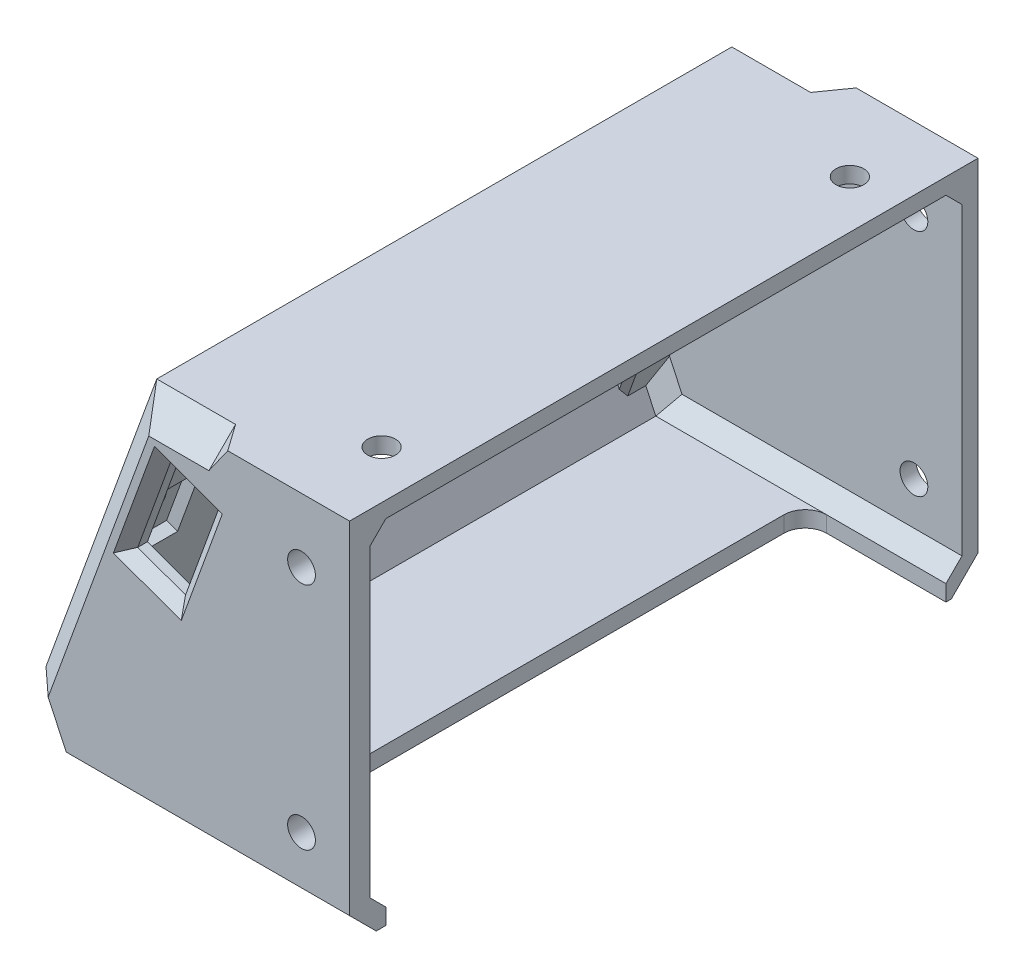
ISO-10303-21;
HEADER;
FILE_DESCRIPTION(('STEP AP214'),'2;1');
FILE_NAME('part.step','',(''),(''),'','','');
FILE_SCHEMA(('AUTOMOTIVE_DESIGN { 1 0 10303 214 1 1 1 1 }'));
ENDSEC;
DATA;
#1=APPLICATION_CONTEXT('core data for automotive mechanical design processes');
#2=APPLICATION_PROTOCOL_DEFINITION('international standard','automotive_design',2000,#1);
#3=PRODUCT_CONTEXT('',#1,'mechanical');
#4=PRODUCT('Part','Part','',(#3));
#5=PRODUCT_RELATED_PRODUCT_CATEGORY('part','',(#4));
#6=PRODUCT_DEFINITION_FORMATION('','',#4);
#7=PRODUCT_DEFINITION_CONTEXT('part definition',#1,'design');
#8=PRODUCT_DEFINITION('design','',#6,#7);
#9=PRODUCT_DEFINITION_SHAPE('','',#8);
#10=(LENGTH_UNIT() NAMED_UNIT(*) SI_UNIT(.MILLI.,.METRE.));
#11=(NAMED_UNIT(*) PLANE_ANGLE_UNIT() SI_UNIT($,.RADIAN.));
#12=(NAMED_UNIT(*) SI_UNIT($,.STERADIAN.) SOLID_ANGLE_UNIT());
#13=UNCERTAINTY_MEASURE_WITH_UNIT(LENGTH_MEASURE(1.E-05),#10,'distance_accuracy_value','');
#14=(GEOMETRIC_REPRESENTATION_CONTEXT(3) GLOBAL_UNCERTAINTY_ASSIGNED_CONTEXT((#13)) GLOBAL_UNIT_ASSIGNED_CONTEXT((#10,
#11,#12)) REPRESENTATION_CONTEXT('',''));
#15=CARTESIAN_POINT('',(0.,0.,0.));
#16=DIRECTION('',(0.,0.,1.));
#17=DIRECTION('',(1.,0.,0.));
#18=AXIS2_PLACEMENT_3D('',#15,#16,#17);
#19=CARTESIAN_POINT('',(-19.2728704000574,54.4959620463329,-12.87));
#20=DIRECTION('',(0.939692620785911,-0.342020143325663,0.));
#21=DIRECTION('',(0.342020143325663,0.939692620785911,0.));
#22=AXIS2_PLACEMENT_3D('',#19,#20,#21);
#23=CYLINDRICAL_SURFACE('',#22,5.);
#24=CARTESIAN_POINT('',(-19.2728704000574,54.4959620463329,-12.87));
#25=DIRECTION('',(0.939692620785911,-0.342020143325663,0.));
#26=DIRECTION('',(0.342020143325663,0.939692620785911,0.));
#27=AXIS2_PLACEMENT_3D('',#24,#25,#26);
#28=CIRCLE('',#27,5.);
#29=CARTESIAN_POINT('',(-18.0507117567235,57.853815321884,-9.3726939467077));
#30=VERTEX_POINT('',#29);
#31=CARTESIAN_POINT('',(-18.9308502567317,55.4356546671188,-7.97102051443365));
#32=VERTEX_POINT('',#31);
#33=EDGE_CURVE('E296',#30,#32,#28,.T.);
#34=ORIENTED_EDGE('',*,*,#33,.F.);
#35=DIRECTION('',(0.93969262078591,-0.342020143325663,0.));
#36=VECTOR('',#35,1.);
#37=CARTESIAN_POINT('',(-27.6802815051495,61.3586920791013,-9.3726939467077));
#38=LINE('',#37,#36);
#39=CARTESIAN_POINT('',(-17.1110191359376,57.5117951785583,-9.3726939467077));
#40=VERTEX_POINT('',#39);
#41=EDGE_CURVE('E284',#30,#40,#38,.T.);
#42=ORIENTED_EDGE('',*,*,#41,.T.);
#43=CARTESIAN_POINT('',(-18.3331777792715,54.1539419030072,-12.87));
#44=DIRECTION('',(0.939692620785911,-0.342020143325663,0.));
#45=DIRECTION('',(0.342020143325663,0.939692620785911,0.));
#46=AXIS2_PLACEMENT_3D('',#43,#44,#45);
#47=CIRCLE('',#46,5.);
#48=CARTESIAN_POINT('',(-17.9911576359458,55.0936345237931,-7.97102051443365));
#49=VERTEX_POINT('',#48);
#50=EDGE_CURVE('E295',#40,#49,#47,.T.);
#51=ORIENTED_EDGE('',*,*,#50,.T.);
#52=DIRECTION('',(0.939692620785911,-0.342020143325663,0.));
#53=VECTOR('',#52,1.);
#54=CARTESIAN_POINT('',(-18.9308502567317,55.4356546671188,-7.97102051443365));
#55=LINE('',#54,#53);
#56=EDGE_CURVE('E238',#49,#32,#55,.F.);
#57=ORIENTED_EDGE('',*,*,#56,.T.);
#58=EDGE_LOOP('',(#34,#42,#51,#57));
#59=FACE_BOUND('',#58,.T.);
#60=ADVANCED_FACE('F37',(#59),#23,.F.);
#61=CARTESIAN_POINT('',(-16.794087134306,58.3825586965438,-15.0494494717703));
#62=VERTEX_POINT('',#61);
#63=CARTESIAN_POINT('',(-16.794087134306,58.3825586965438,-10.6905505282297));
#64=VERTEX_POINT('',#63);
#65=EDGE_CURVE('E290',#62,#64,#47,.T.);
#66=ORIENTED_EDGE('',*,*,#65,.T.);
#67=DIRECTION('',(0.939692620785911,-0.342020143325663,0.));
#68=VECTOR('',#67,1.);
#69=CARTESIAN_POINT('',(-17.7337797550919,58.7245788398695,-10.6905505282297));
#70=LINE('',#69,#68);
#71=CARTESIAN_POINT('',(-17.7337797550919,58.7245788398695,-10.6905505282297));
#72=VERTEX_POINT('',#71);
#73=EDGE_CURVE('E278',#64,#72,#70,.F.);
#74=ORIENTED_EDGE('',*,*,#73,.T.);
#75=CARTESIAN_POINT('',(-17.7337797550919,58.7245788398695,-15.0494494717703));
#76=VERTEX_POINT('',#75);
#77=EDGE_CURVE('E291',#76,#72,#28,.T.);
#78=ORIENTED_EDGE('',*,*,#77,.F.);
#79=DIRECTION('',(0.939692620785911,-0.342020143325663,0.));
#80=VECTOR('',#79,1.);
#81=CARTESIAN_POINT('',(-17.7337797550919,58.7245788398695,-15.0494494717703));
#82=LINE('',#81,#80);
#83=EDGE_CURVE('E275',#76,#62,#82,.T.);
#84=ORIENTED_EDGE('',*,*,#83,.T.);
#85=EDGE_LOOP('',(#66,#74,#78,#84));
#86=FACE_BOUND('',#85,.T.);
#87=ADVANCED_FACE('F896',(#86),#23,.F.);
#88=CARTESIAN_POINT('',(-20.4950290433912,51.1381087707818,-16.3673060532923));
#89=VERTEX_POINT('',#88);
#90=CARTESIAN_POINT('',(-19.614890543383,53.556269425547,-17.7689794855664));
#91=VERTEX_POINT('',#90);
#92=EDGE_CURVE('E1974',#89,#91,#28,.T.);
#93=ORIENTED_EDGE('',*,*,#92,.F.);
#94=DIRECTION('',(0.93969262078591,-0.342020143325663,0.));
#95=VECTOR('',#94,1.);
#96=CARTESIAN_POINT('',(-30.1245987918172,54.642985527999,-16.3673060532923));
#97=LINE('',#96,#95);
#98=CARTESIAN_POINT('',(-19.5553364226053,50.7960886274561,-16.3673060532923));
#99=VERTEX_POINT('',#98);
#100=EDGE_CURVE('E253',#89,#99,#97,.T.);
#101=ORIENTED_EDGE('',*,*,#100,.T.);
#102=CARTESIAN_POINT('',(-18.6751979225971,53.2142492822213,-17.7689794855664));
#103=VERTEX_POINT('',#102);
#104=EDGE_CURVE('E949',#99,#103,#47,.T.);
#105=ORIENTED_EDGE('',*,*,#104,.T.);
#106=DIRECTION('',(0.939692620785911,-0.342020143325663,0.));
#107=VECTOR('',#106,1.);
#108=CARTESIAN_POINT('',(-19.614890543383,53.556269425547,-17.7689794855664));
#109=LINE('',#108,#107);
#110=EDGE_CURVE('E229',#103,#91,#109,.F.);
#111=ORIENTED_EDGE('',*,*,#110,.T.);
#112=EDGE_LOOP('',(#93,#101,#105,#111));
#113=FACE_BOUND('',#112,.T.);
#114=ADVANCED_FACE('F903',(#113),#23,.F.);
#115=CARTESIAN_POINT('',(-18.6751979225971,53.2142492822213,-7.97102051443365));
#116=VERTEX_POINT('',#115);
#117=CARTESIAN_POINT('',(-19.5553364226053,50.7960886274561,-9.3726939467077));
#118=VERTEX_POINT('',#117);
#119=EDGE_CURVE('E955',#116,#118,#47,.T.);
#120=ORIENTED_EDGE('',*,*,#119,.T.);
#121=DIRECTION('',(0.93969262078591,-0.342020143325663,0.));
#122=VECTOR('',#121,1.);
#123=CARTESIAN_POINT('',(-30.1245987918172,54.642985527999,-9.3726939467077));
#124=LINE('',#123,#122);
#125=CARTESIAN_POINT('',(-20.4950290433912,51.1381087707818,-9.3726939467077));
#126=VERTEX_POINT('',#125);
#127=EDGE_CURVE('E262',#118,#126,#124,.F.);
#128=ORIENTED_EDGE('',*,*,#127,.T.);
#129=CARTESIAN_POINT('',(-19.614890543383,53.556269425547,-7.97102051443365));
#130=VERTEX_POINT('',#129);
#131=EDGE_CURVE('E1982',#130,#126,#28,.T.);
#132=ORIENTED_EDGE('',*,*,#131,.F.);
#133=DIRECTION('',(0.939692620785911,-0.342020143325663,0.));
#134=VECTOR('',#133,1.);
#135=CARTESIAN_POINT('',(-19.614890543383,53.556269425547,-7.97102051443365));
#136=LINE('',#135,#134);
#137=EDGE_CURVE('E218',#130,#116,#136,.T.);
#138=ORIENTED_EDGE('',*,*,#137,.T.);
#139=EDGE_LOOP('',(#120,#128,#132,#138));
#140=FACE_BOUND('',#139,.T.);
#141=ADVANCED_FACE('F926',(#140),#23,.F.);
#142=CARTESIAN_POINT('',(-17.9911576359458,55.0936345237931,-17.7689794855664));
#143=VERTEX_POINT('',#142);
#144=CARTESIAN_POINT('',(-17.1110191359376,57.5117951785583,-16.3673060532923));
#145=VERTEX_POINT('',#144);
#146=EDGE_CURVE('E299',#143,#145,#47,.T.);
#147=ORIENTED_EDGE('',*,*,#146,.T.);
#148=DIRECTION('',(0.93969262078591,-0.342020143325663,0.));
#149=VECTOR('',#148,1.);
#150=CARTESIAN_POINT('',(-27.6802815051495,61.3586920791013,-16.3673060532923));
#151=LINE('',#150,#149);
#152=CARTESIAN_POINT('',(-18.0507117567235,57.853815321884,-16.3673060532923));
#153=VERTEX_POINT('',#152);
#154=EDGE_CURVE('E270',#145,#153,#151,.F.);
#155=ORIENTED_EDGE('',*,*,#154,.T.);
#156=CARTESIAN_POINT('',(-18.9308502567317,55.4356546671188,-17.7689794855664));
#157=VERTEX_POINT('',#156);
#158=EDGE_CURVE('E294',#157,#153,#28,.T.);
#159=ORIENTED_EDGE('',*,*,#158,.F.);
#160=DIRECTION('',(0.939692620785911,-0.342020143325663,0.));
#161=VECTOR('',#160,1.);
#162=CARTESIAN_POINT('',(-18.9308502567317,55.4356546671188,-17.7689794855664));
#163=LINE('',#162,#161);
#164=EDGE_CURVE('E235',#157,#143,#163,.T.);
#165=ORIENTED_EDGE('',*,*,#164,.T.);
#166=EDGE_LOOP('',(#147,#155,#159,#165));
#167=FACE_BOUND('',#166,.T.);
#168=ADVANCED_FACE('F912',(#167),#23,.F.);
#169=CARTESIAN_POINT('',(-19.2728704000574,54.4959620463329,-12.87));
#170=DIRECTION('',(0.939692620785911,-0.342020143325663,0.));
#171=DIRECTION('',(0.342020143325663,0.939692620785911,0.));
#172=AXIS2_PLACEMENT_3D('',#169,#170,#171);
#173=PLANE('',#172);
#174=DIRECTION('',(0.,0.,1.));
#175=VECTOR('',#174,1.);
#176=CARTESIAN_POINT('',(-17.7337797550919,58.7245788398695,-12.87));
#177=LINE('',#176,#175);
#178=EDGE_CURVE('E1359',#76,#72,#177,.T.);
#179=ORIENTED_EDGE('',*,*,#178,.F.);
#180=ORIENTED_EDGE('',*,*,#77,.T.);
#181=EDGE_LOOP('',(#179,#180));
#182=FACE_BOUND('',#181,.T.);
#183=ADVANCED_FACE('F919',(#182),#173,.T.);
#184=CARTESIAN_POINT('',(-20.4699409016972,51.2070378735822,-10.37));
#185=DIRECTION('',(0.939692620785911,-0.342020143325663,0.));
#186=DIRECTION('',(0.342020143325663,0.939692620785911,0.));
#187=AXIS2_PLACEMENT_3D('',#184,#185,#186);
#188=CIRCLE('',#187,1.);
#189=CARTESIAN_POINT('',(-20.1279207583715,52.1467304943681,-10.37));
#190=VERTEX_POINT('',#189);
#191=EDGE_CURVE('E1379',#190,#126,#188,.T.);
#192=ORIENTED_EDGE('',*,*,#191,.F.);
#193=DIRECTION('',(0.,0.,1.));
#194=VECTOR('',#193,1.);
#195=CARTESIAN_POINT('',(-20.1279207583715,52.1467304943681,-12.87));
#196=LINE('',#195,#194);
#197=CARTESIAN_POINT('',(-20.1279207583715,52.1467304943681,-15.37));
#198=VERTEX_POINT('',#197);
#199=EDGE_CURVE('E1382',#198,#190,#196,.T.);
#200=ORIENTED_EDGE('',*,*,#199,.F.);
#201=CARTESIAN_POINT('',(-20.4699409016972,51.2070378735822,-15.37));
#202=DIRECTION('',(0.939692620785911,-0.342020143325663,0.));
#203=DIRECTION('',(0.342020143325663,0.939692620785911,0.));
#204=AXIS2_PLACEMENT_3D('',#201,#202,#203);
#205=CIRCLE('',#204,1.);
#206=EDGE_CURVE('E1385',#89,#198,#205,.T.);
#207=ORIENTED_EDGE('',*,*,#206,.F.);
#208=ORIENTED_EDGE('',*,*,#92,.T.);
#209=DIRECTION('',(0.,0.,-1.));
#210=VECTOR('',#209,1.);
#211=CARTESIAN_POINT('',(-19.614890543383,53.556269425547,-12.87));
#212=LINE('',#211,#210);
#213=EDGE_CURVE('E1394',#130,#91,#212,.T.);
#214=ORIENTED_EDGE('',*,*,#213,.F.);
#215=ORIENTED_EDGE('',*,*,#131,.T.);
#216=EDGE_LOOP('',(#192,#200,#207,#208,#214,#215));
#217=FACE_BOUND('',#216,.T.);
#218=ADVANCED_FACE('F932',(#217),#173,.T.);
#219=CARTESIAN_POINT('',(-18.0757998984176,57.7848862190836,-10.37));
#220=DIRECTION('',(0.939692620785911,-0.342020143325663,0.));
#221=DIRECTION('',(0.342020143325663,0.939692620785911,0.));
#222=AXIS2_PLACEMENT_3D('',#219,#220,#221);
#223=CIRCLE('',#222,1.);
#224=CARTESIAN_POINT('',(-18.4178200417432,56.8451935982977,-10.37));
#225=VERTEX_POINT('',#224);
#226=EDGE_CURVE('E1371',#30,#225,#223,.T.);
#227=ORIENTED_EDGE('',*,*,#226,.F.);
#228=ORIENTED_EDGE('',*,*,#33,.T.);
#229=DIRECTION('',(0.,0.,1.));
#230=VECTOR('',#229,1.);
#231=CARTESIAN_POINT('',(-18.9308502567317,55.4356546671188,-12.87));
#232=LINE('',#231,#230);
#233=EDGE_CURVE('E1391',#157,#32,#232,.T.);
#234=ORIENTED_EDGE('',*,*,#233,.F.);
#235=ORIENTED_EDGE('',*,*,#158,.T.);
#236=CARTESIAN_POINT('',(-18.0757998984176,57.7848862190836,-15.37));
#237=DIRECTION('',(0.939692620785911,-0.342020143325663,0.));
#238=DIRECTION('',(0.342020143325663,0.939692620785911,0.));
#239=AXIS2_PLACEMENT_3D('',#236,#237,#238);
#240=CIRCLE('',#239,1.);
#241=CARTESIAN_POINT('',(-18.4178200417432,56.8451935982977,-15.37));
#242=VERTEX_POINT('',#241);
#243=EDGE_CURVE('E1374',#242,#153,#240,.T.);
#244=ORIENTED_EDGE('',*,*,#243,.F.);
#245=DIRECTION('',(0.,0.,-1.));
#246=VECTOR('',#245,1.);
#247=CARTESIAN_POINT('',(-18.4178200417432,56.8451935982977,-12.87));
#248=LINE('',#247,#246);
#249=EDGE_CURVE('E1377',#225,#242,#248,.T.);
#250=ORIENTED_EDGE('',*,*,#249,.F.);
#251=EDGE_LOOP('',(#227,#228,#234,#235,#244,#250));
#252=FACE_BOUND('',#251,.T.);
#253=ADVANCED_FACE('F920',(#252),#173,.T.);
#254=CARTESIAN_POINT('',(0.,65.,0.));
#255=DIRECTION('',(0.,-0.707106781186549,-0.707106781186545));
#256=DIRECTION('',(-1.,0.,0.));
#257=AXIS2_PLACEMENT_3D('',#254,#255,#256);
#258=PLANE('',#257);
#259=DIRECTION('',(-1.,0.,0.));
#260=VECTOR('',#259,1.);
#261=CARTESIAN_POINT('',(0.,65.,0.));
#262=LINE('',#261,#260);
#263=CARTESIAN_POINT('',(-1.00000000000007,65.,0.));
#264=VERTEX_POINT('',#263);
#265=CARTESIAN_POINT('',(-12.2571799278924,65.,0.));
#266=VERTEX_POINT('',#265);
#267=EDGE_CURVE('E1528',#264,#266,#262,.T.);
#268=ORIENTED_EDGE('',*,*,#267,.F.);
#269=DIRECTION('',(0.,-0.707106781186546,0.707106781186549));
#270=VECTOR('',#269,1.);
#271=CARTESIAN_POINT('',(-1.00000000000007,70.,-5.00000000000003));
#272=LINE('',#271,#270);
#273=CARTESIAN_POINT('',(-1.00000000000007,70.,-5.00000000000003));
#274=VERTEX_POINT('',#273);
#275=EDGE_CURVE('E1434',#264,#274,#272,.F.);
#276=ORIENTED_EDGE('',*,*,#275,.T.);
#277=DIRECTION('',(1.,0.,0.));
#278=VECTOR('',#277,1.);
#279=CARTESIAN_POINT('',(0.,70.,-5.00000000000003));
#280=LINE('',#279,#278);
#281=CARTESIAN_POINT('',(-15.758217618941,70.,-5.00000000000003));
#282=VERTEX_POINT('',#281);
#283=EDGE_CURVE('E1552',#282,#274,#280,.T.);
#284=ORIENTED_EDGE('',*,*,#283,.F.);
#285=DIRECTION('',(-0.44371260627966,0.63368727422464,-0.633687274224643));
#286=VECTOR('',#285,1.);
#287=CARTESIAN_POINT('',(-1.05705644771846,49.0045659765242,15.9954340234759));
#288=LINE('',#287,#286);
#289=EDGE_CURVE('E1446',#282,#266,#288,.F.);
#290=ORIENTED_EDGE('',*,*,#289,.T.);
#291=EDGE_LOOP('',(#268,#276,#284,#290));
#292=FACE_BOUND('',#291,.T.);
#293=ADVANCED_FACE('F1685',(#292),#258,.F.);
#294=CARTESIAN_POINT('',(0.,65.,-117.7));
#295=DIRECTION('',(0.,0.707106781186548,-0.707106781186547));
#296=DIRECTION('',(-1.,0.,0.));
#297=AXIS2_PLACEMENT_3D('',#294,#295,#296);
#298=PLANE('',#297);
#299=DIRECTION('',(-1.,0.,0.));
#300=VECTOR('',#299,1.);
#301=CARTESIAN_POINT('',(-15.758217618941,70.,-112.7));
#302=LINE('',#301,#300);
#303=CARTESIAN_POINT('',(-1.00000000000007,70.,-112.7));
#304=VERTEX_POINT('',#303);
#305=CARTESIAN_POINT('',(-15.758217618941,70.,-112.7));
#306=VERTEX_POINT('',#305);
#307=EDGE_CURVE('E1550',#304,#306,#302,.T.);
#308=ORIENTED_EDGE('',*,*,#307,.F.);
#309=DIRECTION('',(0.,-0.707106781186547,-0.707106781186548));
#310=VECTOR('',#309,1.);
#311=CARTESIAN_POINT('',(-1.00000000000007,65.,-117.7));
#312=LINE('',#311,#310);
#313=CARTESIAN_POINT('',(-1.00000000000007,65.,-117.7));
#314=VERTEX_POINT('',#313);
#315=EDGE_CURVE('E1437',#304,#314,#312,.T.);
#316=ORIENTED_EDGE('',*,*,#315,.T.);
#317=DIRECTION('',(1.,0.,0.));
#318=VECTOR('',#317,1.);
#319=CARTESIAN_POINT('',(19.,65.,-117.7));
#320=LINE('',#319,#318);
#321=CARTESIAN_POINT('',(-12.2571799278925,65.,-117.7));
#322=VERTEX_POINT('',#321);
#323=EDGE_CURVE('E1555',#322,#314,#320,.T.);
#324=ORIENTED_EDGE('',*,*,#323,.F.);
#325=DIRECTION('',(0.443712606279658,-0.633687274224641,-0.633687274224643));
#326=VECTOR('',#325,1.);
#327=CARTESIAN_POINT('',(-1.0570564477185,49.0045659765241,-133.695434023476));
#328=LINE('',#327,#326);
#329=EDGE_CURVE('E1513',#322,#306,#328,.F.);
#330=ORIENTED_EDGE('',*,*,#329,.T.);
#331=EDGE_LOOP('',(#308,#316,#324,#330));
#332=FACE_BOUND('',#331,.T.);
#333=ADVANCED_FACE('F807',(#332),#298,.T.);
#334=CARTESIAN_POINT('',(-33.2604349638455,13.1416398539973,-125.480448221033));
#335=DIRECTION('',(-0.906307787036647,-0.422618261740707,0.));
#336=DIRECTION('',(0.422618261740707,-0.906307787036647,0.));
#337=AXIS2_PLACEMENT_3D('',#334,#335,#336);
#338=PLANE('',#337);
#339=DIRECTION('',(0.,0.,1.));
#340=VECTOR('',#339,1.);
#341=CARTESIAN_POINT('',(-30.8697450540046,8.01478879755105,-11.07));
#342=LINE('',#341,#340);
#343=CARTESIAN_POINT('',(-30.8697450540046,8.01478879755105,-10.0699999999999));
#344=VERTEX_POINT('',#343);
#345=CARTESIAN_POINT('',(-30.8697450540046,8.01478879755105,-6.80000000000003));
#346=VERTEX_POINT('',#345);
#347=EDGE_CURVE('E369',#344,#346,#342,.T.);
#348=ORIENTED_EDGE('',*,*,#347,.T.);
#349=DIRECTION('',(0.422618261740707,-0.906307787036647,0.));
#350=VECTOR('',#349,1.);
#351=CARTESIAN_POINT('',(-28.9976182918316,3.99999999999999,-6.80000000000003));
#352=LINE('',#351,#350);
#353=CARTESIAN_POINT('',(-28.9976182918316,3.99999999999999,-6.80000000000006));
#354=VERTEX_POINT('',#353);
#355=EDGE_CURVE('E1493',#346,#354,#352,.T.);
#356=ORIENTED_EDGE('',*,*,#355,.T.);
#357=DIRECTION('',(0.,0.,1.));
#358=VECTOR('',#357,1.);
#359=CARTESIAN_POINT('',(-28.9976182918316,3.99999999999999,-125.480448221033));
#360=LINE('',#359,#358);
#361=CARTESIAN_POINT('',(-28.9976182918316,3.99999999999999,-111.7));
#362=VERTEX_POINT('',#361);
#363=EDGE_CURVE('E506',#362,#354,#360,.T.);
#364=ORIENTED_EDGE('',*,*,#363,.F.);
#365=DIRECTION('',(-0.422618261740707,0.906307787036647,0.));
#366=VECTOR('',#365,1.);
#367=CARTESIAN_POINT('',(-33.2604349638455,13.1416398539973,-111.7));
#368=LINE('',#367,#366);
#369=CARTESIAN_POINT('',(-30.8697450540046,8.01478879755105,-111.7));
#370=VERTEX_POINT('',#369);
#371=EDGE_CURVE('E1495',#362,#370,#368,.T.);
#372=ORIENTED_EDGE('',*,*,#371,.T.);
#373=DIRECTION('',(0.,0.,1.));
#374=VECTOR('',#373,1.);
#375=CARTESIAN_POINT('',(-30.8697450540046,8.01478879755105,-114.7));
#376=LINE('',#375,#374);
#377=CARTESIAN_POINT('',(-30.8697450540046,8.01478879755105,-108.33));
#378=VERTEX_POINT('',#377);
#379=EDGE_CURVE('E370',#370,#378,#376,.T.);
#380=ORIENTED_EDGE('',*,*,#379,.T.);
#381=DIRECTION('',(-0.345066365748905,0.739997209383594,0.577350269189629));
#382=VECTOR('',#381,1.);
#383=CARTESIAN_POINT('',(-29.0467547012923,4.10537337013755,-111.380149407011));
#384=LINE('',#383,#382);
#385=CARTESIAN_POINT('',(-31.4674175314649,9.29650156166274,-107.33));
#386=VERTEX_POINT('',#385);
#387=EDGE_CURVE('E633',#378,#386,#384,.T.);
#388=ORIENTED_EDGE('',*,*,#387,.T.);
#389=DIRECTION('',(-0.422618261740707,0.906307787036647,0.));
#390=VECTOR('',#389,1.);
#391=CARTESIAN_POINT('',(-28.8953003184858,3.78057839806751,-107.33));
#392=LINE('',#391,#390);
#393=CARTESIAN_POINT('',(-33.2604349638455,13.1416398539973,-107.33));
#394=VERTEX_POINT('',#393);
#395=EDGE_CURVE('E366',#386,#394,#392,.T.);
#396=ORIENTED_EDGE('',*,*,#395,.T.);
#397=DIRECTION('',(0.,0.,1.));
#398=VECTOR('',#397,1.);
#399=CARTESIAN_POINT('',(-33.2604349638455,13.1416398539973,-125.480448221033));
#400=LINE('',#399,#398);
#401=CARTESIAN_POINT('',(-33.2604349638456,13.1416398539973,-11.07));
#402=VERTEX_POINT('',#401);
#403=EDGE_CURVE('E508',#394,#402,#400,.T.);
#404=ORIENTED_EDGE('',*,*,#403,.T.);
#405=DIRECTION('',(0.422618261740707,-0.906307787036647,0.));
#406=VECTOR('',#405,1.);
#407=CARTESIAN_POINT('',(-30.0906452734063,6.34400392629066,-11.07));
#408=LINE('',#407,#406);
#409=CARTESIAN_POINT('',(-31.4674175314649,9.2965015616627,-11.07));
#410=VERTEX_POINT('',#409);
#411=EDGE_CURVE('E374',#402,#410,#408,.T.);
#412=ORIENTED_EDGE('',*,*,#411,.T.);
#413=DIRECTION('',(0.345066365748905,-0.739997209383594,0.577350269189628));
#414=VECTOR('',#413,1.);
#415=CARTESIAN_POINT('',(-55.4560878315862,60.7403710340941,-51.206816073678));
#416=LINE('',#415,#414);
#417=EDGE_CURVE('E636',#410,#344,#416,.T.);
#418=ORIENTED_EDGE('',*,*,#417,.T.);
#419=EDGE_LOOP('',(#348,#356,#364,#372,#380,#388,#396,#404,#412,#418));
#420=FACE_BOUND('',#419,.T.);
#421=ADVANCED_FACE('F803',(#420),#338,.F.);
#422=CARTESIAN_POINT('',(0.,0.,-114.7));
#423=DIRECTION('',(0.,0.,1.));
#424=DIRECTION('',(0.,-1.,0.));
#425=AXIS2_PLACEMENT_3D('',#422,#423,#424);
#426=PLANE('',#425);
#427=CARTESIAN_POINT('',(16.35,58.,-114.7));
#428=DIRECTION('',(0.,0.,1.));
#429=DIRECTION('',(0.,-1.,0.));
#430=AXIS2_PLACEMENT_3D('',#427,#428,#429);
#431=CIRCLE('',#430,2.6);
#432=CARTESIAN_POINT('',(16.35,55.4,-114.7));
#433=VERTEX_POINT('',#432);
#434=EDGE_CURVE('E2381',#433,#433,#431,.T.);
#435=ORIENTED_EDGE('',*,*,#434,.F.);
#436=EDGE_LOOP('',(#435));
#437=FACE_BOUND('',#436,.T.);
#438=CARTESIAN_POINT('',(16.35,15.,-114.7));
#439=DIRECTION('',(0.,0.,1.));
#440=DIRECTION('',(0.,-1.,0.));
#441=AXIS2_PLACEMENT_3D('',#438,#439,#440);
#442=CIRCLE('',#441,2.6);
#443=CARTESIAN_POINT('',(16.35,12.4,-114.7));
#444=VERTEX_POINT('',#443);
#445=EDGE_CURVE('E2375',#444,#444,#442,.T.);
#446=ORIENTED_EDGE('',*,*,#445,.F.);
#447=EDGE_LOOP('',(#446));
#448=FACE_BOUND('',#447,.T.);
#449=DIRECTION('',(-0.939692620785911,0.342020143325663,0.));
#450=VECTOR('',#449,1.);
#451=CARTESIAN_POINT('',(-18.4717731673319,24.5351102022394,-114.7));
#452=LINE('',#451,#450);
#453=CARTESIAN_POINT('',(-18.4717731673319,24.5351102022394,-114.7));
#454=VERTEX_POINT('',#453);
#455=CARTESIAN_POINT('',(-22.8883284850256,26.14260487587,-114.7));
#456=VERTEX_POINT('',#455);
#457=EDGE_CURVE('E332',#454,#456,#452,.T.);
#458=ORIENTED_EDGE('',*,*,#457,.T.);
#459=DIRECTION('',(0.342020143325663,0.939692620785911,0.));
#460=VECTOR('',#459,1.);
#461=CARTESIAN_POINT('',(-13.3938493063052,52.2284720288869,-114.7));
#462=LINE('',#461,#460);
#463=CARTESIAN_POINT('',(-13.3938493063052,52.2284720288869,-114.7));
#464=VERTEX_POINT('',#463);
#465=EDGE_CURVE('E346',#456,#464,#462,.T.);
#466=ORIENTED_EDGE('',*,*,#465,.T.);
#467=DIRECTION('',(0.939692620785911,-0.342020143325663,0.));
#468=VECTOR('',#467,1.);
#469=CARTESIAN_POINT('',(-8.97729398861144,50.6209773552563,-114.7));
#470=LINE('',#469,#468);
#471=CARTESIAN_POINT('',(-8.97729398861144,50.6209773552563,-114.7));
#472=VERTEX_POINT('',#471);
#473=EDGE_CURVE('E342',#464,#472,#470,.T.);
#474=ORIENTED_EDGE('',*,*,#473,.T.);
#475=DIRECTION('',(-0.342020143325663,-0.939692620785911,0.));
#476=VECTOR('',#475,1.);
#477=CARTESIAN_POINT('',(-8.97729398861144,50.6209773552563,-114.7));
#478=LINE('',#477,#476);
#479=EDGE_CURVE('E337',#472,#454,#478,.T.);
#480=ORIENTED_EDGE('',*,*,#479,.T.);
#481=EDGE_LOOP('',(#458,#466,#474,#480));
#482=FACE_BOUND('',#481,.T.);
#483=DIRECTION('',(-0.906307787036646,-0.422618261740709,0.));
#484=VECTOR('',#483,1.);
#485=CARTESIAN_POINT('',(-12.0913410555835,59.6080297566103,-114.7));
#486=LINE('',#485,#484);
#487=CARTESIAN_POINT('',(-12.0913410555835,59.6080297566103,-114.7));
#488=VERTEX_POINT('',#487);
#489=CARTESIAN_POINT('',(-13.3730538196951,59.01035727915,-114.7));
#490=VERTEX_POINT('',#489);
#491=EDGE_CURVE('E645',#488,#490,#486,.T.);
#492=ORIENTED_EDGE('',*,*,#491,.T.);
#493=DIRECTION('',(-0.342020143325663,-0.939692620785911,0.));
#494=VECTOR('',#493,1.);
#495=CARTESIAN_POINT('',(-30.7742669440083,11.2009171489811,-114.7));
#496=LINE('',#495,#494);
#497=CARTESIAN_POINT('',(-27.7139584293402,19.6090456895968,-114.7));
#498=VERTEX_POINT('',#497);
#499=EDGE_CURVE('E1468',#490,#498,#496,.T.);
#500=ORIENTED_EDGE('',*,*,#499,.T.);
#501=DIRECTION('',(0.422618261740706,-0.906307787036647,0.));
#502=VECTOR('',#501,1.);
#503=CARTESIAN_POINT('',(-27.1162859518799,18.3273329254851,-114.7));
#504=LINE('',#503,#502);
#505=CARTESIAN_POINT('',(-27.1162859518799,18.3273329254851,-114.7));
#506=VERTEX_POINT('',#505);
#507=EDGE_CURVE('E630',#498,#506,#504,.T.);
#508=ORIENTED_EDGE('',*,*,#507,.T.);
#509=DIRECTION('',(0.342020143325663,0.93969262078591,0.));
#510=VECTOR('',#509,1.);
#511=CARTESIAN_POINT('',(-26.7742658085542,19.2670255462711,-114.7));
#512=LINE('',#511,#510);
#513=CARTESIAN_POINT('',(-29.4186764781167,12.0015669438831,-114.7));
#514=VERTEX_POINT('',#513);
#515=EDGE_CURVE('E395',#514,#506,#512,.T.);
#516=ORIENTED_EDGE('',*,*,#515,.F.);
#517=DIRECTION('',(0.422618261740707,-0.906307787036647,0.));
#518=VECTOR('',#517,1.);
#519=CARTESIAN_POINT('',(-19.5674517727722,-9.1244526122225,-114.7));
#520=LINE('',#519,#518);
#521=CARTESIAN_POINT('',(-27.0864075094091,6.99999999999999,-114.7));
#522=VERTEX_POINT('',#521);
#523=EDGE_CURVE('E1470',#514,#522,#520,.T.);
#524=ORIENTED_EDGE('',*,*,#523,.T.);
#525=DIRECTION('',(1.,0.,0.));
#526=VECTOR('',#525,1.);
#527=CARTESIAN_POINT('',(0.,6.99999999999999,-114.7));
#528=LINE('',#527,#526);
#529=CARTESIAN_POINT('',(25.35,6.99999999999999,-114.7));
#530=VERTEX_POINT('',#529);
#531=EDGE_CURVE('E1472',#522,#530,#528,.T.);
#532=ORIENTED_EDGE('',*,*,#531,.T.);
#533=DIRECTION('',(0.,-1.,0.));
#534=VECTOR('',#533,1.);
#535=CARTESIAN_POINT('',(25.35,64.,-114.7));
#536=LINE('',#535,#534);
#537=CARTESIAN_POINT('',(25.35,64.,-114.7));
#538=VERTEX_POINT('',#537);
#539=EDGE_CURVE('E1823',#538,#530,#536,.T.);
#540=ORIENTED_EDGE('',*,*,#539,.F.);
#541=DIRECTION('',(-1.,0.,0.));
#542=VECTOR('',#541,1.);
#543=CARTESIAN_POINT('',(0.,64.,-114.7));
#544=LINE('',#543,#542);
#545=CARTESIAN_POINT('',(-10.4927946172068,64.,-114.7));
#546=VERTEX_POINT('',#545);
#547=EDGE_CURVE('E1475',#538,#546,#544,.T.);
#548=ORIENTED_EDGE('',*,*,#547,.T.);
#549=DIRECTION('',(0.342020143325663,0.93969262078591,0.));
#550=VECTOR('',#549,1.);
#551=CARTESIAN_POINT('',(-9.8988245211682,65.6319194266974,-114.7));
#552=LINE('',#551,#550);
#553=EDGE_CURVE('E455',#488,#546,#552,.T.);
#554=ORIENTED_EDGE('',*,*,#553,.F.);
#555=EDGE_LOOP('',(#492,#500,#508,#516,#524,#532,#540,#548,#554));
#556=FACE_BOUND('',#555,.T.);
#557=ADVANCED_FACE('F806',(#437,#448,#482,#556),#426,.T.);
#558=CARTESIAN_POINT('',(0.,0.,-3.8));
#559=DIRECTION('',(0.,0.,1.));
#560=DIRECTION('',(1.,0.,0.));
#561=AXIS2_PLACEMENT_3D('',#558,#559,#560);
#562=PLANE('',#561);
#563=CARTESIAN_POINT('',(16.35,58.,-3.8));
#564=DIRECTION('',(0.,0.,1.));
#565=DIRECTION('',(1.,0.,0.));
#566=AXIS2_PLACEMENT_3D('',#563,#564,#565);
#567=CIRCLE('',#566,2.6);
#568=CARTESIAN_POINT('',(18.95,58.,-3.8));
#569=VERTEX_POINT('',#568);
#570=EDGE_CURVE('E2378',#569,#569,#567,.T.);
#571=ORIENTED_EDGE('',*,*,#570,.T.);
#572=EDGE_LOOP('',(#571));
#573=FACE_BOUND('',#572,.T.);
#574=CARTESIAN_POINT('',(16.35,15.,-3.8));
#575=DIRECTION('',(0.,0.,1.));
#576=DIRECTION('',(1.,0.,0.));
#577=AXIS2_PLACEMENT_3D('',#574,#575,#576);
#578=CIRCLE('',#577,2.6);
#579=CARTESIAN_POINT('',(18.95,15.,-3.8));
#580=VERTEX_POINT('',#579);
#581=EDGE_CURVE('E2364',#580,#580,#578,.T.);
#582=ORIENTED_EDGE('',*,*,#581,.T.);
#583=EDGE_LOOP('',(#582));
#584=FACE_BOUND('',#583,.T.);
#585=DIRECTION('',(0.939692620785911,-0.342020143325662,0.));
#586=VECTOR('',#585,1.);
#587=CARTESIAN_POINT('',(-9.98912505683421,61.2904945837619,-3.8));
#588=LINE('',#587,#586);
#589=CARTESIAN_POINT('',(-9.98912505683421,61.2904945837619,-3.8));
#590=VERTEX_POINT('',#589);
#591=CARTESIAN_POINT('',(-1.04325130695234,58.0344628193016,-3.8));
#592=VERTEX_POINT('',#591);
#593=EDGE_CURVE('E303',#590,#592,#588,.T.);
#594=ORIENTED_EDGE('',*,*,#593,.F.);
#595=DIRECTION('',(0.342020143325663,0.939692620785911,0.));
#596=VECTOR('',#595,1.);
#597=CARTESIAN_POINT('',(-9.98912505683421,61.2904945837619,-3.8));
#598=LINE('',#597,#596);
#599=CARTESIAN_POINT('',(-16.316497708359,43.9061810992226,-3.8));
#600=VERTEX_POINT('',#599);
#601=EDGE_CURVE('E307',#600,#590,#598,.T.);
#602=ORIENTED_EDGE('',*,*,#601,.F.);
#603=DIRECTION('',(-0.93969262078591,0.342020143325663,0.));
#604=VECTOR('',#603,1.);
#605=CARTESIAN_POINT('',(-16.316497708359,43.9061810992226,-3.8));
#606=LINE('',#605,#604);
#607=CARTESIAN_POINT('',(-7.3706239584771,40.6501493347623,-3.8));
#608=VERTEX_POINT('',#607);
#609=EDGE_CURVE('E310',#608,#600,#606,.T.);
#610=ORIENTED_EDGE('',*,*,#609,.F.);
#611=DIRECTION('',(-0.342020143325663,-0.939692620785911,0.));
#612=VECTOR('',#611,1.);
#613=CARTESIAN_POINT('',(-1.04325130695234,58.0344628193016,-3.8));
#614=LINE('',#613,#612);
#615=EDGE_CURVE('E300',#592,#608,#614,.T.);
#616=ORIENTED_EDGE('',*,*,#615,.F.);
#617=EDGE_LOOP('',(#594,#602,#610,#616));
#618=FACE_BOUND('',#617,.T.);
#619=DIRECTION('',(1.,0.,0.));
#620=VECTOR('',#619,1.);
#621=CARTESIAN_POINT('',(19.,64.,-3.8));
#622=LINE('',#621,#620);
#623=CARTESIAN_POINT('',(-10.4927946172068,64.,-3.8));
#624=VERTEX_POINT('',#623);
#625=CARTESIAN_POINT('',(25.35,64.,-3.8));
#626=VERTEX_POINT('',#625);
#627=EDGE_CURVE('E1504',#624,#626,#622,.T.);
#628=ORIENTED_EDGE('',*,*,#627,.T.);
#629=DIRECTION('',(0.,1.,0.));
#630=VECTOR('',#629,1.);
#631=CARTESIAN_POINT('',(25.35,6.99999999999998,-3.8));
#632=LINE('',#631,#630);
#633=CARTESIAN_POINT('',(25.35,6.99999999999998,-3.8));
#634=VERTEX_POINT('',#633);
#635=EDGE_CURVE('E1793',#634,#626,#632,.T.);
#636=ORIENTED_EDGE('',*,*,#635,.F.);
#637=DIRECTION('',(-1.,0.,0.));
#638=VECTOR('',#637,1.);
#639=CARTESIAN_POINT('',(-28.9976182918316,6.99999999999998,-3.8));
#640=LINE('',#639,#638);
#641=CARTESIAN_POINT('',(-27.0864075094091,6.99999999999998,-3.8));
#642=VERTEX_POINT('',#641);
#643=EDGE_CURVE('E1498',#634,#642,#640,.T.);
#644=ORIENTED_EDGE('',*,*,#643,.T.);
#645=DIRECTION('',(-0.422618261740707,0.906307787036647,0.));
#646=VECTOR('',#645,1.);
#647=CARTESIAN_POINT('',(-28.1508216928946,9.28264358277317,-3.8));
#648=LINE('',#647,#646);
#649=CARTESIAN_POINT('',(-29.4186764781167,12.0015669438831,-3.8));
#650=VERTEX_POINT('',#649);
#651=EDGE_CURVE('E1500',#642,#650,#648,.T.);
#652=ORIENTED_EDGE('',*,*,#651,.T.);
#653=DIRECTION('',(-0.342020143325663,-0.93969262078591,0.));
#654=VECTOR('',#653,1.);
#655=CARTESIAN_POINT('',(-29.5016644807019,11.7735592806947,-3.8));
#656=LINE('',#655,#654);
#657=CARTESIAN_POINT('',(-27.1162859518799,18.3273329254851,-3.8));
#658=VERTEX_POINT('',#657);
#659=EDGE_CURVE('E416',#658,#650,#656,.T.);
#660=ORIENTED_EDGE('',*,*,#659,.F.);
#661=DIRECTION('',(-0.422618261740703,0.906307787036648,0.));
#662=VECTOR('',#661,1.);
#663=CARTESIAN_POINT('',(-15.2533735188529,-7.11276488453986,-3.8));
#664=LINE('',#663,#662);
#665=CARTESIAN_POINT('',(-27.7139584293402,19.6090456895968,-3.8));
#666=VERTEX_POINT('',#665);
#667=EDGE_CURVE('E639',#658,#666,#664,.T.);
#668=ORIENTED_EDGE('',*,*,#667,.T.);
#669=DIRECTION('',(0.342020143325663,0.939692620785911,0.));
#670=VECTOR('',#669,1.);
#671=CARTESIAN_POINT('',(-13.3730538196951,59.01035727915,-3.8));
#672=LINE('',#671,#670);
#673=CARTESIAN_POINT('',(-13.3730538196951,59.01035727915,-3.8));
#674=VERTEX_POINT('',#673);
#675=EDGE_CURVE('E1502',#666,#674,#672,.T.);
#676=ORIENTED_EDGE('',*,*,#675,.T.);
#677=DIRECTION('',(0.906307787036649,0.422618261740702,0.));
#678=VECTOR('',#677,1.);
#679=CARTESIAN_POINT('',(-24.9907884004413,53.5929186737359,-3.8));
#680=LINE('',#679,#678);
#681=CARTESIAN_POINT('',(-12.0913410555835,59.6080297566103,-3.8));
#682=VERTEX_POINT('',#681);
#683=EDGE_CURVE('E648',#674,#682,#680,.T.);
#684=ORIENTED_EDGE('',*,*,#683,.T.);
#685=DIRECTION('',(-0.342020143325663,-0.93969262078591,0.));
#686=VECTOR('',#685,1.);
#687=CARTESIAN_POINT('',(-9.8988245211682,65.6319194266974,-3.8));
#688=LINE('',#687,#686);
#689=EDGE_CURVE('E434',#624,#682,#688,.T.);
#690=ORIENTED_EDGE('',*,*,#689,.F.);
#691=EDGE_LOOP('',(#628,#636,#644,#652,#660,#668,#676,#684,#690));
#692=FACE_BOUND('',#691,.T.);
#693=ADVANCED_FACE('F843',(#573,#584,#618,#692),#562,.F.);
#694=CARTESIAN_POINT('',(19.,67.,-206.054671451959));
#695=DIRECTION('',(0.,1.,0.));
#696=DIRECTION('',(0.,0.,1.));
#697=AXIS2_PLACEMENT_3D('',#694,#695,#696);
#698=PLANE('',#697);
#699=CARTESIAN_POINT('',(16.35,67.,-15.));
#700=DIRECTION('',(0.,1.,0.));
#701=DIRECTION('',(0.,0.,1.));
#702=AXIS2_PLACEMENT_3D('',#699,#700,#701);
#703=CIRCLE('',#702,2.6);
#704=CARTESIAN_POINT('',(16.35,67.,-12.4));
#705=VERTEX_POINT('',#704);
#706=EDGE_CURVE('E2347',#705,#705,#703,.F.);
#707=ORIENTED_EDGE('',*,*,#706,.F.);
#708=EDGE_LOOP('',(#707));
#709=FACE_BOUND('',#708,.T.);
#710=CARTESIAN_POINT('',(16.35,67.,-102.7));
#711=DIRECTION('',(0.,1.,0.));
#712=DIRECTION('',(0.,0.,1.));
#713=AXIS2_PLACEMENT_3D('',#710,#711,#712);
#714=CIRCLE('',#713,2.60000000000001);
#715=CARTESIAN_POINT('',(16.35,67.,-100.1));
#716=VERTEX_POINT('',#715);
#717=EDGE_CURVE('E2356',#716,#716,#714,.F.);
#718=ORIENTED_EDGE('',*,*,#717,.F.);
#719=EDGE_LOOP('',(#718));
#720=FACE_BOUND('',#719,.T.);
#721=DIRECTION('',(0.,0.,-1.));
#722=VECTOR('',#721,1.);
#723=CARTESIAN_POINT('',(-9.4008839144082,67.,-107.33));
#724=LINE('',#723,#722);
#725=CARTESIAN_POINT('',(-9.4008839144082,67.,-108.33));
#726=VERTEX_POINT('',#725);
#727=CARTESIAN_POINT('',(-9.40088391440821,67.,-111.7));
#728=VERTEX_POINT('',#727);
#729=EDGE_CURVE('E383',#726,#728,#724,.T.);
#730=ORIENTED_EDGE('',*,*,#729,.T.);
#731=DIRECTION('',(1.,0.,0.));
#732=VECTOR('',#731,1.);
#733=CARTESIAN_POINT('',(19.,67.,-111.7));
#734=LINE('',#733,#732);
#735=CARTESIAN_POINT('',(25.35,67.,-111.7));
#736=VERTEX_POINT('',#735);
#737=EDGE_CURVE('E1458',#728,#736,#734,.T.);
#738=ORIENTED_EDGE('',*,*,#737,.T.);
#739=DIRECTION('',(0.,0.,-1.));
#740=VECTOR('',#739,1.);
#741=CARTESIAN_POINT('',(25.35,67.,-6.8));
#742=LINE('',#741,#740);
#743=CARTESIAN_POINT('',(25.35,67.,-6.8));
#744=VERTEX_POINT('',#743);
#745=EDGE_CURVE('E140',#744,#736,#742,.T.);
#746=ORIENTED_EDGE('',*,*,#745,.F.);
#747=DIRECTION('',(-1.,0.,0.));
#748=VECTOR('',#747,1.);
#749=CARTESIAN_POINT('',(-9.40088391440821,67.,-6.8));
#750=LINE('',#749,#748);
#751=CARTESIAN_POINT('',(-9.40088391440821,67.,-6.8));
#752=VERTEX_POINT('',#751);
#753=EDGE_CURVE('E1461',#744,#752,#750,.T.);
#754=ORIENTED_EDGE('',*,*,#753,.T.);
#755=DIRECTION('',(0.,0.,-1.));
#756=VECTOR('',#755,1.);
#757=CARTESIAN_POINT('',(-9.40088391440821,67.,-3.80000000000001));
#758=LINE('',#757,#756);
#759=CARTESIAN_POINT('',(-9.4008839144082,67.,-10.07));
#760=VERTEX_POINT('',#759);
#761=EDGE_CURVE('E377',#752,#760,#758,.T.);
#762=ORIENTED_EDGE('',*,*,#761,.T.);
#763=DIRECTION('',(-0.728739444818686,0.,-0.684791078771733));
#764=VECTOR('',#763,1.);
#765=CARTESIAN_POINT('',(-92.1213445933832,67.,-87.801806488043));
#766=LINE('',#765,#764);
#767=CARTESIAN_POINT('',(-10.4650616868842,67.,-11.07));
#768=VERTEX_POINT('',#767);
#769=EDGE_CURVE('E651',#760,#768,#766,.T.);
#770=ORIENTED_EDGE('',*,*,#769,.T.);
#771=DIRECTION('',(-1.,0.,0.));
#772=VECTOR('',#771,1.);
#773=CARTESIAN_POINT('',(-5.11374615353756,67.,-11.07));
#774=LINE('',#773,#772);
#775=CARTESIAN_POINT('',(-13.6575950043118,67.,-11.07));
#776=VERTEX_POINT('',#775);
#777=EDGE_CURVE('E380',#768,#776,#774,.T.);
#778=ORIENTED_EDGE('',*,*,#777,.T.);
#779=DIRECTION('',(0.,0.,1.));
#780=VECTOR('',#779,1.);
#781=CARTESIAN_POINT('',(-13.6575950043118,67.,-206.054671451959));
#782=LINE('',#781,#780);
#783=CARTESIAN_POINT('',(-13.6575950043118,67.,-107.33));
#784=VERTEX_POINT('',#783);
#785=EDGE_CURVE('E543',#784,#776,#782,.T.);
#786=ORIENTED_EDGE('',*,*,#785,.F.);
#787=DIRECTION('',(1.,0.,0.));
#788=VECTOR('',#787,1.);
#789=CARTESIAN_POINT('',(-8.87251663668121,67.,-107.33));
#790=LINE('',#789,#788);
#791=CARTESIAN_POINT('',(-10.4650616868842,67.,-107.33));
#792=VERTEX_POINT('',#791);
#793=EDGE_CURVE('E386',#784,#792,#790,.T.);
#794=ORIENTED_EDGE('',*,*,#793,.T.);
#795=DIRECTION('',(0.72873944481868,0.,-0.684791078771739));
#796=VECTOR('',#795,1.);
#797=CARTESIAN_POINT('',(54.4496830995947,67.,-168.329906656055));
#798=LINE('',#797,#796);
#799=EDGE_CURVE('E642',#792,#726,#798,.T.);
#800=ORIENTED_EDGE('',*,*,#799,.T.);
#801=EDGE_LOOP('',(#730,#738,#746,#754,#762,#770,#778,#786,#794,#800));
#802=FACE_BOUND('',#801,.T.);
#803=ADVANCED_FACE('F851',(#709,#720,#802),#698,.F.);
#804=CARTESIAN_POINT('',(-13.6575950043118,67.,-206.054671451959));
#805=DIRECTION('',(-0.939692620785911,0.342020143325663,0.));
#806=DIRECTION('',(-0.342020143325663,-0.939692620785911,0.));
#807=AXIS2_PLACEMENT_3D('',#804,#805,#806);
#808=PLANE('',#807);
#809=ORIENTED_EDGE('',*,*,#50,.F.);
#810=CARTESIAN_POINT('',(-17.1361072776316,57.4428660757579,-10.37));
#811=DIRECTION('',(0.939692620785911,-0.342020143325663,0.));
#812=DIRECTION('',(0.342020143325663,0.939692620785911,0.));
#813=AXIS2_PLACEMENT_3D('',#810,#811,#812);
#814=CIRCLE('',#813,1.);
#815=CARTESIAN_POINT('',(-16.794087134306,58.3825586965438,-10.37));
#816=VERTEX_POINT('',#815);
#817=EDGE_CURVE('E172',#816,#40,#814,.T.);
#818=ORIENTED_EDGE('',*,*,#817,.F.);
#819=DIRECTION('',(0.,0.,1.));
#820=VECTOR('',#819,1.);
#821=CARTESIAN_POINT('',(-16.794087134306,58.3825586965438,-10.37));
#822=LINE('',#821,#820);
#823=EDGE_CURVE('E186',#64,#816,#822,.T.);
#824=ORIENTED_EDGE('',*,*,#823,.F.);
#825=ORIENTED_EDGE('',*,*,#65,.F.);
#826=CARTESIAN_POINT('',(-16.794087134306,58.3825586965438,-15.37));
#827=VERTEX_POINT('',#826);
#828=EDGE_CURVE('E187',#827,#62,#822,.T.);
#829=ORIENTED_EDGE('',*,*,#828,.F.);
#830=CARTESIAN_POINT('',(-17.1361072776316,57.4428660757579,-15.37));
#831=DIRECTION('',(0.939692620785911,-0.342020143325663,0.));
#832=DIRECTION('',(0.342020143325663,0.939692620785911,0.));
#833=AXIS2_PLACEMENT_3D('',#830,#831,#832);
#834=CIRCLE('',#833,1.);
#835=EDGE_CURVE('E183',#145,#827,#834,.T.);
#836=ORIENTED_EDGE('',*,*,#835,.F.);
#837=ORIENTED_EDGE('',*,*,#146,.F.);
#838=DIRECTION('',(0.,0.,1.));
#839=VECTOR('',#838,1.);
#840=CARTESIAN_POINT('',(-17.9911576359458,55.0936345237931,-7.87000000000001));
#841=LINE('',#840,#839);
#842=CARTESIAN_POINT('',(-17.9911576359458,55.0936345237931,-17.87));
#843=VERTEX_POINT('',#842);
#844=EDGE_CURVE('E211',#843,#143,#841,.T.);
#845=ORIENTED_EDGE('',*,*,#844,.F.);
#846=CARTESIAN_POINT('',(-18.3331777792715,54.1539419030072,-17.87));
#847=DIRECTION('',(0.939692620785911,-0.342020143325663,0.));
#848=DIRECTION('',(0.342020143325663,0.939692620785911,0.));
#849=AXIS2_PLACEMENT_3D('',#846,#847,#848);
#850=CIRCLE('',#849,1.00000000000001);
#851=CARTESIAN_POINT('',(-18.6751979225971,53.2142492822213,-17.87));
#852=VERTEX_POINT('',#851);
#853=EDGE_CURVE('E207',#852,#843,#850,.T.);
#854=ORIENTED_EDGE('',*,*,#853,.F.);
#855=DIRECTION('',(0.,0.,-1.));
#856=VECTOR('',#855,1.);
#857=CARTESIAN_POINT('',(-18.6751979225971,53.2142492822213,-7.87000000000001));
#858=LINE('',#857,#856);
#859=EDGE_CURVE('E203',#103,#852,#858,.T.);
#860=ORIENTED_EDGE('',*,*,#859,.F.);
#861=ORIENTED_EDGE('',*,*,#104,.F.);
#862=CARTESIAN_POINT('',(-19.5302482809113,50.8650177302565,-15.37));
#863=DIRECTION('',(0.939692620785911,-0.342020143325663,0.));
#864=DIRECTION('',(-0.342020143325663,-0.939692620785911,0.));
#865=AXIS2_PLACEMENT_3D('',#862,#863,#864);
#866=CIRCLE('',#865,1.);
#867=CARTESIAN_POINT('',(-19.8722684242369,49.9253251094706,-15.37));
#868=VERTEX_POINT('',#867);
#869=EDGE_CURVE('E165',#868,#99,#866,.T.);
#870=ORIENTED_EDGE('',*,*,#869,.F.);
#871=DIRECTION('',(0.,0.,-1.));
#872=VECTOR('',#871,1.);
#873=CARTESIAN_POINT('',(-19.8722684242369,49.9253251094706,-10.37));
#874=LINE('',#873,#872);
#875=CARTESIAN_POINT('',(-19.872268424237,49.9253251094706,-15.0494494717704));
#876=VERTEX_POINT('',#875);
#877=EDGE_CURVE('E161',#876,#868,#874,.T.);
#878=ORIENTED_EDGE('',*,*,#877,.F.);
#879=CARTESIAN_POINT('',(-19.872268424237,49.9253251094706,-10.6905505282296));
#880=VERTEX_POINT('',#879);
#881=EDGE_CURVE('E951',#880,#876,#47,.T.);
#882=ORIENTED_EDGE('',*,*,#881,.F.);
#883=CARTESIAN_POINT('',(-19.8722684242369,49.9253251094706,-10.37));
#884=VERTEX_POINT('',#883);
#885=EDGE_CURVE('E162',#884,#880,#874,.T.);
#886=ORIENTED_EDGE('',*,*,#885,.F.);
#887=CARTESIAN_POINT('',(-19.5302482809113,50.8650177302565,-10.37));
#888=DIRECTION('',(0.939692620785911,-0.342020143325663,0.));
#889=DIRECTION('',(-0.342020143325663,-0.939692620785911,0.));
#890=AXIS2_PLACEMENT_3D('',#887,#888,#889);
#891=CIRCLE('',#890,1.);
#892=EDGE_CURVE('E158',#118,#884,#891,.T.);
#893=ORIENTED_EDGE('',*,*,#892,.F.);
#894=ORIENTED_EDGE('',*,*,#119,.F.);
#895=CARTESIAN_POINT('',(-18.6751979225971,53.2142492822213,-7.87000000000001));
#896=VERTEX_POINT('',#895);
#897=EDGE_CURVE('E204',#896,#116,#858,.T.);
#898=ORIENTED_EDGE('',*,*,#897,.F.);
#899=CARTESIAN_POINT('',(-18.3331777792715,54.1539419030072,-7.87000000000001));
#900=DIRECTION('',(0.939692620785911,-0.342020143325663,0.));
#901=DIRECTION('',(0.342020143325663,0.939692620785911,0.));
#902=AXIS2_PLACEMENT_3D('',#899,#900,#901);
#903=CIRCLE('',#902,1.00000000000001);
#904=CARTESIAN_POINT('',(-17.9911576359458,55.0936345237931,-7.87000000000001));
#905=VERTEX_POINT('',#904);
#906=EDGE_CURVE('E194',#905,#896,#903,.T.);
#907=ORIENTED_EDGE('',*,*,#906,.F.);
#908=EDGE_CURVE('E210',#49,#905,#841,.T.);
#909=ORIENTED_EDGE('',*,*,#908,.F.);
#910=EDGE_LOOP('',(#809,#818,#824,#825,#829,#836,#837,#845,#854,#860,#861,#870,#878,#882,#886,
#893,#894,#898,#907,#909));
#911=FACE_BOUND('',#910,.T.);
#912=DIRECTION('',(0.,0.,-1.));
#913=VECTOR('',#912,1.);
#914=CARTESIAN_POINT('',(-16.1921316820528,60.036417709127,-7.32000000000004));
#915=LINE('',#914,#913);
#916=CARTESIAN_POINT('',(-16.1921316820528,60.036417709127,-6.80000000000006));
#917=VERTEX_POINT('',#916);
#918=CARTESIAN_POINT('',(-16.1921316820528,60.036417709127,-7.32000000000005));
#919=VERTEX_POINT('',#918);
#920=EDGE_CURVE('E438',#917,#919,#915,.T.);
#921=ORIENTED_EDGE('',*,*,#920,.F.);
#922=DIRECTION('',(-0.342020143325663,-0.939692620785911,0.));
#923=VECTOR('',#922,1.);
#924=CARTESIAN_POINT('',(-30.5330362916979,20.6351061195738,-6.80000000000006));
#925=LINE('',#924,#923);
#926=CARTESIAN_POINT('',(-21.5618479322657,45.2832435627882,-6.80000000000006));
#927=VERTEX_POINT('',#926);
#928=EDGE_CURVE('E1483',#917,#927,#925,.T.);
#929=ORIENTED_EDGE('',*,*,#928,.T.);
#930=DIRECTION('',(0.,0.,1.));
#931=VECTOR('',#930,1.);
#932=CARTESIAN_POINT('',(-21.5618479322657,45.2832435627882,-6.14999999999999));
#933=LINE('',#932,#931);
#934=CARTESIAN_POINT('',(-21.5618479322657,45.2832435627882,-19.15));
#935=VERTEX_POINT('',#934);
#936=EDGE_CURVE('E489',#935,#927,#933,.T.);
#937=ORIENTED_EDGE('',*,*,#936,.F.);
#938=DIRECTION('',(0.342020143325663,0.939692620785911,0.));
#939=VECTOR('',#938,1.);
#940=CARTESIAN_POINT('',(-26.0081097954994,33.0672394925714,-19.15));
#941=LINE('',#940,#939);
#942=CARTESIAN_POINT('',(-26.0081097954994,33.0672394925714,-19.15));
#943=VERTEX_POINT('',#942);
#944=EDGE_CURVE('E472',#943,#935,#941,.T.);
#945=ORIENTED_EDGE('',*,*,#944,.F.);
#946=DIRECTION('',(0.,0.,-1.));
#947=VECTOR('',#946,1.);
#948=CARTESIAN_POINT('',(-26.0081097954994,33.0672394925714,-6.14999999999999));
#949=LINE('',#948,#947);
#950=CARTESIAN_POINT('',(-26.0081097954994,33.0672394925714,-6.80000000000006));
#951=VERTEX_POINT('',#950);
#952=EDGE_CURVE('E477',#951,#943,#949,.T.);
#953=ORIENTED_EDGE('',*,*,#952,.F.);
#954=DIRECTION('',(-0.342020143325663,-0.939692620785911,0.));
#955=VECTOR('',#954,1.);
#956=CARTESIAN_POINT('',(-30.5330362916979,20.6351061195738,-6.80000000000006));
#957=LINE('',#956,#955);
#958=CARTESIAN_POINT('',(-30.5330362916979,20.6351061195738,-6.80000000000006));
#959=VERTEX_POINT('',#958);
#960=EDGE_CURVE('E1486',#951,#959,#957,.T.);
#961=ORIENTED_EDGE('',*,*,#960,.T.);
#962=DIRECTION('',(0.,0.,1.));
#963=VECTOR('',#962,1.);
#964=CARTESIAN_POINT('',(-30.5330362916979,20.6351061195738,-7.31999999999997));
#965=LINE('',#964,#963);
#966=CARTESIAN_POINT('',(-30.5330362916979,20.6351061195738,-7.31999999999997));
#967=VERTEX_POINT('',#966);
#968=EDGE_CURVE('E423',#967,#959,#965,.T.);
#969=ORIENTED_EDGE('',*,*,#968,.F.);
#970=CARTESIAN_POINT('',(-31.8156118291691,17.1112587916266,-7.31999999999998));
#971=DIRECTION('',(0.939692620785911,-0.342020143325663,0.));
#972=DIRECTION('',(0.342020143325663,0.939692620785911,0.));
#973=AXIS2_PLACEMENT_3D('',#970,#971,#972);
#974=CIRCLE('',#973,3.75);
#975=CARTESIAN_POINT('',(-31.1161067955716,19.0331330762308,-10.4631818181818));
#976=VERTEX_POINT('',#975);
#977=EDGE_CURVE('E415',#976,#967,#974,.T.);
#978=ORIENTED_EDGE('',*,*,#977,.F.);
#979=CARTESIAN_POINT('',(-31.3026414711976,18.520633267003,-9.62500000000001));
#980=DIRECTION('',(-0.939692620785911,0.342020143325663,0.));
#981=DIRECTION('',(-0.342020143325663,-0.939692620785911,0.));
#982=AXIS2_PLACEMENT_3D('',#979,#980,#981);
#983=CIRCLE('',#982,1.);
#984=CARTESIAN_POINT('',(-31.3026414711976,18.520633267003,-10.625));
#985=VERTEX_POINT('',#984);
#986=EDGE_CURVE('E1618',#976,#985,#983,.T.);
#987=ORIENTED_EDGE('',*,*,#986,.T.);
#988=DIRECTION('',(-0.342020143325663,-0.939692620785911,0.));
#989=VECTOR('',#988,1.);
#990=CARTESIAN_POINT('',(-31.6941946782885,17.4448496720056,-10.625));
#991=LINE('',#990,#989);
#992=CARTESIAN_POINT('',(-31.6941946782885,17.4448496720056,-10.625));
#993=VERTEX_POINT('',#992);
#994=EDGE_CURVE('E358',#985,#993,#991,.T.);
#995=ORIENTED_EDGE('',*,*,#994,.T.);
#996=CARTESIAN_POINT('',(-31.9787042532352,16.6631660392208,-10.07));
#997=DIRECTION('',(-0.939692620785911,0.342020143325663,0.));
#998=DIRECTION('',(-0.342020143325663,-0.939692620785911,0.));
#999=AXIS2_PLACEMENT_3D('',#996,#997,#998);
#1000=CIRCLE('',#999,1.);
#1001=CARTESIAN_POINT('',(-31.9787042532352,16.6631660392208,-11.07));
#1002=VERTEX_POINT('',#1001);
#1003=EDGE_CURVE('E1616',#993,#1002,#1000,.T.);
#1004=ORIENTED_EDGE('',*,*,#1003,.T.);
#1005=DIRECTION('',(0.342020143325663,0.939692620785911,0.));
#1006=VECTOR('',#1005,1.);
#1007=CARTESIAN_POINT('',(-31.8156118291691,17.1112587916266,-11.07));
#1008=LINE('',#1007,#1006);
#1009=EDGE_CURVE('E420',#402,#1002,#1008,.T.);
#1010=ORIENTED_EDGE('',*,*,#1009,.F.);
#1011=ORIENTED_EDGE('',*,*,#403,.F.);
#1012=DIRECTION('',(-0.342020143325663,-0.93969262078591,0.));
#1013=VECTOR('',#1012,1.);
#1014=CARTESIAN_POINT('',(-33.2604349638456,13.1416398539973,-107.33));
#1015=LINE('',#1014,#1013);
#1016=CARTESIAN_POINT('',(-31.8156118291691,17.1112587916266,-107.33));
#1017=VERTEX_POINT('',#1016);
#1018=EDGE_CURVE('E402',#1017,#394,#1015,.T.);
#1019=ORIENTED_EDGE('',*,*,#1018,.F.);
#1020=CARTESIAN_POINT('',(-31.8156118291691,17.1112587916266,-111.08));
#1021=DIRECTION('',(0.939692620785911,-0.342020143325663,0.));
#1022=DIRECTION('',(0.342020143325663,0.939692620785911,0.));
#1023=AXIS2_PLACEMENT_3D('',#1020,#1021,#1022);
#1024=CIRCLE('',#1023,3.75);
#1025=CARTESIAN_POINT('',(-30.5330362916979,20.6351061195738,-111.08));
#1026=VERTEX_POINT('',#1025);
#1027=EDGE_CURVE('E394',#1026,#1017,#1024,.T.);
#1028=ORIENTED_EDGE('',*,*,#1027,.F.);
#1029=DIRECTION('',(0.,0.,1.));
#1030=VECTOR('',#1029,1.);
#1031=CARTESIAN_POINT('',(-30.5330362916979,20.6351061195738,-111.08));
#1032=LINE('',#1031,#1030);
#1033=CARTESIAN_POINT('',(-30.5330362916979,20.6351061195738,-111.7));
#1034=VERTEX_POINT('',#1033);
#1035=EDGE_CURVE('E399',#1034,#1026,#1032,.T.);
#1036=ORIENTED_EDGE('',*,*,#1035,.F.);
#1037=DIRECTION('',(0.342020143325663,0.939692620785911,0.));
#1038=VECTOR('',#1037,1.);
#1039=CARTESIAN_POINT('',(-13.6575950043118,67.,-111.7));
#1040=LINE('',#1039,#1038);
#1041=CARTESIAN_POINT('',(-16.1921316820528,60.036417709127,-111.7));
#1042=VERTEX_POINT('',#1041);
#1043=EDGE_CURVE('E1488',#1034,#1042,#1040,.T.);
#1044=ORIENTED_EDGE('',*,*,#1043,.T.);
#1045=DIRECTION('',(0.,0.,-1.));
#1046=VECTOR('',#1045,1.);
#1047=CARTESIAN_POINT('',(-16.1921316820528,60.036417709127,-111.08));
#1048=LINE('',#1047,#1046);
#1049=CARTESIAN_POINT('',(-16.1921316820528,60.036417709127,-111.08));
#1050=VERTEX_POINT('',#1049);
#1051=EDGE_CURVE('E462',#1050,#1042,#1048,.T.);
#1052=ORIENTED_EDGE('',*,*,#1051,.F.);
#1053=CARTESIAN_POINT('',(-14.9095561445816,63.5602650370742,-111.08));
#1054=DIRECTION('',(0.939692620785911,-0.342020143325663,0.));
#1055=DIRECTION('',(0.342020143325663,0.939692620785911,0.));
#1056=AXIS2_PLACEMENT_3D('',#1053,#1054,#1055);
#1057=CIRCLE('',#1056,3.75);
#1058=CARTESIAN_POINT('',(-14.9095561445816,63.5602650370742,-107.33));
#1059=VERTEX_POINT('',#1058);
#1060=EDGE_CURVE('E454',#1059,#1050,#1057,.T.);
#1061=ORIENTED_EDGE('',*,*,#1060,.F.);
#1062=DIRECTION('',(-0.342020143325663,-0.93969262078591,0.));
#1063=VECTOR('',#1062,1.);
#1064=CARTESIAN_POINT('',(-14.9095561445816,63.5602650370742,-107.33));
#1065=LINE('',#1064,#1063);
#1066=EDGE_CURVE('E459',#784,#1059,#1065,.T.);
#1067=ORIENTED_EDGE('',*,*,#1066,.F.);
#1068=ORIENTED_EDGE('',*,*,#785,.T.);
#1069=DIRECTION('',(0.342020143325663,0.93969262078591,0.));
#1070=VECTOR('',#1069,1.);
#1071=CARTESIAN_POINT('',(-14.9095561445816,63.5602650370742,-11.07));
#1072=LINE('',#1071,#1070);
#1073=CARTESIAN_POINT('',(-14.9095561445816,63.5602650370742,-11.07));
#1074=VERTEX_POINT('',#1073);
#1075=EDGE_CURVE('E441',#1074,#776,#1072,.T.);
#1076=ORIENTED_EDGE('',*,*,#1075,.F.);
#1077=CARTESIAN_POINT('',(-14.9095561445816,63.5602650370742,-7.32));
#1078=DIRECTION('',(0.939692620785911,-0.342020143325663,0.));
#1079=DIRECTION('',(0.342020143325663,0.939692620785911,0.));
#1080=AXIS2_PLACEMENT_3D('',#1077,#1078,#1079);
#1081=CIRCLE('',#1080,3.75);
#1082=EDGE_CURVE('E433',#919,#1074,#1081,.T.);
#1083=ORIENTED_EDGE('',*,*,#1082,.F.);
#1084=EDGE_LOOP('',(#921,#929,#937,#945,#953,#961,#969,#978,#987,#995,#1004,#1010,#1011,#1019,
#1028,#1036,#1044,#1052,#1061,#1067,#1068,#1076,#1083));
#1085=FACE_BOUND('',#1084,.T.);
#1086=DIRECTION('',(0.,0.,-1.));
#1087=VECTOR('',#1086,1.);
#1088=CARTESIAN_POINT('',(-14.5093925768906,64.6597054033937,0.));
#1089=LINE('',#1088,#1087);
#1090=CARTESIAN_POINT('',(-14.5093925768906,64.6597054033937,-29.7));
#1091=VERTEX_POINT('',#1090);
#1092=CARTESIAN_POINT('',(-14.5093925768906,64.6597054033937,-105.2));
#1093=VERTEX_POINT('',#1092);
#1094=EDGE_CURVE('E525',#1091,#1093,#1089,.T.);
#1095=ORIENTED_EDGE('',*,*,#1094,.T.);
#1096=DIRECTION('',(0.342020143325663,0.939692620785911,0.));
#1097=VECTOR('',#1096,1.);
#1098=CARTESIAN_POINT('',(-33.593344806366,12.2269775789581,-105.2));
#1099=LINE('',#1098,#1097);
#1100=CARTESIAN_POINT('',(-32.2157753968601,16.0118184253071,-105.2));
#1101=VERTEX_POINT('',#1100);
#1102=EDGE_CURVE('E528',#1101,#1093,#1099,.T.);
#1103=ORIENTED_EDGE('',*,*,#1102,.F.);
#1104=DIRECTION('',(0.,0.,-1.));
#1105=VECTOR('',#1104,1.);
#1106=CARTESIAN_POINT('',(-32.2157753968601,16.0118184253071,0.));
#1107=LINE('',#1106,#1105);
#1108=CARTESIAN_POINT('',(-32.2157753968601,16.0118184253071,-29.7));
#1109=VERTEX_POINT('',#1108);
#1110=EDGE_CURVE('E518',#1109,#1101,#1107,.T.);
#1111=ORIENTED_EDGE('',*,*,#1110,.F.);
#1112=DIRECTION('',(0.342020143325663,0.939692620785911,0.));
#1113=VECTOR('',#1112,1.);
#1114=CARTESIAN_POINT('',(-33.593344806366,12.2269775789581,-29.7));
#1115=LINE('',#1114,#1113);
#1116=EDGE_CURVE('E521',#1109,#1091,#1115,.T.);
#1117=ORIENTED_EDGE('',*,*,#1116,.T.);
#1118=EDGE_LOOP('',(#1095,#1103,#1111,#1117));
#1119=FACE_BOUND('',#1118,.T.);
#1120=CARTESIAN_POINT('',(-30.6082807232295,20.4283737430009,-13.8));
#1121=DIRECTION('',(-0.939692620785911,0.342020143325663,0.));
#1122=DIRECTION('',(-0.342020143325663,-0.939692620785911,0.));
#1123=AXIS2_PLACEMENT_3D('',#1120,#1121,#1122);
#1124=CIRCLE('',#1123,2.);
#1125=CARTESIAN_POINT('',(-31.2923210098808,18.548988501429,-13.8));
#1126=VERTEX_POINT('',#1125);
#1127=EDGE_CURVE('E546',#1126,#1126,#1124,.F.);
#1128=ORIENTED_EDGE('',*,*,#1127,.F.);
#1129=EDGE_LOOP('',(#1128));
#1130=FACE_BOUND('',#1129,.T.);
#1131=ADVANCED_FACE('F848',(#911,#1085,#1119,#1130),#808,.F.);
#1132=CARTESIAN_POINT('',(-36.5877197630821,3.99999999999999,-206.054671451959));
#1133=DIRECTION('',(0.,-1.,0.));
#1134=DIRECTION('',(1.,0.,0.));
#1135=AXIS2_PLACEMENT_3D('',#1132,#1133,#1134);
#1136=PLANE('',#1135);
#1137=DIRECTION('',(1.,0.,0.));
#1138=VECTOR('',#1137,1.);
#1139=CARTESIAN_POINT('',(19.,3.99999999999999,-6.80000000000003));
#1140=LINE('',#1139,#1138);
#1141=CARTESIAN_POINT('',(3.00000000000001,3.99999999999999,-6.80000000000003));
#1142=VERTEX_POINT('',#1141);
#1143=EDGE_CURVE('E74',#354,#1142,#1140,.T.);
#1144=ORIENTED_EDGE('',*,*,#1143,.T.);
#1145=CARTESIAN_POINT('',(3.00000000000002,3.99999999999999,-10.8000000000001));
#1146=DIRECTION('',(0.,-1.,0.));
#1147=DIRECTION('',(1.,0.,0.));
#1148=AXIS2_PLACEMENT_3D('',#1145,#1146,#1147);
#1149=CIRCLE('',#1148,4.);
#1150=CARTESIAN_POINT('',(-0.999999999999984,3.99999999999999,-10.8000000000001));
#1151=VERTEX_POINT('',#1150);
#1152=EDGE_CURVE('E127',#1142,#1151,#1149,.T.);
#1153=ORIENTED_EDGE('',*,*,#1152,.T.);
#1154=DIRECTION('',(0.,0.,1.));
#1155=VECTOR('',#1154,1.);
#1156=CARTESIAN_POINT('',(-0.999999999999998,3.99999999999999,-111.7));
#1157=LINE('',#1156,#1155);
#1158=CARTESIAN_POINT('',(-0.999999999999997,3.99999999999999,-107.7));
#1159=VERTEX_POINT('',#1158);
#1160=EDGE_CURVE('E133',#1159,#1151,#1157,.T.);
#1161=ORIENTED_EDGE('',*,*,#1160,.F.);
#1162=CARTESIAN_POINT('',(3.,3.99999999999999,-107.7));
#1163=DIRECTION('',(0.,-1.,0.));
#1164=DIRECTION('',(1.,0.,0.));
#1165=AXIS2_PLACEMENT_3D('',#1162,#1163,#1164);
#1166=CIRCLE('',#1165,4.);
#1167=CARTESIAN_POINT('',(3.,3.99999999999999,-111.7));
#1168=VERTEX_POINT('',#1167);
#1169=EDGE_CURVE('E45',#1159,#1168,#1166,.T.);
#1170=ORIENTED_EDGE('',*,*,#1169,.T.);
#1171=DIRECTION('',(-1.,0.,0.));
#1172=VECTOR('',#1171,1.);
#1173=CARTESIAN_POINT('',(-36.5877197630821,3.99999999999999,-111.7));
#1174=LINE('',#1173,#1172);
#1175=EDGE_CURVE('E52',#1168,#362,#1174,.T.);
#1176=ORIENTED_EDGE('',*,*,#1175,.T.);
#1177=ORIENTED_EDGE('',*,*,#363,.T.);
#1178=EDGE_LOOP('',(#1144,#1153,#1161,#1170,#1176,#1177));
#1179=FACE_BOUND('',#1178,.T.);
#1180=ADVANCED_FACE('F130',(#1179),#1136,.F.);
#1181=CARTESIAN_POINT('',(-36.4124226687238,13.2530380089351,-3.8));
#1182=DIRECTION('',(-0.939692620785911,0.342020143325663,0.));
#1183=DIRECTION('',(-0.342020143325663,-0.939692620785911,0.));
#1184=AXIS2_PLACEMENT_3D('',#1181,#1182,#1183);
#1185=PLANE('',#1184);
#1186=CARTESIAN_POINT('',(-19.9551851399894,58.4689265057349,-10.37));
#1187=DIRECTION('',(-0.939692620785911,0.342020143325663,0.));
#1188=DIRECTION('',(-0.342020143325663,-0.939692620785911,0.));
#1189=AXIS2_PLACEMENT_3D('',#1186,#1187,#1188);
#1190=CIRCLE('',#1189,1.);
#1191=CARTESIAN_POINT('',(-20.297205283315,57.529233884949,-10.37));
#1192=VERTEX_POINT('',#1191);
#1193=CARTESIAN_POINT('',(-19.6131649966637,59.4086191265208,-10.37));
#1194=VERTEX_POINT('',#1193);
#1195=EDGE_CURVE('E287',#1192,#1194,#1190,.T.);
#1196=ORIENTED_EDGE('',*,*,#1195,.F.);
#1197=DIRECTION('',(0.,0.,1.));
#1198=VECTOR('',#1197,1.);
#1199=CARTESIAN_POINT('',(-20.297205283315,57.529233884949,-3.8));
#1200=LINE('',#1199,#1198);
#1201=CARTESIAN_POINT('',(-20.297205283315,57.529233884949,-15.37));
#1202=VERTEX_POINT('',#1201);
#1203=EDGE_CURVE('E268',#1202,#1192,#1200,.T.);
#1204=ORIENTED_EDGE('',*,*,#1203,.F.);
#1205=CARTESIAN_POINT('',(-19.9551851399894,58.4689265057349,-15.37));
#1206=DIRECTION('',(-0.939692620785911,0.342020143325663,0.));
#1207=DIRECTION('',(-0.342020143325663,-0.939692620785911,0.));
#1208=AXIS2_PLACEMENT_3D('',#1205,#1206,#1207);
#1209=CIRCLE('',#1208,1.);
#1210=CARTESIAN_POINT('',(-19.6131649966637,59.4086191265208,-15.37));
#1211=VERTEX_POINT('',#1210);
#1212=EDGE_CURVE('E273',#1211,#1202,#1209,.T.);
#1213=ORIENTED_EDGE('',*,*,#1212,.F.);
#1214=DIRECTION('',(0.,0.,-1.));
#1215=VECTOR('',#1214,1.);
#1216=CARTESIAN_POINT('',(-19.6131649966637,59.4086191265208,-3.8));
#1217=LINE('',#1216,#1215);
#1218=EDGE_CURVE('E281',#1194,#1211,#1217,.T.);
#1219=ORIENTED_EDGE('',*,*,#1218,.F.);
#1220=EDGE_LOOP('',(#1196,#1204,#1213,#1219));
#1221=FACE_BOUND('',#1220,.T.);
#1222=CARTESIAN_POINT('',(-22.349326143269,51.8910781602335,-10.37));
#1223=DIRECTION('',(-0.939692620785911,0.342020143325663,0.));
#1224=DIRECTION('',(-0.342020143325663,-0.939692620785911,0.));
#1225=AXIS2_PLACEMENT_3D('',#1222,#1223,#1224);
#1226=CIRCLE('',#1225,1.);
#1227=CARTESIAN_POINT('',(-22.6913462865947,50.9513855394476,-10.37));
#1228=VERTEX_POINT('',#1227);
#1229=CARTESIAN_POINT('',(-22.0073059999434,52.8307707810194,-10.37));
#1230=VERTEX_POINT('',#1229);
#1231=EDGE_CURVE('E265',#1228,#1230,#1226,.T.);
#1232=ORIENTED_EDGE('',*,*,#1231,.F.);
#1233=DIRECTION('',(0.,0.,1.));
#1234=VECTOR('',#1233,1.);
#1235=CARTESIAN_POINT('',(-22.6913462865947,50.9513855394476,-3.8));
#1236=LINE('',#1235,#1234);
#1237=CARTESIAN_POINT('',(-22.6913462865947,50.9513855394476,-15.37));
#1238=VERTEX_POINT('',#1237);
#1239=EDGE_CURVE('E250',#1238,#1228,#1236,.T.);
#1240=ORIENTED_EDGE('',*,*,#1239,.F.);
#1241=CARTESIAN_POINT('',(-22.349326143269,51.8910781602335,-15.37));
#1242=DIRECTION('',(-0.939692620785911,0.342020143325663,0.));
#1243=DIRECTION('',(-0.342020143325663,-0.939692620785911,0.));
#1244=AXIS2_PLACEMENT_3D('',#1241,#1242,#1243);
#1245=CIRCLE('',#1244,1.);
#1246=CARTESIAN_POINT('',(-22.0073059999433,52.8307707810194,-15.37));
#1247=VERTEX_POINT('',#1246);
#1248=EDGE_CURVE('E256',#1247,#1238,#1245,.T.);
#1249=ORIENTED_EDGE('',*,*,#1248,.F.);
#1250=DIRECTION('',(0.,0.,-1.));
#1251=VECTOR('',#1250,1.);
#1252=CARTESIAN_POINT('',(-22.0073059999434,52.8307707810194,-3.8));
#1253=LINE('',#1252,#1251);
#1254=EDGE_CURVE('E259',#1230,#1247,#1253,.T.);
#1255=ORIENTED_EDGE('',*,*,#1254,.F.);
#1256=EDGE_LOOP('',(#1232,#1240,#1249,#1255));
#1257=FACE_BOUND('',#1256,.T.);
#1258=CARTESIAN_POINT('',(-21.1522556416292,55.1800023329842,-7.87000000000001));
#1259=DIRECTION('',(-0.939692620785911,0.342020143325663,0.));
#1260=DIRECTION('',(-0.342020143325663,-0.939692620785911,0.));
#1261=AXIS2_PLACEMENT_3D('',#1258,#1259,#1260);
#1262=CIRCLE('',#1261,1.00000000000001);
#1263=CARTESIAN_POINT('',(-21.4942757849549,54.2403097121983,-7.87000000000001));
#1264=VERTEX_POINT('',#1263);
#1265=CARTESIAN_POINT('',(-20.8102354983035,56.1196949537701,-7.87000000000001));
#1266=VERTEX_POINT('',#1265);
#1267=EDGE_CURVE('E122',#1264,#1266,#1262,.T.);
#1268=ORIENTED_EDGE('',*,*,#1267,.F.);
#1269=DIRECTION('',(0.,0.,1.));
#1270=VECTOR('',#1269,1.);
#1271=CARTESIAN_POINT('',(-21.4942757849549,54.2403097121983,-3.8));
#1272=LINE('',#1271,#1270);
#1273=CARTESIAN_POINT('',(-21.4942757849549,54.2403097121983,-17.87));
#1274=VERTEX_POINT('',#1273);
#1275=EDGE_CURVE('E232',#1274,#1264,#1272,.T.);
#1276=ORIENTED_EDGE('',*,*,#1275,.F.);
#1277=CARTESIAN_POINT('',(-21.1522556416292,55.1800023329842,-17.87));
#1278=DIRECTION('',(-0.939692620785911,0.342020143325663,0.));
#1279=DIRECTION('',(-0.342020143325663,-0.939692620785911,0.));
#1280=AXIS2_PLACEMENT_3D('',#1277,#1278,#1279);
#1281=CIRCLE('',#1280,1.00000000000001);
#1282=CARTESIAN_POINT('',(-20.8102354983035,56.1196949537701,-17.87));
#1283=VERTEX_POINT('',#1282);
#1284=EDGE_CURVE('E1355',#1283,#1274,#1281,.T.);
#1285=ORIENTED_EDGE('',*,*,#1284,.F.);
#1286=DIRECTION('',(0.,0.,-1.));
#1287=VECTOR('',#1286,1.);
#1288=CARTESIAN_POINT('',(-20.8102354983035,56.1196949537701,-3.8));
#1289=LINE('',#1288,#1287);
#1290=EDGE_CURVE('E241',#1266,#1283,#1289,.T.);
#1291=ORIENTED_EDGE('',*,*,#1290,.F.);
#1292=EDGE_LOOP('',(#1268,#1276,#1285,#1291));
#1293=FACE_BOUND('',#1292,.T.);
#1294=DIRECTION('',(-0.342020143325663,-0.939692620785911,0.));
#1295=VECTOR('',#1294,1.);
#1296=CARTESIAN_POINT('',(-36.4124226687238,13.2530380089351,-27.7));
#1297=LINE('',#1296,#1295);
#1298=CARTESIAN_POINT('',(-16.644430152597,67.5651510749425,-27.7));
#1299=VERTEX_POINT('',#1298);
#1300=CARTESIAN_POINT('',(-35.7188935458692,15.1584936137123,-27.7));
#1301=VERTEX_POINT('',#1300);
#1302=EDGE_CURVE('E1607',#1299,#1301,#1297,.T.);
#1303=ORIENTED_EDGE('',*,*,#1302,.T.);
#1304=DIRECTION('',(0.,0.,-1.));
#1305=VECTOR('',#1304,1.);
#1306=CARTESIAN_POINT('',(-35.7188935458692,15.1584936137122,-105.2));
#1307=LINE('',#1306,#1305);
#1308=CARTESIAN_POINT('',(-35.7188935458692,15.1584936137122,-107.2));
#1309=VERTEX_POINT('',#1308);
#1310=EDGE_CURVE('E1604',#1301,#1309,#1307,.T.);
#1311=ORIENTED_EDGE('',*,*,#1310,.T.);
#1312=DIRECTION('',(0.342020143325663,0.939692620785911,0.));
#1313=VECTOR('',#1312,1.);
#1314=CARTESIAN_POINT('',(-17.3284704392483,65.6857658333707,-107.2));
#1315=LINE('',#1314,#1313);
#1316=CARTESIAN_POINT('',(-16.644430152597,67.5651510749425,-107.2));
#1317=VERTEX_POINT('',#1316);
#1318=EDGE_CURVE('E1609',#1309,#1317,#1315,.T.);
#1319=ORIENTED_EDGE('',*,*,#1318,.T.);
#1320=DIRECTION('',(0.,0.,1.));
#1321=VECTOR('',#1320,1.);
#1322=CARTESIAN_POINT('',(-16.644430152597,67.5651510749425,-3.8));
#1323=LINE('',#1322,#1321);
#1324=EDGE_CURVE('E1611',#1317,#1299,#1323,.T.);
#1325=ORIENTED_EDGE('',*,*,#1324,.T.);
#1326=EDGE_LOOP('',(#1303,#1311,#1319,#1325));
#1327=FACE_BOUND('',#1326,.T.);
#1328=DIRECTION('',(0.,0.,1.));
#1329=VECTOR('',#1328,1.);
#1330=CARTESIAN_POINT('',(-15.758217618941,70.,-3.8));
#1331=LINE('',#1330,#1329);
#1332=EDGE_CURVE('E553',#306,#282,#1331,.T.);
#1333=ORIENTED_EDGE('',*,*,#1332,.F.);
#1334=DIRECTION('',(-0.342020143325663,-0.939692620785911,0.));
#1335=VECTOR('',#1334,1.);
#1336=CARTESIAN_POINT('',(-36.5045209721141,13.,-112.7));
#1337=LINE('',#1336,#1335);
#1338=CARTESIAN_POINT('',(-36.5045209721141,13.,-112.7));
#1339=VERTEX_POINT('',#1338);
#1340=EDGE_CURVE('E1537',#306,#1339,#1337,.T.);
#1341=ORIENTED_EDGE('',*,*,#1340,.T.);
#1342=DIRECTION('',(0.,0.,1.));
#1343=VECTOR('',#1342,1.);
#1344=CARTESIAN_POINT('',(-36.5045209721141,13.,-117.7));
#1345=LINE('',#1344,#1343);
#1346=CARTESIAN_POINT('',(-36.5045209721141,13.,-5.00000000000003));
#1347=VERTEX_POINT('',#1346);
#1348=EDGE_CURVE('E512',#1339,#1347,#1345,.T.);
#1349=ORIENTED_EDGE('',*,*,#1348,.T.);
#1350=DIRECTION('',(0.342020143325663,0.939692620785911,0.));
#1351=VECTOR('',#1350,1.);
#1352=CARTESIAN_POINT('',(-36.4124226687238,13.2530380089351,-5.00000000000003));
#1353=LINE('',#1352,#1351);
#1354=EDGE_CURVE('E1539',#1347,#282,#1353,.T.);
#1355=ORIENTED_EDGE('',*,*,#1354,.T.);
#1356=EDGE_LOOP('',(#1333,#1341,#1349,#1355));
#1357=FACE_BOUND('',#1356,.T.);
#1358=CARTESIAN_POINT('',(-26.6040567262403,40.2013019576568,-12.65));
#1359=DIRECTION('',(-0.939692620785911,0.342020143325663,0.));
#1360=DIRECTION('',(-0.342020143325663,-0.939692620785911,0.));
#1361=AXIS2_PLACEMENT_3D('',#1358,#1359,#1360);
#1362=CIRCLE('',#1361,4.);
#1363=CARTESIAN_POINT('',(-27.972137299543,36.4425314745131,-12.65));
#1364=VERTEX_POINT('',#1363);
#1365=EDGE_CURVE('E540',#1364,#1364,#1362,.T.);
#1366=ORIENTED_EDGE('',*,*,#1365,.F.);
#1367=EDGE_LOOP('',(#1366));
#1368=FACE_BOUND('',#1367,.T.);
#1369=CARTESIAN_POINT('',(-33.4273585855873,21.4544341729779,-13.8));
#1370=DIRECTION('',(-0.939692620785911,0.342020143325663,0.));
#1371=DIRECTION('',(-0.342020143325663,-0.939692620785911,0.));
#1372=AXIS2_PLACEMENT_3D('',#1369,#1370,#1371);
#1373=CIRCLE('',#1372,2.);
#1374=CARTESIAN_POINT('',(-34.1113988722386,19.575048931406,-13.8));
#1375=VERTEX_POINT('',#1374);
#1376=EDGE_CURVE('E515',#1375,#1375,#1373,.T.);
#1377=ORIENTED_EDGE('',*,*,#1376,.F.);
#1378=EDGE_LOOP('',(#1377));
#1379=FACE_BOUND('',#1378,.T.);
#1380=ADVANCED_FACE('F847',(#1221,#1257,#1293,#1327,#1357,#1368,#1379),#1185,.T.);
#1381=CARTESIAN_POINT('',(0.,70.,-3.8));
#1382=DIRECTION('',(0.,1.,0.));
#1383=DIRECTION('',(0.,0.,1.));
#1384=AXIS2_PLACEMENT_3D('',#1381,#1382,#1383);
#1385=PLANE('',#1384);
#1386=CARTESIAN_POINT('',(16.35,70.,-15.));
#1387=DIRECTION('',(0.,1.,0.));
#1388=DIRECTION('',(0.,0.,1.));
#1389=AXIS2_PLACEMENT_3D('',#1386,#1387,#1388);
#1390=CIRCLE('',#1389,2.6);
#1391=CARTESIAN_POINT('',(16.35,70.,-12.4));
#1392=VERTEX_POINT('',#1391);
#1393=EDGE_CURVE('E2350',#1392,#1392,#1390,.T.);
#1394=ORIENTED_EDGE('',*,*,#1393,.F.);
#1395=EDGE_LOOP('',(#1394));
#1396=FACE_BOUND('',#1395,.T.);
#1397=CARTESIAN_POINT('',(16.35,70.,-102.7));
#1398=DIRECTION('',(0.,1.,0.));
#1399=DIRECTION('',(0.,0.,1.));
#1400=AXIS2_PLACEMENT_3D('',#1397,#1398,#1399);
#1401=CIRCLE('',#1400,2.60000000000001);
#1402=CARTESIAN_POINT('',(16.35,70.,-100.1));
#1403=VERTEX_POINT('',#1402);
#1404=EDGE_CURVE('E2351',#1403,#1403,#1401,.T.);
#1405=ORIENTED_EDGE('',*,*,#1404,.F.);
#1406=EDGE_LOOP('',(#1405));
#1407=FACE_BOUND('',#1406,.T.);
#1408=DIRECTION('',(1.,0.,0.));
#1409=VECTOR('',#1408,1.);
#1410=CARTESIAN_POINT('',(19.,70.,0.));
#1411=LINE('',#1410,#1409);
#1412=CARTESIAN_POINT('',(2.53553390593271,70.,0.));
#1413=VERTEX_POINT('',#1412);
#1414=CARTESIAN_POINT('',(25.35,70.,0.));
#1415=VERTEX_POINT('',#1414);
#1416=EDGE_CURVE('E325',#1413,#1415,#1411,.T.);
#1417=ORIENTED_EDGE('',*,*,#1416,.T.);
#1418=DIRECTION('',(0.,0.,1.));
#1419=VECTOR('',#1418,1.);
#1420=CARTESIAN_POINT('',(25.35,70.,-117.7));
#1421=LINE('',#1420,#1419);
#1422=CARTESIAN_POINT('',(25.35,70.,-117.7));
#1423=VERTEX_POINT('',#1422);
#1424=EDGE_CURVE('E2398',#1423,#1415,#1421,.T.);
#1425=ORIENTED_EDGE('',*,*,#1424,.F.);
#1426=DIRECTION('',(-1.,0.,0.));
#1427=VECTOR('',#1426,1.);
#1428=CARTESIAN_POINT('',(19.,70.,-117.7));
#1429=LINE('',#1428,#1427);
#1430=CARTESIAN_POINT('',(2.5355339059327,70.,-117.7));
#1431=VERTEX_POINT('',#1430);
#1432=EDGE_CURVE('E328',#1423,#1431,#1429,.T.);
#1433=ORIENTED_EDGE('',*,*,#1432,.T.);
#1434=DIRECTION('',(0.57735026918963,0.,-0.816496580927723));
#1435=VECTOR('',#1434,1.);
#1436=CARTESIAN_POINT('',(1.35702260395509,70.,-116.033333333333));
#1437=LINE('',#1436,#1435);
#1438=EDGE_CURVE('E1429',#1431,#304,#1437,.F.);
#1439=ORIENTED_EDGE('',*,*,#1438,.T.);
#1440=ORIENTED_EDGE('',*,*,#307,.T.);
#1441=ORIENTED_EDGE('',*,*,#1332,.T.);
#1442=ORIENTED_EDGE('',*,*,#283,.T.);
#1443=DIRECTION('',(0.577350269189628,0.,0.816496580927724));
#1444=VECTOR('',#1443,1.);
#1445=CARTESIAN_POINT('',(1.35702260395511,70.,-1.66666666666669));
#1446=LINE('',#1445,#1444);
#1447=EDGE_CURVE('E1426',#274,#1413,#1446,.T.);
#1448=ORIENTED_EDGE('',*,*,#1447,.T.);
#1449=EDGE_LOOP('',(#1417,#1425,#1433,#1439,#1440,#1441,#1442,#1448));
#1450=FACE_BOUND('',#1449,.T.);
#1451=ADVANCED_FACE('F864',(#1396,#1407,#1450),#1385,.T.);
#1452=CARTESIAN_POINT('',(0.,0.999999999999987,-3.8));
#1453=DIRECTION('',(0.,-1.,0.));
#1454=DIRECTION('',(0.,0.,-1.));
#1455=AXIS2_PLACEMENT_3D('',#1452,#1453,#1454);
#1456=PLANE('',#1455);
#1457=DIRECTION('',(-1.,0.,0.));
#1458=VECTOR('',#1457,1.);
#1459=CARTESIAN_POINT('',(19.,0.999999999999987,-111.7));
#1460=LINE('',#1459,#1458);
#1461=CARTESIAN_POINT('',(25.35,0.999999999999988,-111.7));
#1462=VERTEX_POINT('',#1461);
#1463=CARTESIAN_POINT('',(3.,0.999999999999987,-111.7));
#1464=VERTEX_POINT('',#1463);
#1465=EDGE_CURVE('E104',#1462,#1464,#1460,.T.);
#1466=ORIENTED_EDGE('',*,*,#1465,.T.);
#1467=CARTESIAN_POINT('',(3.,0.999999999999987,-107.7));
#1468=DIRECTION('',(0.,-1.,0.));
#1469=DIRECTION('',(0.,0.,-1.));
#1470=AXIS2_PLACEMENT_3D('',#1467,#1468,#1469);
#1471=CIRCLE('',#1470,4.);
#1472=CARTESIAN_POINT('',(-0.999999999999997,0.999999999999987,-107.7));
#1473=VERTEX_POINT('',#1472);
#1474=EDGE_CURVE('E11',#1464,#1473,#1471,.F.);
#1475=ORIENTED_EDGE('',*,*,#1474,.T.);
#1476=DIRECTION('',(0.,0.,1.));
#1477=VECTOR('',#1476,1.);
#1478=CARTESIAN_POINT('',(-0.999999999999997,0.999999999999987,-111.7));
#1479=LINE('',#1478,#1477);
#1480=CARTESIAN_POINT('',(-0.999999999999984,0.999999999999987,-10.8000000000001));
#1481=VERTEX_POINT('',#1480);
#1482=EDGE_CURVE('E101',#1473,#1481,#1479,.T.);
#1483=ORIENTED_EDGE('',*,*,#1482,.T.);
#1484=CARTESIAN_POINT('',(3.00000000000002,0.999999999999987,-10.8000000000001));
#1485=DIRECTION('',(0.,-1.,0.));
#1486=DIRECTION('',(0.,0.,-1.));
#1487=AXIS2_PLACEMENT_3D('',#1484,#1485,#1486);
#1488=CIRCLE('',#1487,4.);
#1489=CARTESIAN_POINT('',(3.00000000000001,0.999999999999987,-6.80000000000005));
#1490=VERTEX_POINT('',#1489);
#1491=EDGE_CURVE('E129',#1481,#1490,#1488,.F.);
#1492=ORIENTED_EDGE('',*,*,#1491,.T.);
#1493=DIRECTION('',(1.,0.,0.));
#1494=VECTOR('',#1493,1.);
#1495=CARTESIAN_POINT('',(19.,0.999999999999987,-6.80000000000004));
#1496=LINE('',#1495,#1494);
#1497=CARTESIAN_POINT('',(25.35,0.999999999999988,-6.80000000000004));
#1498=VERTEX_POINT('',#1497);
#1499=EDGE_CURVE('E115',#1490,#1498,#1496,.T.);
#1500=ORIENTED_EDGE('',*,*,#1499,.T.);
#1501=DIRECTION('',(0.,0.,-1.));
#1502=VECTOR('',#1501,1.);
#1503=CARTESIAN_POINT('',(25.35,0.999999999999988,-5.00000000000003));
#1504=LINE('',#1503,#1502);
#1505=CARTESIAN_POINT('',(25.35,0.999999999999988,-5.00000000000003));
#1506=VERTEX_POINT('',#1505);
#1507=EDGE_CURVE('E1791',#1506,#1498,#1504,.T.);
#1508=ORIENTED_EDGE('',*,*,#1507,.F.);
#1509=DIRECTION('',(-1.,0.,0.));
#1510=VECTOR('',#1509,1.);
#1511=CARTESIAN_POINT('',(0.,0.999999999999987,-5.00000000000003));
#1512=LINE('',#1511,#1510);
#1513=CARTESIAN_POINT('',(-30.908829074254,0.999999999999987,-5.00000000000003));
#1514=VERTEX_POINT('',#1513);
#1515=EDGE_CURVE('E1548',#1506,#1514,#1512,.T.);
#1516=ORIENTED_EDGE('',*,*,#1515,.T.);
#1517=DIRECTION('',(0.,0.,1.));
#1518=VECTOR('',#1517,1.);
#1519=CARTESIAN_POINT('',(-30.908829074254,0.999999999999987,-117.7));
#1520=LINE('',#1519,#1518);
#1521=CARTESIAN_POINT('',(-30.908829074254,0.999999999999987,-112.7));
#1522=VERTEX_POINT('',#1521);
#1523=EDGE_CURVE('E511',#1522,#1514,#1520,.T.);
#1524=ORIENTED_EDGE('',*,*,#1523,.F.);
#1525=DIRECTION('',(1.,0.,0.));
#1526=VECTOR('',#1525,1.);
#1527=CARTESIAN_POINT('',(19.,0.999999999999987,-112.7));
#1528=LINE('',#1527,#1526);
#1529=CARTESIAN_POINT('',(25.35,0.999999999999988,-112.7));
#1530=VERTEX_POINT('',#1529);
#1531=EDGE_CURVE('E1545',#1522,#1530,#1528,.T.);
#1532=ORIENTED_EDGE('',*,*,#1531,.T.);
#1533=DIRECTION('',(0.,0.,-1.));
#1534=VECTOR('',#1533,1.);
#1535=CARTESIAN_POINT('',(25.35,0.999999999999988,-111.7));
#1536=LINE('',#1535,#1534);
#1537=EDGE_CURVE('E2389',#1462,#1530,#1536,.T.);
#1538=ORIENTED_EDGE('',*,*,#1537,.F.);
#1539=EDGE_LOOP('',(#1466,#1475,#1483,#1492,#1500,#1508,#1516,#1524,#1532,#1538));
#1540=FACE_BOUND('',#1539,.T.);
#1541=ADVANCED_FACE('F100',(#1540),#1456,.T.);
#1542=CARTESIAN_POINT('',(0.,0.,0.));
#1543=DIRECTION('',(0.,0.,1.));
#1544=DIRECTION('',(1.,0.,0.));
#1545=AXIS2_PLACEMENT_3D('',#1542,#1543,#1544);
#1546=PLANE('',#1545);
#1547=CARTESIAN_POINT('',(16.35,58.,0.));
#1548=DIRECTION('',(0.,0.,1.));
#1549=DIRECTION('',(1.,0.,0.));
#1550=AXIS2_PLACEMENT_3D('',#1547,#1548,#1549);
#1551=CIRCLE('',#1550,2.6);
#1552=CARTESIAN_POINT('',(18.95,58.,0.));
#1553=VERTEX_POINT('',#1552);
#1554=EDGE_CURVE('E2365',#1553,#1553,#1551,.T.);
#1555=ORIENTED_EDGE('',*,*,#1554,.F.);
#1556=EDGE_LOOP('',(#1555));
#1557=FACE_BOUND('',#1556,.T.);
#1558=CARTESIAN_POINT('',(16.35,15.,0.));
#1559=DIRECTION('',(0.,0.,1.));
#1560=DIRECTION('',(1.,0.,0.));
#1561=AXIS2_PLACEMENT_3D('',#1558,#1559,#1560);
#1562=CIRCLE('',#1561,2.6);
#1563=CARTESIAN_POINT('',(18.95,15.,0.));
#1564=VERTEX_POINT('',#1563);
#1565=EDGE_CURVE('E2368',#1564,#1564,#1562,.T.);
#1566=ORIENTED_EDGE('',*,*,#1565,.F.);
#1567=EDGE_LOOP('',(#1566));
#1568=FACE_BOUND('',#1567,.T.);
#1569=DIRECTION('',(-0.342020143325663,-0.939692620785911,0.));
#1570=VECTOR('',#1569,1.);
#1571=CARTESIAN_POINT('',(-5.49123871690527,39.9661090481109,0.));
#1572=LINE('',#1571,#1570);
#1573=CARTESIAN_POINT('',(1.52017422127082,59.2298077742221,0.));
#1574=VERTEX_POINT('',#1573);
#1575=CARTESIAN_POINT('',(-6.1752790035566,38.0867238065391,0.));
#1576=VERTEX_POINT('',#1575);
#1577=EDGE_CURVE('E1419',#1574,#1576,#1572,.T.);
#1578=ORIENTED_EDGE('',*,*,#1577,.T.);
#1579=DIRECTION('',(-0.93969262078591,0.342020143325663,0.));
#1580=VECTOR('',#1579,1.);
#1581=CARTESIAN_POINT('',(-17.0005379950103,42.0267958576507,0.));
#1582=LINE('',#1581,#1580);
#1583=CARTESIAN_POINT('',(-18.8799232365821,42.7108361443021,0.));
#1584=VERTEX_POINT('',#1583);
#1585=EDGE_CURVE('E1412',#1576,#1584,#1582,.T.);
#1586=ORIENTED_EDGE('',*,*,#1585,.T.);
#1587=DIRECTION('',(0.342020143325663,0.939692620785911,0.));
#1588=VECTOR('',#1587,1.);
#1589=CARTESIAN_POINT('',(-11.868510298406,61.9745348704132,0.));
#1590=LINE('',#1589,#1588);
#1591=CARTESIAN_POINT('',(-11.1844700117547,63.8539201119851,0.));
#1592=VERTEX_POINT('',#1591);
#1593=EDGE_CURVE('E1415',#1584,#1592,#1590,.T.);
#1594=ORIENTED_EDGE('',*,*,#1593,.T.);
#1595=DIRECTION('',(0.939692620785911,-0.342020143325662,0.));
#1596=VECTOR('',#1595,1.);
#1597=CARTESIAN_POINT('',(-0.359211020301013,59.9138480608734,0.));
#1598=LINE('',#1597,#1596);
#1599=EDGE_CURVE('E1417',#1592,#1574,#1598,.T.);
#1600=ORIENTED_EDGE('',*,*,#1599,.T.);
#1601=EDGE_LOOP('',(#1578,#1586,#1594,#1600));
#1602=FACE_BOUND('',#1601,.T.);
#1603=DIRECTION('',(1.,0.,0.));
#1604=VECTOR('',#1603,1.);
#1605=CARTESIAN_POINT('',(0.,5.99999999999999,0.));
#1606=LINE('',#1605,#1604);
#1607=CARTESIAN_POINT('',(-27.7234777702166,5.99999999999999,0.));
#1608=VERTEX_POINT('',#1607);
#1609=CARTESIAN_POINT('',(25.35,5.99999999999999,0.));
#1610=VERTEX_POINT('',#1609);
#1611=EDGE_CURVE('E1530',#1608,#1610,#1606,.T.);
#1612=ORIENTED_EDGE('',*,*,#1611,.T.);
#1613=DIRECTION('',(0.,-1.,0.));
#1614=VECTOR('',#1613,1.);
#1615=CARTESIAN_POINT('',(25.35,70.,0.));
#1616=LINE('',#1615,#1614);
#1617=EDGE_CURVE('E2401',#1415,#1610,#1616,.T.);
#1618=ORIENTED_EDGE('',*,*,#1617,.F.);
#1619=ORIENTED_EDGE('',*,*,#1416,.F.);
#1620=DIRECTION('',(-0.577350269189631,-0.816496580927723,0.));
#1621=VECTOR('',#1620,1.);
#1622=CARTESIAN_POINT('',(-1.00000000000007,65.,0.));
#1623=LINE('',#1622,#1621);
#1624=EDGE_CURVE('E1424',#1413,#264,#1623,.T.);
#1625=ORIENTED_EDGE('',*,*,#1624,.T.);
#1626=ORIENTED_EDGE('',*,*,#267,.T.);
#1627=DIRECTION('',(-0.342020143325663,-0.939692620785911,0.));
#1628=VECTOR('',#1627,1.);
#1629=CARTESIAN_POINT('',(-31.7139595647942,11.5429372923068,0.));
#1630=LINE('',#1629,#1628);
#1631=CARTESIAN_POINT('',(-31.0977109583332,13.2360664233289,0.));
#1632=VERTEX_POINT('',#1631);
#1633=EDGE_CURVE('E1535',#266,#1632,#1630,.T.);
#1634=ORIENTED_EDGE('',*,*,#1633,.T.);
#1635=DIRECTION('',(0.422618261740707,-0.906307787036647,0.));
#1636=VECTOR('',#1635,1.);
#1637=CARTESIAN_POINT('',(-26.3772901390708,3.11309130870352,0.));
#1638=LINE('',#1637,#1636);
#1639=EDGE_CURVE('E1533',#1632,#1608,#1638,.T.);
#1640=ORIENTED_EDGE('',*,*,#1639,.T.);
#1641=EDGE_LOOP('',(#1612,#1618,#1619,#1625,#1626,#1634,#1640));
#1642=FACE_BOUND('',#1641,.T.);
#1643=ADVANCED_FACE('F839',(#1557,#1568,#1602,#1642),#1546,.T.);
#1644=CARTESIAN_POINT('',(0.,0.,-117.7));
#1645=DIRECTION('',(0.,0.,1.));
#1646=DIRECTION('',(0.,-1.,0.));
#1647=AXIS2_PLACEMENT_3D('',#1644,#1645,#1646);
#1648=PLANE('',#1647);
#1649=CARTESIAN_POINT('',(16.35,58.,-117.7));
#1650=DIRECTION('',(0.,0.,1.));
#1651=DIRECTION('',(1.,0.,0.));
#1652=AXIS2_PLACEMENT_3D('',#1649,#1650,#1651);
#1653=CIRCLE('',#1652,2.6);
#1654=CARTESIAN_POINT('',(18.95,58.,-117.7));
#1655=VERTEX_POINT('',#1654);
#1656=EDGE_CURVE('E2361',#1655,#1655,#1653,.T.);
#1657=ORIENTED_EDGE('',*,*,#1656,.T.);
#1658=EDGE_LOOP('',(#1657));
#1659=FACE_BOUND('',#1658,.T.);
#1660=CARTESIAN_POINT('',(16.35,15.,-117.7));
#1661=DIRECTION('',(0.,0.,1.));
#1662=DIRECTION('',(1.,0.,0.));
#1663=AXIS2_PLACEMENT_3D('',#1660,#1661,#1662);
#1664=CIRCLE('',#1663,2.6);
#1665=CARTESIAN_POINT('',(18.95,15.,-117.7));
#1666=VERTEX_POINT('',#1665);
#1667=EDGE_CURVE('E2353',#1666,#1666,#1664,.T.);
#1668=ORIENTED_EDGE('',*,*,#1667,.T.);
#1669=EDGE_LOOP('',(#1668));
#1670=FACE_BOUND('',#1669,.T.);
#1671=DIRECTION('',(-0.342020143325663,-0.939692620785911,0.));
#1672=VECTOR('',#1671,1.);
#1673=CARTESIAN_POINT('',(-29.7406050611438,10.8246949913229,-117.7));
#1674=LINE('',#1673,#1672);
#1675=CARTESIAN_POINT('',(-14.1110562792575,53.7665273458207,-117.7));
#1676=VERTEX_POINT('',#1675);
#1677=CARTESIAN_POINT('',(-24.4263838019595,25.4253979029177,-117.7));
#1678=VERTEX_POINT('',#1677);
#1679=EDGE_CURVE('E1583',#1676,#1678,#1674,.T.);
#1680=ORIENTED_EDGE('',*,*,#1679,.T.);
#1681=DIRECTION('',(0.939692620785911,-0.342020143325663,0.));
#1682=VECTOR('',#1681,1.);
#1683=CARTESIAN_POINT('',(5.31422125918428,14.6007029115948,-117.7));
#1684=LINE('',#1683,#1682);
#1685=CARTESIAN_POINT('',(-17.7545661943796,22.9970548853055,-117.7));
#1686=VERTEX_POINT('',#1685);
#1687=EDGE_CURVE('E1578',#1678,#1686,#1684,.T.);
#1688=ORIENTED_EDGE('',*,*,#1687,.T.);
#1689=DIRECTION('',(0.342020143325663,0.939692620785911,0.));
#1690=VECTOR('',#1689,1.);
#1691=CARTESIAN_POINT('',(-23.0687874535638,8.39635197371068,-117.7));
#1692=LINE('',#1691,#1690);
#1693=CARTESIAN_POINT('',(-7.43923867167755,51.3381843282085,-117.7));
#1694=VERTEX_POINT('',#1693);
#1695=EDGE_CURVE('E1581',#1686,#1694,#1692,.T.);
#1696=ORIENTED_EDGE('',*,*,#1695,.T.);
#1697=DIRECTION('',(-0.939692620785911,0.342020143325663,0.));
#1698=VECTOR('',#1697,1.);
#1699=CARTESIAN_POINT('',(15.6295487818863,42.9418323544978,-117.7));
#1700=LINE('',#1699,#1698);
#1701=EDGE_CURVE('E1585',#1694,#1676,#1700,.T.);
#1702=ORIENTED_EDGE('',*,*,#1701,.T.);
#1703=EDGE_LOOP('',(#1680,#1688,#1696,#1702));
#1704=FACE_BOUND('',#1703,.T.);
#1705=DIRECTION('',(0.342020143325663,0.939692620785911,0.));
#1706=VECTOR('',#1705,1.);
#1707=CARTESIAN_POINT('',(-11.0597545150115,68.2898992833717,-117.7));
#1708=LINE('',#1707,#1706);
#1709=CARTESIAN_POINT('',(-31.0977109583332,13.2360664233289,-117.7));
#1710=VERTEX_POINT('',#1709);
#1711=EDGE_CURVE('E1562',#1710,#322,#1708,.T.);
#1712=ORIENTED_EDGE('',*,*,#1711,.T.);
#1713=ORIENTED_EDGE('',*,*,#323,.T.);
#1714=DIRECTION('',(-0.577350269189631,-0.816496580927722,0.));
#1715=VECTOR('',#1714,1.);
#1716=CARTESIAN_POINT('',(-31.3079605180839,22.1380711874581,-117.7));
#1717=LINE('',#1716,#1715);
#1718=EDGE_CURVE('E1431',#314,#1431,#1717,.F.);
#1719=ORIENTED_EDGE('',*,*,#1718,.T.);
#1720=ORIENTED_EDGE('',*,*,#1432,.F.);
#1721=DIRECTION('',(0.,1.,0.));
#1722=VECTOR('',#1721,1.);
#1723=CARTESIAN_POINT('',(25.35,5.99999999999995,-117.7));
#1724=LINE('',#1723,#1722);
#1725=CARTESIAN_POINT('',(25.35,5.99999999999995,-117.7));
#1726=VERTEX_POINT('',#1725);
#1727=EDGE_CURVE('E2395',#1726,#1423,#1724,.T.);
#1728=ORIENTED_EDGE('',*,*,#1727,.F.);
#1729=DIRECTION('',(-1.,0.,0.));
#1730=VECTOR('',#1729,1.);
#1731=CARTESIAN_POINT('',(-30.908829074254,5.99999999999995,-117.7));
#1732=LINE('',#1731,#1730);
#1733=CARTESIAN_POINT('',(-27.7234777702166,5.99999999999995,-117.7));
#1734=VERTEX_POINT('',#1733);
#1735=EDGE_CURVE('E1558',#1726,#1734,#1732,.T.);
#1736=ORIENTED_EDGE('',*,*,#1735,.T.);
#1737=DIRECTION('',(-0.422618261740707,0.906307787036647,0.));
#1738=VECTOR('',#1737,1.);
#1739=CARTESIAN_POINT('',(-20.4737595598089,-9.54707087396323,-117.7));
#1740=LINE('',#1739,#1738);
#1741=EDGE_CURVE('E1560',#1734,#1710,#1740,.T.);
#1742=ORIENTED_EDGE('',*,*,#1741,.T.);
#1743=EDGE_LOOP('',(#1712,#1713,#1719,#1720,#1728,#1736,#1742));
#1744=FACE_BOUND('',#1743,.T.);
#1745=ADVANCED_FACE('F835',(#1659,#1670,#1704,#1744),#1648,.F.);
#1746=CARTESIAN_POINT('',(55.4153458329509,-10.8816657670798,-13.8));
#1747=DIRECTION('',(-0.93969262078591,0.342020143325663,0.));
#1748=DIRECTION('',(-0.342020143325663,-0.939692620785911,0.));
#1749=AXIS2_PLACEMENT_3D('',#1746,#1747,#1748);
#1750=CYLINDRICAL_SURFACE('',#1749,2.);
#1751=ORIENTED_EDGE('',*,*,#1127,.T.);
#1752=EDGE_LOOP('',(#1751));
#1753=FACE_BOUND('',#1752,.T.);
#1754=ORIENTED_EDGE('',*,*,#1376,.T.);
#1755=EDGE_LOOP('',(#1754));
#1756=FACE_BOUND('',#1755,.T.);
#1757=ADVANCED_FACE('F831',(#1753,#1756),#1750,.F.);
#1758=CARTESIAN_POINT('',(62.2386476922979,7.86520201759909,-12.65));
#1759=DIRECTION('',(-0.93969262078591,0.342020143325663,0.));
#1760=DIRECTION('',(-0.342020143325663,-0.939692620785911,0.));
#1761=AXIS2_PLACEMENT_3D('',#1758,#1759,#1760);
#1762=CYLINDRICAL_SURFACE('',#1761,4.);
#1763=CARTESIAN_POINT('',(-25.8523026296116,39.9276858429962,-12.65));
#1764=DIRECTION('',(-0.939692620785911,0.342020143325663,0.));
#1765=DIRECTION('',(-0.342020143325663,-0.939692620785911,0.));
#1766=AXIS2_PLACEMENT_3D('',#1763,#1764,#1765);
#1767=CIRCLE('',#1766,4.);
#1768=CARTESIAN_POINT('',(-27.2203832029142,36.1689153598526,-12.65));
#1769=VERTEX_POINT('',#1768);
#1770=EDGE_CURVE('E497',#1769,#1769,#1767,.F.);
#1771=ORIENTED_EDGE('',*,*,#1770,.T.);
#1772=EDGE_LOOP('',(#1771));
#1773=FACE_BOUND('',#1772,.T.);
#1774=ORIENTED_EDGE('',*,*,#1365,.T.);
#1775=EDGE_LOOP('',(#1774));
#1776=FACE_BOUND('',#1775,.T.);
#1777=ADVANCED_FACE('F827',(#1773,#1776),#1762,.F.);
#1778=CARTESIAN_POINT('',(71.5142339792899,33.349665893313,0.));
#1779=DIRECTION('',(-0.342020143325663,-0.93969262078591,0.));
#1780=DIRECTION('',(0.939692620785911,-0.342020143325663,0.));
#1781=AXIS2_PLACEMENT_3D('',#1778,#1779,#1780);
#1782=PLANE('',#1781);
#1783=DIRECTION('',(-0.93969262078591,0.342020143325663,0.));
#1784=VECTOR('',#1783,1.);
#1785=CARTESIAN_POINT('',(71.5142339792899,33.349665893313,-29.7));
#1786=LINE('',#1785,#1784);
#1787=CARTESIAN_POINT('',(-15.4490851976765,65.0017255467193,-29.7));
#1788=VERTEX_POINT('',#1787);
#1789=EDGE_CURVE('E522',#1091,#1788,#1786,.T.);
#1790=ORIENTED_EDGE('',*,*,#1789,.T.);
#1791=DIRECTION('',(0.,0.,-1.));
#1792=VECTOR('',#1791,1.);
#1793=CARTESIAN_POINT('',(-15.4490851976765,65.0017255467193,0.));
#1794=LINE('',#1793,#1792);
#1795=CARTESIAN_POINT('',(-15.4490851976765,65.0017255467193,-105.2));
#1796=VERTEX_POINT('',#1795);
#1797=EDGE_CURVE('E1590',#1788,#1796,#1794,.T.);
#1798=ORIENTED_EDGE('',*,*,#1797,.T.);
#1799=DIRECTION('',(-0.93969262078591,0.342020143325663,0.));
#1800=VECTOR('',#1799,1.);
#1801=CARTESIAN_POINT('',(71.5142339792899,33.349665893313,-105.2));
#1802=LINE('',#1801,#1800);
#1803=EDGE_CURVE('E537',#1093,#1796,#1802,.T.);
#1804=ORIENTED_EDGE('',*,*,#1803,.F.);
#1805=ORIENTED_EDGE('',*,*,#1094,.F.);
#1806=EDGE_LOOP('',(#1790,#1798,#1804,#1805));
#1807=FACE_BOUND('',#1806,.T.);
#1808=ADVANCED_FACE('F817',(#1807),#1782,.T.);
#1809=CARTESIAN_POINT('',(52.4302817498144,-19.0830619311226,-29.7));
#1810=DIRECTION('',(0.,0.,-1.));
#1811=DIRECTION('',(-1.,0.,0.));
#1812=AXIS2_PLACEMENT_3D('',#1809,#1810,#1811);
#1813=PLANE('',#1812);
#1814=DIRECTION('',(-0.93969262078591,0.342020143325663,0.));
#1815=VECTOR('',#1814,1.);
#1816=CARTESIAN_POINT('',(53.8078511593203,-15.2982210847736,-29.7));
#1817=LINE('',#1816,#1815);
#1818=CARTESIAN_POINT('',(-33.155468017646,16.3538385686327,-29.7));
#1819=VERTEX_POINT('',#1818);
#1820=EDGE_CURVE('E531',#1109,#1819,#1817,.T.);
#1821=ORIENTED_EDGE('',*,*,#1820,.T.);
#1822=DIRECTION('',(0.342020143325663,0.939692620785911,0.));
#1823=VECTOR('',#1822,1.);
#1824=CARTESIAN_POINT('',(-34.5330374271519,12.5689977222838,-29.7));
#1825=LINE('',#1824,#1823);
#1826=EDGE_CURVE('E1602',#1819,#1788,#1825,.T.);
#1827=ORIENTED_EDGE('',*,*,#1826,.T.);
#1828=ORIENTED_EDGE('',*,*,#1789,.F.);
#1829=ORIENTED_EDGE('',*,*,#1116,.F.);
#1830=EDGE_LOOP('',(#1821,#1827,#1828,#1829));
#1831=FACE_BOUND('',#1830,.T.);
#1832=ADVANCED_FACE('F813',(#1831),#1813,.T.);
#1833=CARTESIAN_POINT('',(53.8078511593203,-15.2982210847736,0.));
#1834=DIRECTION('',(-0.342020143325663,-0.93969262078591,0.));
#1835=DIRECTION('',(0.939692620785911,-0.342020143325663,0.));
#1836=AXIS2_PLACEMENT_3D('',#1833,#1834,#1835);
#1837=PLANE('',#1836);
#1838=DIRECTION('',(-0.93969262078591,0.342020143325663,0.));
#1839=VECTOR('',#1838,1.);
#1840=CARTESIAN_POINT('',(53.8078511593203,-15.2982210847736,-105.2));
#1841=LINE('',#1840,#1839);
#1842=CARTESIAN_POINT('',(-33.155468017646,16.3538385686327,-105.2));
#1843=VERTEX_POINT('',#1842);
#1844=EDGE_CURVE('E534',#1101,#1843,#1841,.T.);
#1845=ORIENTED_EDGE('',*,*,#1844,.T.);
#1846=DIRECTION('',(0.,0.,1.));
#1847=VECTOR('',#1846,1.);
#1848=CARTESIAN_POINT('',(-33.155468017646,16.3538385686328,-29.7));
#1849=LINE('',#1848,#1847);
#1850=EDGE_CURVE('E1613',#1843,#1819,#1849,.T.);
#1851=ORIENTED_EDGE('',*,*,#1850,.T.);
#1852=ORIENTED_EDGE('',*,*,#1820,.F.);
#1853=ORIENTED_EDGE('',*,*,#1110,.T.);
#1854=EDGE_LOOP('',(#1845,#1851,#1852,#1853));
#1855=FACE_BOUND('',#1854,.T.);
#1856=ADVANCED_FACE('F816',(#1855),#1837,.F.);
#1857=CARTESIAN_POINT('',(52.4302817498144,-19.0830619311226,-105.2));
#1858=DIRECTION('',(0.,0.,-1.));
#1859=DIRECTION('',(-1.,0.,0.));
#1860=AXIS2_PLACEMENT_3D('',#1857,#1858,#1859);
#1861=PLANE('',#1860);
#1862=ORIENTED_EDGE('',*,*,#1803,.T.);
#1863=DIRECTION('',(-0.342020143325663,-0.939692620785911,0.));
#1864=VECTOR('',#1863,1.);
#1865=CARTESIAN_POINT('',(-33.155468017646,16.3538385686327,-105.2));
#1866=LINE('',#1865,#1864);
#1867=EDGE_CURVE('E1600',#1796,#1843,#1866,.T.);
#1868=ORIENTED_EDGE('',*,*,#1867,.T.);
#1869=ORIENTED_EDGE('',*,*,#1844,.F.);
#1870=ORIENTED_EDGE('',*,*,#1102,.T.);
#1871=EDGE_LOOP('',(#1862,#1868,#1869,#1870));
#1872=FACE_BOUND('',#1871,.T.);
#1873=ADVANCED_FACE('F811',(#1872),#1861,.F.);
#1874=CARTESIAN_POINT('',(-36.5045209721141,13.,-117.7));
#1875=DIRECTION('',(0.906307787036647,0.422618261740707,0.));
#1876=DIRECTION('',(-0.422618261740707,0.906307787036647,0.));
#1877=AXIS2_PLACEMENT_3D('',#1874,#1875,#1876);
#1878=PLANE('',#1877);
#1879=ORIENTED_EDGE('',*,*,#1348,.F.);
#1880=DIRECTION('',(0.422618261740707,-0.906307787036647,0.));
#1881=VECTOR('',#1880,1.);
#1882=CARTESIAN_POINT('',(-36.5045209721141,13.,-112.7));
#1883=LINE('',#1882,#1881);
#1884=EDGE_CURVE('E1541',#1339,#1522,#1883,.T.);
#1885=ORIENTED_EDGE('',*,*,#1884,.T.);
#1886=ORIENTED_EDGE('',*,*,#1523,.T.);
#1887=DIRECTION('',(-0.422618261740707,0.906307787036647,0.));
#1888=VECTOR('',#1887,1.);
#1889=CARTESIAN_POINT('',(-36.5045209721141,13.,-5.00000000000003));
#1890=LINE('',#1889,#1888);
#1891=EDGE_CURVE('E1543',#1514,#1347,#1890,.T.);
#1892=ORIENTED_EDGE('',*,*,#1891,.T.);
#1893=EDGE_LOOP('',(#1879,#1885,#1886,#1892));
#1894=FACE_BOUND('',#1893,.T.);
#1895=ADVANCED_FACE('F787',(#1894),#1878,.F.);
#1896=CARTESIAN_POINT('',(-35.660668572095,12.9794218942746,0.));
#1897=DIRECTION('',(-0.939692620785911,0.342020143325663,0.));
#1898=DIRECTION('',(-0.342020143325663,-0.939692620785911,0.));
#1899=AXIS2_PLACEMENT_3D('',#1896,#1897,#1898);
#1900=PLANE('',#1899);
#1901=DIRECTION('',(0.342020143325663,0.939692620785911,0.));
#1902=VECTOR('',#1901,1.);
#1903=CARTESIAN_POINT('',(-28.0754335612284,33.8196838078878,-19.15));
#1904=LINE('',#1903,#1902);
#1905=CARTESIAN_POINT('',(-28.0754335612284,33.8196838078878,-19.15));
#1906=VERTEX_POINT('',#1905);
#1907=CARTESIAN_POINT('',(-23.6291716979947,46.0356878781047,-19.15));
#1908=VERTEX_POINT('',#1907);
#1909=EDGE_CURVE('E473',#1906,#1908,#1904,.T.);
#1910=ORIENTED_EDGE('',*,*,#1909,.T.);
#1911=DIRECTION('',(0.,0.,1.));
#1912=VECTOR('',#1911,1.);
#1913=CARTESIAN_POINT('',(-23.6291716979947,46.0356878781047,-6.14999999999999));
#1914=LINE('',#1913,#1912);
#1915=CARTESIAN_POINT('',(-23.6291716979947,46.0356878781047,-6.14999999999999));
#1916=VERTEX_POINT('',#1915);
#1917=EDGE_CURVE('E476',#1908,#1916,#1914,.T.);
#1918=ORIENTED_EDGE('',*,*,#1917,.T.);
#1919=DIRECTION('',(-0.342020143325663,-0.939692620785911,0.));
#1920=VECTOR('',#1919,1.);
#1921=CARTESIAN_POINT('',(-28.0754335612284,33.8196838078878,-6.14999999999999));
#1922=LINE('',#1921,#1920);
#1923=CARTESIAN_POINT('',(-28.0754335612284,33.8196838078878,-6.14999999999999));
#1924=VERTEX_POINT('',#1923);
#1925=EDGE_CURVE('E480',#1916,#1924,#1922,.T.);
#1926=ORIENTED_EDGE('',*,*,#1925,.T.);
#1927=DIRECTION('',(0.,0.,-1.));
#1928=VECTOR('',#1927,1.);
#1929=CARTESIAN_POINT('',(-28.0754335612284,33.8196838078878,-6.14999999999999));
#1930=LINE('',#1929,#1928);
#1931=EDGE_CURVE('E483',#1924,#1906,#1930,.T.);
#1932=ORIENTED_EDGE('',*,*,#1931,.T.);
#1933=EDGE_LOOP('',(#1910,#1918,#1926,#1932));
#1934=FACE_BOUND('',#1933,.T.);
#1935=ORIENTED_EDGE('',*,*,#1770,.F.);
#1936=EDGE_LOOP('',(#1935));
#1937=FACE_BOUND('',#1936,.T.);
#1938=ADVANCED_FACE('F783',(#1934,#1937),#1900,.F.);
#1939=CARTESIAN_POINT('',(-28.0754335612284,33.8196838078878,-19.15));
#1940=DIRECTION('',(0.,0.,-1.));
#1941=DIRECTION('',(-1.,0.,0.));
#1942=AXIS2_PLACEMENT_3D('',#1939,#1940,#1941);
#1943=PLANE('',#1942);
#1944=ORIENTED_EDGE('',*,*,#944,.T.);
#1945=DIRECTION('',(0.939692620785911,-0.342020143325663,0.));
#1946=VECTOR('',#1945,1.);
#1947=CARTESIAN_POINT('',(-23.6291716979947,46.0356878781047,-19.15));
#1948=LINE('',#1947,#1946);
#1949=EDGE_CURVE('E486',#1908,#935,#1948,.T.);
#1950=ORIENTED_EDGE('',*,*,#1949,.F.);
#1951=ORIENTED_EDGE('',*,*,#1909,.F.);
#1952=DIRECTION('',(0.939692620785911,-0.342020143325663,0.));
#1953=VECTOR('',#1952,1.);
#1954=CARTESIAN_POINT('',(-28.0754335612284,33.8196838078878,-19.15));
#1955=LINE('',#1954,#1953);
#1956=EDGE_CURVE('E494',#1906,#943,#1955,.T.);
#1957=ORIENTED_EDGE('',*,*,#1956,.T.);
#1958=EDGE_LOOP('',(#1944,#1950,#1951,#1957));
#1959=FACE_BOUND('',#1958,.T.);
#1960=ADVANCED_FACE('F786',(#1959),#1943,.F.);
#1961=CARTESIAN_POINT('',(-28.0754335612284,33.8196838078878,-6.14999999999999));
#1962=DIRECTION('',(-0.342020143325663,-0.939692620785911,0.));
#1963=DIRECTION('',(0.939692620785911,-0.342020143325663,0.));
#1964=AXIS2_PLACEMENT_3D('',#1961,#1962,#1963);
#1965=PLANE('',#1964);
#1966=DIRECTION('',(0.939692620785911,-0.342020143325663,0.));
#1967=VECTOR('',#1966,1.);
#1968=CARTESIAN_POINT('',(-28.0754335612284,33.8196838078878,-6.14999999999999));
#1969=LINE('',#1968,#1967);
#1970=CARTESIAN_POINT('',(-25.3973095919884,32.8449263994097,-6.14999999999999));
#1971=VERTEX_POINT('',#1970);
#1972=EDGE_CURVE('E498',#1924,#1971,#1969,.T.);
#1973=ORIENTED_EDGE('',*,*,#1972,.T.);
#1974=DIRECTION('',(0.664463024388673,-0.24184476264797,0.70710678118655));
#1975=VECTOR('',#1974,1.);
#1976=CARTESIAN_POINT('',(-26.7363715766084,33.3323051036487,-7.57500000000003));
#1977=LINE('',#1976,#1975);
#1978=EDGE_CURVE('E1440',#1971,#951,#1977,.F.);
#1979=ORIENTED_EDGE('',*,*,#1978,.T.);
#1980=ORIENTED_EDGE('',*,*,#952,.T.);
#1981=ORIENTED_EDGE('',*,*,#1956,.F.);
#1982=ORIENTED_EDGE('',*,*,#1931,.F.);
#1983=EDGE_LOOP('',(#1973,#1979,#1980,#1981,#1982));
#1984=FACE_BOUND('',#1983,.T.);
#1985=ADVANCED_FACE('F789',(#1984),#1965,.F.);
#1986=CARTESIAN_POINT('',(-28.0754335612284,33.8196838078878,-6.14999999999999));
#1987=DIRECTION('',(0.,0.,1.));
#1988=DIRECTION('',(1.,0.,0.));
#1989=AXIS2_PLACEMENT_3D('',#1986,#1987,#1988);
#1990=PLANE('',#1989);
#1991=DIRECTION('',(0.939692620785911,-0.342020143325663,0.));
#1992=VECTOR('',#1991,1.);
#1993=CARTESIAN_POINT('',(-23.6291716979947,46.0356878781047,-6.14999999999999));
#1994=LINE('',#1993,#1992);
#1995=CARTESIAN_POINT('',(-20.9510477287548,45.0609304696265,-6.14999999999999));
#1996=VERTEX_POINT('',#1995);
#1997=EDGE_CURVE('E501',#1916,#1996,#1994,.T.);
#1998=ORIENTED_EDGE('',*,*,#1997,.T.);
#1999=DIRECTION('',(0.342020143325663,0.939692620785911,0.));
#2000=VECTOR('',#1999,1.);
#2001=CARTESIAN_POINT('',(-25.3973095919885,32.8449263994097,-6.14999999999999));
#2002=LINE('',#2001,#2000);
#2003=EDGE_CURVE('E1448',#1996,#1971,#2002,.F.);
#2004=ORIENTED_EDGE('',*,*,#2003,.T.);
#2005=ORIENTED_EDGE('',*,*,#1972,.F.);
#2006=ORIENTED_EDGE('',*,*,#1925,.F.);
#2007=EDGE_LOOP('',(#1998,#2004,#2005,#2006));
#2008=FACE_BOUND('',#2007,.T.);
#2009=ADVANCED_FACE('F792',(#2008),#1990,.F.);
#2010=CARTESIAN_POINT('',(-23.6291716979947,46.0356878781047,-6.14999999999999));
#2011=DIRECTION('',(0.342020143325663,0.939692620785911,0.));
#2012=DIRECTION('',(-0.939692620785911,0.342020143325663,0.));
#2013=AXIS2_PLACEMENT_3D('',#2010,#2011,#2012);
#2014=PLANE('',#2013);
#2015=ORIENTED_EDGE('',*,*,#936,.T.);
#2016=DIRECTION('',(-0.664463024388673,0.24184476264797,-0.70710678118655));
#2017=VECTOR('',#2016,1.);
#2018=CARTESIAN_POINT('',(-22.2901097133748,45.5483091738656,-7.57500000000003));
#2019=LINE('',#2018,#2017);
#2020=EDGE_CURVE('E1451',#927,#1996,#2019,.F.);
#2021=ORIENTED_EDGE('',*,*,#2020,.T.);
#2022=ORIENTED_EDGE('',*,*,#1997,.F.);
#2023=ORIENTED_EDGE('',*,*,#1917,.F.);
#2024=ORIENTED_EDGE('',*,*,#1949,.T.);
#2025=EDGE_LOOP('',(#2015,#2021,#2022,#2023,#2024));
#2026=FACE_BOUND('',#2025,.T.);
#2027=ADVANCED_FACE('F771',(#2026),#2014,.F.);
#2028=CARTESIAN_POINT('',(-11.1507856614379,62.1921844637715,-111.08));
#2029=DIRECTION('',(0.939692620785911,-0.342020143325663,0.));
#2030=DIRECTION('',(0.342020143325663,0.939692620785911,0.));
#2031=AXIS2_PLACEMENT_3D('',#2028,#2029,#2030);
#2032=PLANE('',#2031);
#2033=ORIENTED_EDGE('',*,*,#553,.T.);
#2034=DIRECTION('',(0.249243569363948,0.684791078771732,0.684791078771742));
#2035=VECTOR('',#2034,1.);
#2036=CARTESIAN_POINT('',(-10.2243673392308,64.7374978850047,-113.962502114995));
#2037=LINE('',#2036,#2035);
#2038=EDGE_CURVE('E1456',#546,#728,#2037,.T.);
#2039=ORIENTED_EDGE('',*,*,#2038,.T.);
#2040=ORIENTED_EDGE('',*,*,#729,.F.);
#2041=DIRECTION('',(-0.342020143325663,-0.939692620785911,0.));
#2042=VECTOR('',#2041,1.);
#2043=CARTESIAN_POINT('',(-11.1507856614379,62.1921844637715,-108.33));
#2044=LINE('',#2043,#2042);
#2045=CARTESIAN_POINT('',(-11.1507856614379,62.1921844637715,-108.33));
#2046=VERTEX_POINT('',#2045);
#2047=EDGE_CURVE('E600',#726,#2046,#2044,.T.);
#2048=ORIENTED_EDGE('',*,*,#2047,.T.);
#2049=CARTESIAN_POINT('',(-11.1507856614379,62.1921844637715,-111.08));
#2050=DIRECTION('',(0.939692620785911,-0.342020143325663,0.));
#2051=DIRECTION('',(0.342020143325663,0.939692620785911,0.));
#2052=AXIS2_PLACEMENT_3D('',#2049,#2050,#2051);
#2053=CIRCLE('',#2052,2.74999999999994);
#2054=CARTESIAN_POINT('',(-12.0913410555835,59.6080297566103,-111.08));
#2055=VERTEX_POINT('',#2054);
#2056=EDGE_CURVE('E594',#2046,#2055,#2053,.T.);
#2057=ORIENTED_EDGE('',*,*,#2056,.T.);
#2058=DIRECTION('',(0.,0.,-1.));
#2059=VECTOR('',#2058,1.);
#2060=CARTESIAN_POINT('',(-12.0913410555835,59.6080297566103,-114.7));
#2061=LINE('',#2060,#2059);
#2062=EDGE_CURVE('E597',#2055,#488,#2061,.T.);
#2063=ORIENTED_EDGE('',*,*,#2062,.T.);
#2064=EDGE_LOOP('',(#2033,#2039,#2040,#2048,#2057,#2063));
#2065=FACE_BOUND('',#2064,.T.);
#2066=CARTESIAN_POINT('',(-11.1507856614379,62.1921844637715,-111.08));
#2067=DIRECTION('',(0.939692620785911,-0.342020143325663,0.));
#2068=DIRECTION('',(0.342020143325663,0.939692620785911,0.));
#2069=AXIS2_PLACEMENT_3D('',#2066,#2067,#2068);
#2070=CIRCLE('',#2069,1.425);
#2071=CARTESIAN_POINT('',(-10.6634069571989,63.5312464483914,-111.08));
#2072=VERTEX_POINT('',#2071);
#2073=EDGE_CURVE('E451',#2072,#2072,#2070,.T.);
#2074=ORIENTED_EDGE('',*,*,#2073,.F.);
#2075=EDGE_LOOP('',(#2074));
#2076=FACE_BOUND('',#2075,.T.);
#2077=ADVANCED_FACE('F767',(#2065,#2076),#2032,.T.);
#2078=CARTESIAN_POINT('',(-11.1507856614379,62.1921844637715,-111.08));
#2079=DIRECTION('',(-0.939692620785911,0.342020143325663,0.));
#2080=DIRECTION('',(-0.342020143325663,-0.939692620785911,0.));
#2081=AXIS2_PLACEMENT_3D('',#2078,#2079,#2080);
#2082=CYLINDRICAL_SURFACE('',#2081,3.75);
#2083=DIRECTION('',(-0.939692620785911,0.342020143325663,0.));
#2084=VECTOR('',#2083,1.);
#2085=CARTESIAN_POINT('',(-12.4333611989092,58.6683371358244,-111.08));
#2086=LINE('',#2085,#2084);
#2087=CARTESIAN_POINT('',(-13.3730538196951,59.01035727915,-111.08));
#2088=VERTEX_POINT('',#2087);
#2089=EDGE_CURVE('E469',#2088,#1050,#2086,.T.);
#2090=ORIENTED_EDGE('',*,*,#2089,.F.);
#2091=CARTESIAN_POINT('',(-12.0904782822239,62.5342046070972,-111.08));
#2092=DIRECTION('',(0.939692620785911,-0.342020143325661,0.));
#2093=DIRECTION('',(0.342020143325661,0.939692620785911,0.));
#2094=AXIS2_PLACEMENT_3D('',#2091,#2092,#2093);
#2095=CIRCLE('',#2094,3.75);
#2096=CARTESIAN_POINT('',(-12.0904782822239,62.5342046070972,-107.33));
#2097=VERTEX_POINT('',#2096);
#2098=EDGE_CURVE('E609',#2088,#2097,#2095,.F.);
#2099=ORIENTED_EDGE('',*,*,#2098,.T.);
#2100=DIRECTION('',(-0.939692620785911,0.342020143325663,0.));
#2101=VECTOR('',#2100,1.);
#2102=CARTESIAN_POINT('',(-11.1507856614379,62.1921844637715,-107.33));
#2103=LINE('',#2102,#2101);
#2104=EDGE_CURVE('E458',#2097,#1059,#2103,.T.);
#2105=ORIENTED_EDGE('',*,*,#2104,.T.);
#2106=ORIENTED_EDGE('',*,*,#1060,.T.);
#2107=EDGE_LOOP('',(#2090,#2099,#2105,#2106));
#2108=FACE_BOUND('',#2107,.T.);
#2109=ADVANCED_FACE('F770',(#2108),#2082,.T.);
#2110=CARTESIAN_POINT('',(-12.4333611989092,58.6683371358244,-111.08));
#2111=DIRECTION('',(0.342020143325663,0.939692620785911,0.));
#2112=DIRECTION('',(-0.939692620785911,0.342020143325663,0.));
#2113=AXIS2_PLACEMENT_3D('',#2110,#2111,#2112);
#2114=PLANE('',#2113);
#2115=ORIENTED_EDGE('',*,*,#1051,.T.);
#2116=DIRECTION('',(0.664463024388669,-0.241844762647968,-0.707106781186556));
#2117=VECTOR('',#2116,1.);
#2118=CARTESIAN_POINT('',(-16.1921316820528,60.036417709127,-111.7));
#2119=LINE('',#2118,#2117);
#2120=EDGE_CURVE('E1477',#1042,#490,#2119,.T.);
#2121=ORIENTED_EDGE('',*,*,#2120,.T.);
#2122=DIRECTION('',(0.,0.,1.));
#2123=VECTOR('',#2122,1.);
#2124=CARTESIAN_POINT('',(-13.3730538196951,59.01035727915,-111.08));
#2125=LINE('',#2124,#2123);
#2126=EDGE_CURVE('E606',#490,#2088,#2125,.T.);
#2127=ORIENTED_EDGE('',*,*,#2126,.T.);
#2128=ORIENTED_EDGE('',*,*,#2089,.T.);
#2129=EDGE_LOOP('',(#2115,#2121,#2127,#2128));
#2130=FACE_BOUND('',#2129,.T.);
#2131=ADVANCED_FACE('F775',(#2130),#2114,.F.);
#2132=CARTESIAN_POINT('',(-11.1507856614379,62.1921844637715,-107.33));
#2133=DIRECTION('',(0.,0.,-1.));
#2134=DIRECTION('',(-1.,0.,0.));
#2135=AXIS2_PLACEMENT_3D('',#2132,#2133,#2134);
#2136=PLANE('',#2135);
#2137=ORIENTED_EDGE('',*,*,#2104,.F.);
#2138=DIRECTION('',(0.342020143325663,0.939692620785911,0.));
#2139=VECTOR('',#2138,1.);
#2140=CARTESIAN_POINT('',(-10.3405765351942,67.3420201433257,-107.33));
#2141=LINE('',#2140,#2139);
#2142=EDGE_CURVE('E603',#2097,#792,#2141,.T.);
#2143=ORIENTED_EDGE('',*,*,#2142,.T.);
#2144=ORIENTED_EDGE('',*,*,#793,.F.);
#2145=ORIENTED_EDGE('',*,*,#1066,.T.);
#2146=EDGE_LOOP('',(#2137,#2143,#2144,#2145));
#2147=FACE_BOUND('',#2146,.T.);
#2148=ADVANCED_FACE('F765',(#2147),#2136,.F.);
#2149=CARTESIAN_POINT('',(-11.1507856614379,62.1921844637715,-111.08));
#2150=DIRECTION('',(-0.939692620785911,0.342020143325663,0.));
#2151=DIRECTION('',(-0.342020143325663,-0.939692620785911,0.));
#2152=AXIS2_PLACEMENT_3D('',#2149,#2150,#2151);
#2153=CYLINDRICAL_SURFACE('',#2152,1.425);
#2154=ORIENTED_EDGE('',*,*,#2073,.T.);
#2155=EDGE_LOOP('',(#2154));
#2156=FACE_BOUND('',#2155,.T.);
#2157=CARTESIAN_POINT('',(-16.3190950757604,64.0732952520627,-111.08));
#2158=DIRECTION('',(0.939692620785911,-0.342020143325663,0.));
#2159=DIRECTION('',(0.342020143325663,0.939692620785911,0.));
#2160=AXIS2_PLACEMENT_3D('',#2157,#2158,#2159);
#2161=CIRCLE('',#2160,1.425);
#2162=CARTESIAN_POINT('',(-15.8317163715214,65.4123572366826,-111.08));
#2163=VERTEX_POINT('',#2162);
#2164=EDGE_CURVE('E149',#2163,#2163,#2161,.T.);
#2165=ORIENTED_EDGE('',*,*,#2164,.F.);
#2166=EDGE_LOOP('',(#2165));
#2167=FACE_BOUND('',#2166,.T.);
#2168=ADVANCED_FACE('F751',(#2156,#2167),#2153,.F.);
#2169=CARTESIAN_POINT('',(-11.1507856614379,62.1921844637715,-7.32));
#2170=DIRECTION('',(0.939692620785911,-0.342020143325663,0.));
#2171=DIRECTION('',(0.342020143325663,0.939692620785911,0.));
#2172=AXIS2_PLACEMENT_3D('',#2169,#2170,#2171);
#2173=PLANE('',#2172);
#2174=ORIENTED_EDGE('',*,*,#761,.F.);
#2175=DIRECTION('',(0.249243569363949,0.684791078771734,-0.68479107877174));
#2176=VECTOR('',#2175,1.);
#2177=CARTESIAN_POINT('',(-10.241435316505,64.6906040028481,-4.49060400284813));
#2178=LINE('',#2177,#2176);
#2179=EDGE_CURVE('E1454',#752,#624,#2178,.F.);
#2180=ORIENTED_EDGE('',*,*,#2179,.T.);
#2181=ORIENTED_EDGE('',*,*,#689,.T.);
#2182=DIRECTION('',(0.,0.,-1.));
#2183=VECTOR('',#2182,1.);
#2184=CARTESIAN_POINT('',(-12.0913410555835,59.6080297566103,-7.32000000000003));
#2185=LINE('',#2184,#2183);
#2186=CARTESIAN_POINT('',(-12.0913410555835,59.6080297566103,-7.32000000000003));
#2187=VERTEX_POINT('',#2186);
#2188=EDGE_CURVE('E618',#682,#2187,#2185,.T.);
#2189=ORIENTED_EDGE('',*,*,#2188,.T.);
#2190=CARTESIAN_POINT('',(-11.1507856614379,62.1921844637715,-7.32));
#2191=DIRECTION('',(0.939692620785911,-0.342020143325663,0.));
#2192=DIRECTION('',(0.342020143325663,0.939692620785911,0.));
#2193=AXIS2_PLACEMENT_3D('',#2190,#2191,#2192);
#2194=CIRCLE('',#2193,2.74999999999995);
#2195=CARTESIAN_POINT('',(-11.1507856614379,62.1921844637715,-10.07));
#2196=VERTEX_POINT('',#2195);
#2197=EDGE_CURVE('E612',#2187,#2196,#2194,.T.);
#2198=ORIENTED_EDGE('',*,*,#2197,.T.);
#2199=DIRECTION('',(0.342020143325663,0.939692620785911,0.));
#2200=VECTOR('',#2199,1.);
#2201=CARTESIAN_POINT('',(-9.40088391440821,67.,-10.07));
#2202=LINE('',#2201,#2200);
#2203=EDGE_CURVE('E615',#2196,#760,#2202,.T.);
#2204=ORIENTED_EDGE('',*,*,#2203,.T.);
#2205=EDGE_LOOP('',(#2174,#2180,#2181,#2189,#2198,#2204));
#2206=FACE_BOUND('',#2205,.T.);
#2207=CARTESIAN_POINT('',(-11.1507856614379,62.1921844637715,-7.32));
#2208=DIRECTION('',(0.939692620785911,-0.342020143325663,0.));
#2209=DIRECTION('',(0.342020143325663,0.939692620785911,0.));
#2210=AXIS2_PLACEMENT_3D('',#2207,#2208,#2209);
#2211=CIRCLE('',#2210,1.425);
#2212=CARTESIAN_POINT('',(-10.6634069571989,63.5312464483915,-7.32));
#2213=VERTEX_POINT('',#2212);
#2214=EDGE_CURVE('E430',#2213,#2213,#2211,.T.);
#2215=ORIENTED_EDGE('',*,*,#2214,.F.);
#2216=EDGE_LOOP('',(#2215));
#2217=FACE_BOUND('',#2216,.T.);
#2218=ADVANCED_FACE('F747',(#2206,#2217),#2173,.T.);
#2219=CARTESIAN_POINT('',(-11.1507856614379,62.1921844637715,-7.32));
#2220=DIRECTION('',(-0.939692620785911,0.342020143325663,0.));
#2221=DIRECTION('',(-0.342020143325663,-0.939692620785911,0.));
#2222=AXIS2_PLACEMENT_3D('',#2219,#2220,#2221);
#2223=CYLINDRICAL_SURFACE('',#2222,3.75);
#2224=DIRECTION('',(-0.939692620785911,0.342020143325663,0.));
#2225=VECTOR('',#2224,1.);
#2226=CARTESIAN_POINT('',(-11.1507856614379,62.1921844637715,-11.07));
#2227=LINE('',#2226,#2225);
#2228=CARTESIAN_POINT('',(-12.0904782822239,62.5342046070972,-11.07));
#2229=VERTEX_POINT('',#2228);
#2230=EDGE_CURVE('E448',#2229,#1074,#2227,.T.);
#2231=ORIENTED_EDGE('',*,*,#2230,.F.);
#2232=CARTESIAN_POINT('',(-12.0904782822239,62.5342046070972,-7.32));
#2233=DIRECTION('',(0.93969262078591,-0.342020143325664,0.));
#2234=DIRECTION('',(0.342020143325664,0.93969262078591,0.));
#2235=AXIS2_PLACEMENT_3D('',#2232,#2233,#2234);
#2236=CIRCLE('',#2235,3.75);
#2237=CARTESIAN_POINT('',(-13.3730538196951,59.0103572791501,-7.32000000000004));
#2238=VERTEX_POINT('',#2237);
#2239=EDGE_CURVE('E627',#2229,#2238,#2236,.F.);
#2240=ORIENTED_EDGE('',*,*,#2239,.T.);
#2241=DIRECTION('',(-0.939692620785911,0.342020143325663,0.));
#2242=VECTOR('',#2241,1.);
#2243=CARTESIAN_POINT('',(-12.4333611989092,58.6683371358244,-7.32000000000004));
#2244=LINE('',#2243,#2242);
#2245=EDGE_CURVE('E437',#2238,#919,#2244,.T.);
#2246=ORIENTED_EDGE('',*,*,#2245,.T.);
#2247=ORIENTED_EDGE('',*,*,#1082,.T.);
#2248=EDGE_LOOP('',(#2231,#2240,#2246,#2247));
#2249=FACE_BOUND('',#2248,.T.);
#2250=ADVANCED_FACE('F750',(#2249),#2223,.T.);
#2251=CARTESIAN_POINT('',(-11.1507856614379,62.1921844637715,-11.07));
#2252=DIRECTION('',(0.,0.,1.));
#2253=DIRECTION('',(0.,-1.,0.));
#2254=AXIS2_PLACEMENT_3D('',#2251,#2252,#2253);
#2255=PLANE('',#2254);
#2256=ORIENTED_EDGE('',*,*,#777,.F.);
#2257=DIRECTION('',(-0.342020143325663,-0.939692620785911,0.));
#2258=VECTOR('',#2257,1.);
#2259=CARTESIAN_POINT('',(-12.0904782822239,62.5342046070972,-11.07));
#2260=LINE('',#2259,#2258);
#2261=EDGE_CURVE('E624',#768,#2229,#2260,.T.);
#2262=ORIENTED_EDGE('',*,*,#2261,.T.);
#2263=ORIENTED_EDGE('',*,*,#2230,.T.);
#2264=ORIENTED_EDGE('',*,*,#1075,.T.);
#2265=EDGE_LOOP('',(#2256,#2262,#2263,#2264));
#2266=FACE_BOUND('',#2265,.T.);
#2267=ADVANCED_FACE('F755',(#2266),#2255,.F.);
#2268=CARTESIAN_POINT('',(-12.4333611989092,58.6683371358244,-7.32000000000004));
#2269=DIRECTION('',(0.342020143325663,0.939692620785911,0.));
#2270=DIRECTION('',(-0.939692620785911,0.342020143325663,0.));
#2271=AXIS2_PLACEMENT_3D('',#2268,#2269,#2270);
#2272=PLANE('',#2271);
#2273=DIRECTION('',(0.,0.,1.));
#2274=VECTOR('',#2273,1.);
#2275=CARTESIAN_POINT('',(-13.3730538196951,59.01035727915,-3.8));
#2276=LINE('',#2275,#2274);
#2277=EDGE_CURVE('E621',#2238,#674,#2276,.T.);
#2278=ORIENTED_EDGE('',*,*,#2277,.T.);
#2279=DIRECTION('',(0.664463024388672,-0.241844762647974,0.707106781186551));
#2280=VECTOR('',#2279,1.);
#2281=CARTESIAN_POINT('',(-16.1921316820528,60.036417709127,-6.80000000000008));
#2282=LINE('',#2281,#2280);
#2283=EDGE_CURVE('E1479',#674,#917,#2282,.F.);
#2284=ORIENTED_EDGE('',*,*,#2283,.T.);
#2285=ORIENTED_EDGE('',*,*,#920,.T.);
#2286=ORIENTED_EDGE('',*,*,#2245,.F.);
#2287=EDGE_LOOP('',(#2278,#2284,#2285,#2286));
#2288=FACE_BOUND('',#2287,.T.);
#2289=ADVANCED_FACE('F745',(#2288),#2272,.F.);
#2290=CARTESIAN_POINT('',(-11.1507856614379,62.1921844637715,-7.32));
#2291=DIRECTION('',(-0.939692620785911,0.342020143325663,0.));
#2292=DIRECTION('',(-0.342020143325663,-0.939692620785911,0.));
#2293=AXIS2_PLACEMENT_3D('',#2290,#2291,#2292);
#2294=CYLINDRICAL_SURFACE('',#2293,1.425);
#2295=ORIENTED_EDGE('',*,*,#2214,.T.);
#2296=EDGE_LOOP('',(#2295));
#2297=FACE_BOUND('',#2296,.T.);
#2298=CARTESIAN_POINT('',(-16.3190950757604,64.0732952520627,-7.32));
#2299=DIRECTION('',(0.939692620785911,-0.342020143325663,0.));
#2300=DIRECTION('',(0.342020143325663,0.939692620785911,0.));
#2301=AXIS2_PLACEMENT_3D('',#2298,#2299,#2300);
#2302=CIRCLE('',#2301,1.42499999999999);
#2303=CARTESIAN_POINT('',(-15.8317163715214,65.4123572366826,-7.32));
#2304=VERTEX_POINT('',#2303);
#2305=EDGE_CURVE('E145',#2304,#2304,#2302,.T.);
#2306=ORIENTED_EDGE('',*,*,#2305,.F.);
#2307=EDGE_LOOP('',(#2306));
#2308=FACE_BOUND('',#2307,.T.);
#2309=ADVANCED_FACE('F731',(#2297,#2308),#2294,.F.);
#2310=CARTESIAN_POINT('',(-28.0568413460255,15.743178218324,-7.31999999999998));
#2311=DIRECTION('',(0.939692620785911,-0.342020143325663,0.));
#2312=DIRECTION('',(0.342020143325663,0.939692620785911,0.));
#2313=AXIS2_PLACEMENT_3D('',#2310,#2311,#2312);
#2314=PLANE('',#2313);
#2315=ORIENTED_EDGE('',*,*,#659,.T.);
#2316=DIRECTION('',(0.279258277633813,0.767255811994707,0.577350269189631));
#2317=VECTOR('',#2316,1.);
#2318=CARTESIAN_POINT('',(-29.0783154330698,12.9367012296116,-3.0963233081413));
#2319=LINE('',#2318,#2317);
#2320=EDGE_CURVE('E1491',#650,#346,#2319,.F.);
#2321=ORIENTED_EDGE('',*,*,#2320,.T.);
#2322=ORIENTED_EDGE('',*,*,#347,.F.);
#2323=DIRECTION('',(0.342020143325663,0.939692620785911,0.));
#2324=VECTOR('',#2323,1.);
#2325=CARTESIAN_POINT('',(-28.0568413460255,15.743178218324,-10.0699999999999));
#2326=LINE('',#2325,#2324);
#2327=CARTESIAN_POINT('',(-28.0568413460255,15.743178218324,-10.0699999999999));
#2328=VERTEX_POINT('',#2327);
#2329=EDGE_CURVE('E582',#344,#2328,#2326,.T.);
#2330=ORIENTED_EDGE('',*,*,#2329,.T.);
#2331=CARTESIAN_POINT('',(-28.0568413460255,15.743178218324,-7.31999999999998));
#2332=DIRECTION('',(0.939692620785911,-0.342020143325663,0.));
#2333=DIRECTION('',(0.342020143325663,0.939692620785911,0.));
#2334=AXIS2_PLACEMENT_3D('',#2331,#2332,#2333);
#2335=CIRCLE('',#2334,2.74999999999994);
#2336=CARTESIAN_POINT('',(-27.1162859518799,18.3273329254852,-7.31999999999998));
#2337=VERTEX_POINT('',#2336);
#2338=EDGE_CURVE('E576',#2328,#2337,#2335,.T.);
#2339=ORIENTED_EDGE('',*,*,#2338,.T.);
#2340=DIRECTION('',(0.,0.,1.));
#2341=VECTOR('',#2340,1.);
#2342=CARTESIAN_POINT('',(-27.1162859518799,18.3273329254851,-3.80000000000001));
#2343=LINE('',#2342,#2341);
#2344=EDGE_CURVE('E579',#2337,#658,#2343,.T.);
#2345=ORIENTED_EDGE('',*,*,#2344,.T.);
#2346=EDGE_LOOP('',(#2315,#2321,#2322,#2330,#2339,#2345));
#2347=FACE_BOUND('',#2346,.T.);
#2348=CARTESIAN_POINT('',(-28.0568413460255,15.743178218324,-7.31999999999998));
#2349=DIRECTION('',(0.939692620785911,-0.342020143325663,0.));
#2350=DIRECTION('',(0.342020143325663,0.939692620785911,0.));
#2351=AXIS2_PLACEMENT_3D('',#2348,#2349,#2350);
#2352=CIRCLE('',#2351,1.425);
#2353=CARTESIAN_POINT('',(-27.5694626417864,17.0822402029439,-7.31999999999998));
#2354=VERTEX_POINT('',#2353);
#2355=EDGE_CURVE('E412',#2354,#2354,#2352,.T.);
#2356=ORIENTED_EDGE('',*,*,#2355,.F.);
#2357=EDGE_LOOP('',(#2356));
#2358=FACE_BOUND('',#2357,.T.);
#2359=ADVANCED_FACE('F727',(#2347,#2358),#2314,.T.);
#2360=CARTESIAN_POINT('',(-28.0568413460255,15.743178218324,-7.31999999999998));
#2361=DIRECTION('',(-0.939692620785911,0.342020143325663,0.));
#2362=DIRECTION('',(-0.342020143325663,-0.939692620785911,0.));
#2363=AXIS2_PLACEMENT_3D('',#2360,#2361,#2362);
#2364=CYLINDRICAL_SURFACE('',#2363,3.75);
#2365=CARTESIAN_POINT('',(-28.9965339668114,16.0851983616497,-7.31999999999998));
#2366=DIRECTION('',(0.93969262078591,-0.342020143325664,0.));
#2367=DIRECTION('',(0.342020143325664,0.93969262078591,0.));
#2368=AXIS2_PLACEMENT_3D('',#2365,#2366,#2367);
#2369=CIRCLE('',#2368,3.75);
#2370=CARTESIAN_POINT('',(-27.7139584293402,19.6090456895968,-7.31999999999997));
#2371=VERTEX_POINT('',#2370);
#2372=CARTESIAN_POINT('',(-28.2970289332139,18.0070726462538,-10.4631818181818));
#2373=VERTEX_POINT('',#2372);
#2374=EDGE_CURVE('E591',#2371,#2373,#2369,.F.);
#2375=ORIENTED_EDGE('',*,*,#2374,.T.);
#2376=DIRECTION('',(-0.939692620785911,0.342020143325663,0.));
#2377=VECTOR('',#2376,1.);
#2378=CARTESIAN_POINT('',(-27.3573363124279,17.6650525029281,-10.4631818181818));
#2379=LINE('',#2378,#2377);
#2380=EDGE_CURVE('E685',#2373,#976,#2379,.T.);
#2381=ORIENTED_EDGE('',*,*,#2380,.T.);
#2382=ORIENTED_EDGE('',*,*,#977,.T.);
#2383=DIRECTION('',(-0.939692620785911,0.342020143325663,0.));
#2384=VECTOR('',#2383,1.);
#2385=CARTESIAN_POINT('',(-26.7742658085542,19.2670255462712,-7.31999999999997));
#2386=LINE('',#2385,#2384);
#2387=EDGE_CURVE('E419',#2371,#967,#2386,.T.);
#2388=ORIENTED_EDGE('',*,*,#2387,.F.);
#2389=EDGE_LOOP('',(#2375,#2381,#2382,#2388));
#2390=FACE_BOUND('',#2389,.T.);
#2391=ADVANCED_FACE('F730',(#2390),#2364,.T.);
#2392=CARTESIAN_POINT('',(-26.7742658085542,19.2670255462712,-7.31999999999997));
#2393=DIRECTION('',(-0.342020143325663,-0.939692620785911,0.));
#2394=DIRECTION('',(0.939692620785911,-0.342020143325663,0.));
#2395=AXIS2_PLACEMENT_3D('',#2392,#2393,#2394);
#2396=PLANE('',#2395);
#2397=ORIENTED_EDGE('',*,*,#968,.T.);
#2398=DIRECTION('',(-0.66446302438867,0.24184476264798,-0.707106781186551));
#2399=VECTOR('',#2398,1.);
#2400=CARTESIAN_POINT('',(-30.5330362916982,20.6351061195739,-6.80000000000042));
#2401=LINE('',#2400,#2399);
#2402=EDGE_CURVE('E1481',#959,#666,#2401,.F.);
#2403=ORIENTED_EDGE('',*,*,#2402,.T.);
#2404=DIRECTION('',(0.,0.,-1.));
#2405=VECTOR('',#2404,1.);
#2406=CARTESIAN_POINT('',(-27.7139584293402,19.6090456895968,-7.31999999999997));
#2407=LINE('',#2406,#2405);
#2408=EDGE_CURVE('E588',#666,#2371,#2407,.T.);
#2409=ORIENTED_EDGE('',*,*,#2408,.T.);
#2410=ORIENTED_EDGE('',*,*,#2387,.T.);
#2411=EDGE_LOOP('',(#2397,#2403,#2409,#2410));
#2412=FACE_BOUND('',#2411,.T.);
#2413=ADVANCED_FACE('F735',(#2412),#2396,.F.);
#2414=CARTESIAN_POINT('',(-28.0568413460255,15.743178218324,-11.07));
#2415=DIRECTION('',(0.,0.,1.));
#2416=DIRECTION('',(1.,0.,0.));
#2417=AXIS2_PLACEMENT_3D('',#2414,#2415,#2416);
#2418=PLANE('',#2417);
#2419=ORIENTED_EDGE('',*,*,#1009,.T.);
#2420=DIRECTION('',(-0.939692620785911,0.342020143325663,0.));
#2421=VECTOR('',#2420,1.);
#2422=CARTESIAN_POINT('',(-28.2199337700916,15.2950854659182,-11.07));
#2423=LINE('',#2422,#2421);
#2424=CARTESIAN_POINT('',(-29.1596263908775,15.6371056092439,-11.07));
#2425=VERTEX_POINT('',#2424);
#2426=EDGE_CURVE('E1622',#1002,#2425,#2423,.F.);
#2427=ORIENTED_EDGE('',*,*,#2426,.T.);
#2428=DIRECTION('',(-0.342020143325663,-0.939692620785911,0.));
#2429=VECTOR('',#2428,1.);
#2430=CARTESIAN_POINT('',(-31.8094376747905,8.35680894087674,-11.07));
#2431=LINE('',#2430,#2429);
#2432=EDGE_CURVE('E585',#2425,#410,#2431,.T.);
#2433=ORIENTED_EDGE('',*,*,#2432,.T.);
#2434=ORIENTED_EDGE('',*,*,#411,.F.);
#2435=EDGE_LOOP('',(#2419,#2427,#2433,#2434));
#2436=FACE_BOUND('',#2435,.T.);
#2437=ADVANCED_FACE('F725',(#2436),#2418,.F.);
#2438=CARTESIAN_POINT('',(-28.0568413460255,15.743178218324,-7.31999999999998));
#2439=DIRECTION('',(-0.939692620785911,0.342020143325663,0.));
#2440=DIRECTION('',(-0.342020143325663,-0.939692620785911,0.));
#2441=AXIS2_PLACEMENT_3D('',#2438,#2439,#2440);
#2442=CYLINDRICAL_SURFACE('',#2441,1.425);
#2443=ORIENTED_EDGE('',*,*,#2355,.T.);
#2444=EDGE_LOOP('',(#2443));
#2445=FACE_BOUND('',#2444,.T.);
#2446=CARTESIAN_POINT('',(-33.225150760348,17.6242890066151,-7.31999999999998));
#2447=DIRECTION('',(0.939692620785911,-0.342020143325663,0.));
#2448=DIRECTION('',(0.342020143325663,0.939692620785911,0.));
#2449=AXIS2_PLACEMENT_3D('',#2446,#2447,#2448);
#2450=CIRCLE('',#2449,1.425);
#2451=CARTESIAN_POINT('',(-32.7377720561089,18.9633509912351,-7.31999999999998));
#2452=VERTEX_POINT('',#2451);
#2453=EDGE_CURVE('E150',#2452,#2452,#2450,.T.);
#2454=ORIENTED_EDGE('',*,*,#2453,.F.);
#2455=EDGE_LOOP('',(#2454));
#2456=FACE_BOUND('',#2455,.T.);
#2457=ADVANCED_FACE('F711',(#2445,#2456),#2442,.F.);
#2458=CARTESIAN_POINT('',(-28.0568413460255,15.7431782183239,-111.08));
#2459=DIRECTION('',(0.939692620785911,-0.342020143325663,0.));
#2460=DIRECTION('',(0.342020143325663,0.939692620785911,0.));
#2461=AXIS2_PLACEMENT_3D('',#2458,#2459,#2460);
#2462=PLANE('',#2461);
#2463=ORIENTED_EDGE('',*,*,#379,.F.);
#2464=DIRECTION('',(0.279258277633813,0.767255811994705,-0.577350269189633));
#2465=VECTOR('',#2464,1.);
#2466=CARTESIAN_POINT('',(-29.0944384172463,12.8924036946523,-115.370343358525));
#2467=LINE('',#2466,#2465);
#2468=EDGE_CURVE('E1464',#370,#514,#2467,.T.);
#2469=ORIENTED_EDGE('',*,*,#2468,.T.);
#2470=ORIENTED_EDGE('',*,*,#515,.T.);
#2471=DIRECTION('',(0.,0.,1.));
#2472=VECTOR('',#2471,1.);
#2473=CARTESIAN_POINT('',(-27.1162859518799,18.3273329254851,-111.08));
#2474=LINE('',#2473,#2472);
#2475=CARTESIAN_POINT('',(-27.1162859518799,18.3273329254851,-111.08));
#2476=VERTEX_POINT('',#2475);
#2477=EDGE_CURVE('E564',#506,#2476,#2474,.T.);
#2478=ORIENTED_EDGE('',*,*,#2477,.T.);
#2479=CARTESIAN_POINT('',(-28.0568413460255,15.7431782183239,-111.08));
#2480=DIRECTION('',(0.939692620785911,-0.342020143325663,0.));
#2481=DIRECTION('',(0.342020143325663,0.939692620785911,0.));
#2482=AXIS2_PLACEMENT_3D('',#2479,#2480,#2481);
#2483=CIRCLE('',#2482,2.74999999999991);
#2484=CARTESIAN_POINT('',(-28.0568413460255,15.7431782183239,-108.33));
#2485=VERTEX_POINT('',#2484);
#2486=EDGE_CURVE('E556',#2476,#2485,#2483,.T.);
#2487=ORIENTED_EDGE('',*,*,#2486,.T.);
#2488=DIRECTION('',(-0.342020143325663,-0.939692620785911,0.));
#2489=VECTOR('',#2488,1.);
#2490=CARTESIAN_POINT('',(-30.8697450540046,8.01478879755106,-108.33));
#2491=LINE('',#2490,#2489);
#2492=EDGE_CURVE('E561',#2485,#378,#2491,.T.);
#2493=ORIENTED_EDGE('',*,*,#2492,.T.);
#2494=EDGE_LOOP('',(#2463,#2469,#2470,#2478,#2487,#2493));
#2495=FACE_BOUND('',#2494,.T.);
#2496=CARTESIAN_POINT('',(-28.0568413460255,15.7431782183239,-111.08));
#2497=DIRECTION('',(0.939692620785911,-0.342020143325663,0.));
#2498=DIRECTION('',(0.342020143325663,0.939692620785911,0.));
#2499=AXIS2_PLACEMENT_3D('',#2496,#2497,#2498);
#2500=CIRCLE('',#2499,1.425);
#2501=CARTESIAN_POINT('',(-27.5694626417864,17.0822402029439,-111.08));
#2502=VERTEX_POINT('',#2501);
#2503=EDGE_CURVE('E389',#2502,#2502,#2500,.T.);
#2504=ORIENTED_EDGE('',*,*,#2503,.F.);
#2505=EDGE_LOOP('',(#2504));
#2506=FACE_BOUND('',#2505,.T.);
#2507=ADVANCED_FACE('F707',(#2495,#2506),#2462,.T.);
#2508=CARTESIAN_POINT('',(-28.0568413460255,15.7431782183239,-111.08));
#2509=DIRECTION('',(-0.939692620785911,0.342020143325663,0.));
#2510=DIRECTION('',(-0.342020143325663,-0.939692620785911,0.));
#2511=AXIS2_PLACEMENT_3D('',#2508,#2509,#2510);
#2512=CYLINDRICAL_SURFACE('',#2511,3.75);
#2513=DIRECTION('',(-0.939692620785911,0.342020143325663,0.));
#2514=VECTOR('',#2513,1.);
#2515=CARTESIAN_POINT('',(-28.0568413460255,15.7431782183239,-107.33));
#2516=LINE('',#2515,#2514);
#2517=CARTESIAN_POINT('',(-28.9965339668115,16.0851983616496,-107.33));
#2518=VERTEX_POINT('',#2517);
#2519=EDGE_CURVE('E409',#2518,#1017,#2516,.T.);
#2520=ORIENTED_EDGE('',*,*,#2519,.F.);
#2521=CARTESIAN_POINT('',(-28.9965339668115,16.0851983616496,-111.08));
#2522=DIRECTION('',(0.939692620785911,-0.342020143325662,0.));
#2523=DIRECTION('',(0.342020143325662,0.939692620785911,0.));
#2524=AXIS2_PLACEMENT_3D('',#2521,#2522,#2523);
#2525=CIRCLE('',#2524,3.75);
#2526=CARTESIAN_POINT('',(-27.7139584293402,19.6090456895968,-111.08));
#2527=VERTEX_POINT('',#2526);
#2528=EDGE_CURVE('E573',#2518,#2527,#2525,.F.);
#2529=ORIENTED_EDGE('',*,*,#2528,.T.);
#2530=DIRECTION('',(-0.939692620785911,0.342020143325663,0.));
#2531=VECTOR('',#2530,1.);
#2532=CARTESIAN_POINT('',(-26.7742658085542,19.2670255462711,-111.08));
#2533=LINE('',#2532,#2531);
#2534=EDGE_CURVE('E398',#2527,#1026,#2533,.T.);
#2535=ORIENTED_EDGE('',*,*,#2534,.T.);
#2536=ORIENTED_EDGE('',*,*,#1027,.T.);
#2537=EDGE_LOOP('',(#2520,#2529,#2535,#2536));
#2538=FACE_BOUND('',#2537,.T.);
#2539=ADVANCED_FACE('F710',(#2538),#2512,.T.);
#2540=CARTESIAN_POINT('',(-29.5016644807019,11.7735592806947,-107.33));
#2541=DIRECTION('',(0.,0.,-1.));
#2542=DIRECTION('',(-1.,0.,0.));
#2543=AXIS2_PLACEMENT_3D('',#2540,#2541,#2542);
#2544=PLANE('',#2543);
#2545=ORIENTED_EDGE('',*,*,#395,.F.);
#2546=DIRECTION('',(0.342020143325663,0.939692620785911,0.));
#2547=VECTOR('',#2546,1.);
#2548=CARTESIAN_POINT('',(-28.9965339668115,16.0851983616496,-107.33));
#2549=LINE('',#2548,#2547);
#2550=EDGE_CURVE('E570',#386,#2518,#2549,.T.);
#2551=ORIENTED_EDGE('',*,*,#2550,.T.);
#2552=ORIENTED_EDGE('',*,*,#2519,.T.);
#2553=ORIENTED_EDGE('',*,*,#1018,.T.);
#2554=EDGE_LOOP('',(#2545,#2551,#2552,#2553));
#2555=FACE_BOUND('',#2554,.T.);
#2556=ADVANCED_FACE('F715',(#2555),#2544,.F.);
#2557=CARTESIAN_POINT('',(-26.7742658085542,19.2670255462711,-111.08));
#2558=DIRECTION('',(-0.342020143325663,-0.939692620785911,0.));
#2559=DIRECTION('',(0.939692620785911,-0.342020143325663,0.));
#2560=AXIS2_PLACEMENT_3D('',#2557,#2558,#2559);
#2561=PLANE('',#2560);
#2562=DIRECTION('',(0.,0.,-1.));
#2563=VECTOR('',#2562,1.);
#2564=CARTESIAN_POINT('',(-27.7139584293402,19.6090456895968,-114.7));
#2565=LINE('',#2564,#2563);
#2566=EDGE_CURVE('E567',#2527,#498,#2565,.T.);
#2567=ORIENTED_EDGE('',*,*,#2566,.T.);
#2568=DIRECTION('',(-0.664463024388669,0.241844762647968,0.707106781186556));
#2569=VECTOR('',#2568,1.);
#2570=CARTESIAN_POINT('',(-30.5330362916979,20.6351061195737,-111.7));
#2571=LINE('',#2570,#2569);
#2572=EDGE_CURVE('E1466',#498,#1034,#2571,.T.);
#2573=ORIENTED_EDGE('',*,*,#2572,.T.);
#2574=ORIENTED_EDGE('',*,*,#1035,.T.);
#2575=ORIENTED_EDGE('',*,*,#2534,.F.);
#2576=EDGE_LOOP('',(#2567,#2573,#2574,#2575));
#2577=FACE_BOUND('',#2576,.T.);
#2578=ADVANCED_FACE('F705',(#2577),#2561,.F.);
#2579=CARTESIAN_POINT('',(-28.0568413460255,15.7431782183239,-111.08));
#2580=DIRECTION('',(-0.939692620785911,0.342020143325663,0.));
#2581=DIRECTION('',(-0.342020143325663,-0.939692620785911,0.));
#2582=AXIS2_PLACEMENT_3D('',#2579,#2580,#2581);
#2583=CYLINDRICAL_SURFACE('',#2582,1.425);
#2584=ORIENTED_EDGE('',*,*,#2503,.T.);
#2585=EDGE_LOOP('',(#2584));
#2586=FACE_BOUND('',#2585,.T.);
#2587=CARTESIAN_POINT('',(-33.225150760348,17.6242890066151,-111.08));
#2588=DIRECTION('',(0.939692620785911,-0.342020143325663,0.));
#2589=DIRECTION('',(0.342020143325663,0.939692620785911,0.));
#2590=AXIS2_PLACEMENT_3D('',#2587,#2588,#2589);
#2591=CIRCLE('',#2590,1.425);
#2592=CARTESIAN_POINT('',(-32.7377720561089,18.963350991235,-111.08));
#2593=VERTEX_POINT('',#2592);
#2594=EDGE_CURVE('E153',#2593,#2593,#2591,.T.);
#2595=ORIENTED_EDGE('',*,*,#2594,.F.);
#2596=EDGE_LOOP('',(#2595));
#2597=FACE_BOUND('',#2596,.T.);
#2598=ADVANCED_FACE('F701',(#2586,#2597),#2583,.F.);
#2599=CARTESIAN_POINT('',(-28.0568413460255,15.7431782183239,-108.33));
#2600=DIRECTION('',(0.664463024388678,-0.241844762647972,0.707106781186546));
#2601=DIRECTION('',(0.342020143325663,0.939692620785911,0.));
#2602=AXIS2_PLACEMENT_3D('',#2599,#2600,#2601);
#2603=PLANE('',#2602);
#2604=ORIENTED_EDGE('',*,*,#387,.F.);
#2605=ORIENTED_EDGE('',*,*,#2492,.F.);
#2606=DIRECTION('',(0.664463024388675,-0.24184476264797,-0.707106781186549));
#2607=VECTOR('',#2606,1.);
#2608=CARTESIAN_POINT('',(-28.9965339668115,16.0851983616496,-107.33));
#2609=LINE('',#2608,#2607);
#2610=EDGE_CURVE('E373',#2518,#2485,#2609,.T.);
#2611=ORIENTED_EDGE('',*,*,#2610,.F.);
#2612=ORIENTED_EDGE('',*,*,#2550,.F.);
#2613=EDGE_LOOP('',(#2604,#2605,#2611,#2612));
#2614=FACE_BOUND('',#2613,.T.);
#2615=ADVANCED_FACE('F704',(#2614),#2603,.T.);
#2616=CARTESIAN_POINT('',(-28.0568413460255,15.7431782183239,-111.08));
#2617=DIRECTION('',(-0.939692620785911,0.342020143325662,0.));
#2618=DIRECTION('',(-0.342020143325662,-0.939692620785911,0.));
#2619=AXIS2_PLACEMENT_3D('',#2616,#2617,#2618);
#2620=CONICAL_SURFACE('',#2619,2.74999999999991,0.78539816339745);
#2621=ORIENTED_EDGE('',*,*,#2610,.T.);
#2622=ORIENTED_EDGE('',*,*,#2486,.F.);
#2623=DIRECTION('',(0.422618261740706,-0.906307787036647,0.));
#2624=VECTOR('',#2623,1.);
#2625=CARTESIAN_POINT('',(-27.7139584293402,19.6090456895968,-111.08));
#2626=LINE('',#2625,#2624);
#2627=EDGE_CURVE('E655',#2527,#2476,#2626,.T.);
#2628=ORIENTED_EDGE('',*,*,#2627,.F.);
#2629=ORIENTED_EDGE('',*,*,#2528,.F.);
#2630=EDGE_LOOP('',(#2621,#2622,#2628,#2629));
#2631=FACE_BOUND('',#2630,.T.);
#2632=ADVANCED_FACE('F875',(#2631),#2620,.T.);
#2633=CARTESIAN_POINT('',(-27.1162859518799,18.3273329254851,-111.08));
#2634=DIRECTION('',(0.906307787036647,0.422618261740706,0.));
#2635=DIRECTION('',(0.,0.,-1.));
#2636=AXIS2_PLACEMENT_3D('',#2633,#2634,#2635);
#2637=PLANE('',#2636);
#2638=ORIENTED_EDGE('',*,*,#507,.F.);
#2639=ORIENTED_EDGE('',*,*,#2566,.F.);
#2640=ORIENTED_EDGE('',*,*,#2627,.T.);
#2641=ORIENTED_EDGE('',*,*,#2477,.F.);
#2642=EDGE_LOOP('',(#2638,#2639,#2640,#2641));
#2643=FACE_BOUND('',#2642,.T.);
#2644=ADVANCED_FACE('F871',(#2643),#2637,.T.);
#2645=CARTESIAN_POINT('',(-27.1162859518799,18.3273329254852,-7.31999999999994));
#2646=DIRECTION('',(0.906307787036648,0.422618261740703,0.));
#2647=DIRECTION('',(0.,0.,-1.));
#2648=AXIS2_PLACEMENT_3D('',#2645,#2646,#2647);
#2649=PLANE('',#2648);
#2650=ORIENTED_EDGE('',*,*,#667,.F.);
#2651=ORIENTED_EDGE('',*,*,#2344,.F.);
#2652=DIRECTION('',(0.422618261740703,-0.906307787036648,0.));
#2653=VECTOR('',#2652,1.);
#2654=CARTESIAN_POINT('',(-27.7139584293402,19.6090456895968,-7.31999999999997));
#2655=LINE('',#2654,#2653);
#2656=EDGE_CURVE('E658',#2371,#2337,#2655,.T.);
#2657=ORIENTED_EDGE('',*,*,#2656,.F.);
#2658=ORIENTED_EDGE('',*,*,#2408,.F.);
#2659=EDGE_LOOP('',(#2650,#2651,#2657,#2658));
#2660=FACE_BOUND('',#2659,.T.);
#2661=ADVANCED_FACE('F874',(#2660),#2649,.T.);
#2662=CARTESIAN_POINT('',(-28.0568413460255,15.743178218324,-7.31999999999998));
#2663=DIRECTION('',(-0.93969262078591,0.342020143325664,0.));
#2664=DIRECTION('',(-0.342020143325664,-0.93969262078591,0.));
#2665=AXIS2_PLACEMENT_3D('',#2662,#2663,#2664);
#2666=CONICAL_SURFACE('',#2665,2.74999999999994,0.785398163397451);
#2667=CARTESIAN_POINT('',(-29.5630915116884,22.0101688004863,-10.625));
#2668=CARTESIAN_POINT('',(-29.4888303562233,21.8106136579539,-10.625));
#2669=CARTESIAN_POINT('',(-29.4157048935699,21.6106206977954,-10.625));
#2670=CARTESIAN_POINT('',(-29.2725520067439,21.2094082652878,-10.625));
#2671=CARTESIAN_POINT('',(-29.2025262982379,21.0081881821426,-10.625));
#2672=CARTESIAN_POINT('',(-29.0644398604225,20.5983249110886,-10.625));
#2673=CARTESIAN_POINT('',(-28.996501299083,20.389640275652,-10.625));
#2674=CARTESIAN_POINT('',(-28.8663504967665,19.9705343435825,-10.625));
#2675=CARTESIAN_POINT('',(-28.804136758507,19.7601135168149,-10.625));
#2676=CARTESIAN_POINT('',(-28.6874368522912,19.3366537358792,-10.625));
#2677=CARTESIAN_POINT('',(-28.6329666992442,19.1236103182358,-10.625));
#2678=CARTESIAN_POINT('',(-28.5351041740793,18.6946965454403,-10.625));
#2679=CARTESIAN_POINT('',(-28.4917214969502,18.4788238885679,-10.625));
#2680=CARTESIAN_POINT('',(-28.4390646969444,18.1542426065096,-10.625));
#2681=CARTESIAN_POINT('',(-28.4236361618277,18.0465459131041,-10.625));
#2682=CARTESIAN_POINT('',(-28.3976226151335,17.8305757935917,-10.625));
#2683=CARTESIAN_POINT('',(-28.387038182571,17.722302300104,-10.625));
#2684=CARTESIAN_POINT('',(-28.3640599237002,17.3971658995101,-10.625));
#2685=CARTESIAN_POINT('',(-28.3603467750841,17.1794620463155,-10.625));
#2686=CARTESIAN_POINT('',(-28.3793864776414,16.8515352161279,-10.625));
#2687=CARTESIAN_POINT('',(-28.3901321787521,16.7405964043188,-10.625));
#2688=CARTESIAN_POINT('',(-28.4214089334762,16.5200746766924,-10.625));
#2689=CARTESIAN_POINT('',(-28.4419385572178,16.4104915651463,-10.625));
#2690=CARTESIAN_POINT('',(-28.4934730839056,16.1942586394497,-10.625));
#2691=CARTESIAN_POINT('',(-28.5244357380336,16.0875988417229,-10.625));
#2692=CARTESIAN_POINT('',(-28.596971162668,15.8779485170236,-10.625));
#2693=CARTESIAN_POINT('',(-28.6385437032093,15.7749579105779,-10.625));
#2694=CARTESIAN_POINT('',(-28.7314139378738,15.5741362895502,-10.625));
#2695=CARTESIAN_POINT('',(-28.7826591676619,15.4762809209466,-10.625));
#2696=CARTESIAN_POINT('',(-28.8938188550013,15.2856569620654,-10.625));
#2697=CARTESIAN_POINT('',(-28.9537347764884,15.1928892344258,-10.625));
#2698=CARTESIAN_POINT('',(-29.1454700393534,14.9206939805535,-10.625));
#2699=CARTESIAN_POINT('',(-29.288442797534,14.7490861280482,-10.625));
#2700=CARTESIAN_POINT('',(-29.5198718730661,14.5019063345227,-10.625));
#2701=CARTESIAN_POINT('',(-29.6016357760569,14.4197087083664,-10.625));
#2702=CARTESIAN_POINT('',(-29.7691874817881,14.2594437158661,-10.625));
#2703=CARTESIAN_POINT('',(-29.8549761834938,14.1813772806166,-10.625));
#2704=CARTESIAN_POINT('',(-30.0278702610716,14.0303858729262,-10.625));
#2705=CARTESIAN_POINT('',(-30.1149131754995,13.9573885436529,-10.625));
#2706=CARTESIAN_POINT('',(-30.2913051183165,13.8144049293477,-10.625));
#2707=CARTESIAN_POINT('',(-30.3806518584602,13.7444158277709,-10.625));
#2708=CARTESIAN_POINT('',(-30.4709019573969,13.6756459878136,-10.625));
#2709=B_SPLINE_CURVE_WITH_KNOTS('',3,(#2667,#2668,#2669,#2670,#2671,#2672,#2673,#2674,#2675,
#2676,#2677,#2678,#2679,#2680,#2681,#2682,#2683,#2684,#2685,#2686,#2687,#2688,#2689,#2690,#2691,
#2692,#2693,#2694,#2695,#2696,#2697,#2698,#2699,#2700,#2701,#2702,#2703,#2704,#2705,#2706,#2707,
#2708),.UNSPECIFIED.,.F.,.F.,(4,2,2,2,2,2,2,2,2,2,2,2,2,2,2,2,2,2,2,2,4),(0.,0.638792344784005,
1.27793394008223,1.93627003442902,2.59443345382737,3.25393884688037,3.91401895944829,
4.24030172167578,4.56662347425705,5.21767217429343,5.55169286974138,5.88566476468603,
6.21830016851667,6.55092836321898,6.88180170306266,7.21273097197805,7.88022843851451,
8.22797861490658,8.57580683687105,8.91654662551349,9.25696010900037),.UNSPECIFIED.);
#2710=CARTESIAN_POINT('',(-28.370230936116,17.4533231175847,-10.625));
#2711=VERTEX_POINT('',#2710);
#2712=CARTESIAN_POINT('',(-28.4748182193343,16.273092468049,-10.625));
#2713=VERTEX_POINT('',#2712);
#2714=EDGE_CURVE('E654',#2711,#2713,#2709,.T.);
#2715=ORIENTED_EDGE('',*,*,#2714,.F.);
#2716=CARTESIAN_POINT('',(-28.370230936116,17.4533231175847,-10.625));
#2717=CARTESIAN_POINT('',(-28.3723704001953,17.5027268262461,-10.625043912));
#2718=CARTESIAN_POINT('',(-28.3724912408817,17.5522909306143,-10.6218655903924));
#2719=CARTESIAN_POINT('',(-28.3686435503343,17.6489365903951,-10.608917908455));
#2720=CARTESIAN_POINT('',(-28.3647910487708,17.6960486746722,-10.5993382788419));
#2721=CARTESIAN_POINT('',(-28.3529234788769,17.7891348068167,-10.573141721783));
#2722=CARTESIAN_POINT('',(-28.3448035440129,17.8350481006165,-10.5563495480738));
#2723=CARTESIAN_POINT('',(-28.3294372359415,17.9014629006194,-10.5257544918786));
#2724=CARTESIAN_POINT('',(-28.3236741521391,17.9234974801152,-10.5144459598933));
#2725=CARTESIAN_POINT('',(-28.3111152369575,17.9662900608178,-10.4900949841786));
#2726=CARTESIAN_POINT('',(-28.3043189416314,17.9870474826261,-10.4770517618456));
#2727=CARTESIAN_POINT('',(-28.2970289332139,18.0070726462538,-10.4631818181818));
#2728=B_SPLINE_CURVE_WITH_KNOTS('',3,(#2716,#2717,#2718,#2719,#2720,#2721,#2722,#2723,#2724,
#2725,#2726,#2727),.UNSPECIFIED.,.F.,.F.,(4,2,2,2,2,4),(0.,0.148304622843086,0.292397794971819,
0.440209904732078,0.51639744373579,0.592619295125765),.UNSPECIFIED.);
#2729=EDGE_CURVE('E1625',#2711,#2373,#2728,.T.);
#2730=ORIENTED_EDGE('',*,*,#2729,.T.);
#2731=ORIENTED_EDGE('',*,*,#2374,.F.);
#2732=ORIENTED_EDGE('',*,*,#2656,.T.);
#2733=ORIENTED_EDGE('',*,*,#2338,.F.);
#2734=DIRECTION('',(0.664463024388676,-0.241844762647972,0.707106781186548));
#2735=VECTOR('',#2734,1.);
#2736=CARTESIAN_POINT('',(-28.9965339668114,16.0851983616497,-11.07));
#2737=LINE('',#2736,#2735);
#2738=CARTESIAN_POINT('',(-28.8828165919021,16.0438086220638,-10.9489844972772));
#2739=VERTEX_POINT('',#2738);
#2740=EDGE_CURVE('E661',#2739,#2328,#2737,.T.);
#2741=ORIENTED_EDGE('',*,*,#2740,.F.);
#2742=CARTESIAN_POINT('',(-28.8828165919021,16.0438086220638,-10.9489844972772));
#2743=CARTESIAN_POINT('',(-28.8350306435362,16.0861399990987,-10.9185406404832));
#2744=CARTESIAN_POINT('',(-28.7857604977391,16.1231183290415,-10.8836064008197));
#2745=CARTESIAN_POINT('',(-28.6865425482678,16.1860810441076,-10.8077607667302));
#2746=CARTESIAN_POINT('',(-28.6366229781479,16.2122516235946,-10.766968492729));
#2747=CARTESIAN_POINT('',(-28.5680454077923,16.2414255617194,-10.708141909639));
#2748=CARTESIAN_POINT('',(-28.5494776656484,16.2486458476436,-10.6919351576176));
#2749=CARTESIAN_POINT('',(-28.5122099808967,16.2618273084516,-10.6588962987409));
#2750=CARTESIAN_POINT('',(-28.4935099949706,16.2677796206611,-10.642060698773));
#2751=CARTESIAN_POINT('',(-28.4748182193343,16.273092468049,-10.625));
#2752=B_SPLINE_CURVE_WITH_KNOTS('',3,(#2742,#2743,#2744,#2745,#2746,#2747,#2748,#2749,#2750,
#2751),.UNSPECIFIED.,.F.,.F.,(4,2,2,2,4),(0.,0.211480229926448,0.419147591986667,
0.496168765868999,0.573711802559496),.UNSPECIFIED.);
#2753=EDGE_CURVE('E1632',#2739,#2713,#2752,.T.);
#2754=ORIENTED_EDGE('',*,*,#2753,.T.);
#2755=EDGE_LOOP('',(#2715,#2730,#2731,#2732,#2733,#2741,#2754));
#2756=FACE_BOUND('',#2755,.T.);
#2757=ADVANCED_FACE('F687',(#2756),#2666,.T.);
#2758=CARTESIAN_POINT('',(-28.0568413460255,15.743178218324,-10.0699999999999));
#2759=DIRECTION('',(0.664463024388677,-0.241844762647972,-0.707106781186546));
#2760=DIRECTION('',(-0.342020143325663,-0.939692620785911,0.));
#2761=AXIS2_PLACEMENT_3D('',#2758,#2759,#2760);
#2762=PLANE('',#2761);
#2763=ORIENTED_EDGE('',*,*,#2432,.F.);
#2764=CARTESIAN_POINT('',(-28.2199337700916,15.2950854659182,-10.07));
#2765=DIRECTION('',(0.664463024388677,-0.241844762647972,-0.707106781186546));
#2766=DIRECTION('',(-0.664463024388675,0.241844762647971,-0.707106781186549));
#2767=AXIS2_PLACEMENT_3D('',#2764,#2765,#2766);
#2768=ELLIPSE('',#2767,1.41421356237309,1.);
#2769=EDGE_CURVE('E1620',#2425,#2739,#2768,.T.);
#2770=ORIENTED_EDGE('',*,*,#2769,.T.);
#2771=ORIENTED_EDGE('',*,*,#2740,.T.);
#2772=ORIENTED_EDGE('',*,*,#2329,.F.);
#2773=ORIENTED_EDGE('',*,*,#417,.F.);
#2774=EDGE_LOOP('',(#2763,#2770,#2771,#2772,#2773));
#2775=FACE_BOUND('',#2774,.T.);
#2776=ADVANCED_FACE('F882',(#2775),#2762,.T.);
#2777=CARTESIAN_POINT('',(-12.0913410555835,59.6080297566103,-111.08));
#2778=DIRECTION('',(0.422618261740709,-0.906307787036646,0.));
#2779=DIRECTION('',(0.,0.,1.));
#2780=AXIS2_PLACEMENT_3D('',#2777,#2778,#2779);
#2781=PLANE('',#2780);
#2782=ORIENTED_EDGE('',*,*,#491,.F.);
#2783=ORIENTED_EDGE('',*,*,#2062,.F.);
#2784=DIRECTION('',(0.906307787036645,0.422618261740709,0.));
#2785=VECTOR('',#2784,1.);
#2786=CARTESIAN_POINT('',(-13.3730538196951,59.01035727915,-111.08));
#2787=LINE('',#2786,#2785);
#2788=EDGE_CURVE('E664',#2088,#2055,#2787,.T.);
#2789=ORIENTED_EDGE('',*,*,#2788,.F.);
#2790=ORIENTED_EDGE('',*,*,#2126,.F.);
#2791=EDGE_LOOP('',(#2782,#2783,#2789,#2790));
#2792=FACE_BOUND('',#2791,.T.);
#2793=ADVANCED_FACE('F884',(#2792),#2781,.T.);
#2794=CARTESIAN_POINT('',(-11.1507856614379,62.1921844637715,-111.08));
#2795=DIRECTION('',(-0.939692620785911,0.342020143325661,0.));
#2796=DIRECTION('',(-0.342020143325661,-0.939692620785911,0.));
#2797=AXIS2_PLACEMENT_3D('',#2794,#2795,#2796);
#2798=CONICAL_SURFACE('',#2797,2.74999999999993,0.78539816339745);
#2799=ORIENTED_EDGE('',*,*,#2788,.T.);
#2800=ORIENTED_EDGE('',*,*,#2056,.F.);
#2801=DIRECTION('',(0.664463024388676,-0.241844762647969,-0.707106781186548));
#2802=VECTOR('',#2801,1.);
#2803=CARTESIAN_POINT('',(-12.0904782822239,62.5342046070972,-107.33));
#2804=LINE('',#2803,#2802);
#2805=EDGE_CURVE('E667',#2097,#2046,#2804,.T.);
#2806=ORIENTED_EDGE('',*,*,#2805,.F.);
#2807=ORIENTED_EDGE('',*,*,#2098,.F.);
#2808=EDGE_LOOP('',(#2799,#2800,#2806,#2807));
#2809=FACE_BOUND('',#2808,.T.);
#2810=ADVANCED_FACE('F890',(#2809),#2798,.T.);
#2811=CARTESIAN_POINT('',(-11.1507856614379,62.1921844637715,-108.33));
#2812=DIRECTION('',(0.664463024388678,-0.241844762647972,0.707106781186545));
#2813=DIRECTION('',(0.342020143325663,0.939692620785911,0.));
#2814=AXIS2_PLACEMENT_3D('',#2811,#2812,#2813);
#2815=PLANE('',#2814);
#2816=ORIENTED_EDGE('',*,*,#799,.F.);
#2817=ORIENTED_EDGE('',*,*,#2142,.F.);
#2818=ORIENTED_EDGE('',*,*,#2805,.T.);
#2819=ORIENTED_EDGE('',*,*,#2047,.F.);
#2820=EDGE_LOOP('',(#2816,#2817,#2818,#2819));
#2821=FACE_BOUND('',#2820,.T.);
#2822=ADVANCED_FACE('F1840',(#2821),#2815,.T.);
#2823=CARTESIAN_POINT('',(-11.1507856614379,62.1921844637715,-10.07));
#2824=DIRECTION('',(0.664463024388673,-0.241844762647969,-0.707106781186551));
#2825=DIRECTION('',(-0.342020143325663,-0.939692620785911,0.));
#2826=AXIS2_PLACEMENT_3D('',#2823,#2824,#2825);
#2827=PLANE('',#2826);
#2828=ORIENTED_EDGE('',*,*,#769,.F.);
#2829=ORIENTED_EDGE('',*,*,#2203,.F.);
#2830=DIRECTION('',(0.664463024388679,-0.241844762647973,0.707106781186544));
#2831=VECTOR('',#2830,1.);
#2832=CARTESIAN_POINT('',(-12.0904782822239,62.5342046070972,-11.07));
#2833=LINE('',#2832,#2831);
#2834=EDGE_CURVE('E670',#2229,#2196,#2833,.T.);
#2835=ORIENTED_EDGE('',*,*,#2834,.F.);
#2836=ORIENTED_EDGE('',*,*,#2261,.F.);
#2837=EDGE_LOOP('',(#2828,#2829,#2835,#2836));
#2838=FACE_BOUND('',#2837,.T.);
#2839=ADVANCED_FACE('F1643',(#2838),#2827,.T.);
#2840=CARTESIAN_POINT('',(-11.1507856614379,62.1921844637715,-7.32));
#2841=DIRECTION('',(-0.93969262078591,0.342020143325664,0.));
#2842=DIRECTION('',(-0.342020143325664,-0.93969262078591,0.));
#2843=AXIS2_PLACEMENT_3D('',#2840,#2841,#2842);
#2844=CONICAL_SURFACE('',#2843,2.74999999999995,0.785398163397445);
#2845=ORIENTED_EDGE('',*,*,#2834,.T.);
#2846=ORIENTED_EDGE('',*,*,#2197,.F.);
#2847=DIRECTION('',(0.90630778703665,0.4226182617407,0.));
#2848=VECTOR('',#2847,1.);
#2849=CARTESIAN_POINT('',(-13.3730538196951,59.0103572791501,-7.32000000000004));
#2850=LINE('',#2849,#2848);
#2851=EDGE_CURVE('E365',#2238,#2187,#2850,.T.);
#2852=ORIENTED_EDGE('',*,*,#2851,.F.);
#2853=ORIENTED_EDGE('',*,*,#2239,.F.);
#2854=EDGE_LOOP('',(#2845,#2846,#2852,#2853));
#2855=FACE_BOUND('',#2854,.T.);
#2856=ADVANCED_FACE('F2525',(#2855),#2844,.T.);
#2857=CARTESIAN_POINT('',(-12.0913410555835,59.6080297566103,-7.32000000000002));
#2858=DIRECTION('',(0.422618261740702,-0.906307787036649,0.));
#2859=DIRECTION('',(0.,0.,1.));
#2860=AXIS2_PLACEMENT_3D('',#2857,#2858,#2859);
#2861=PLANE('',#2860);
#2862=ORIENTED_EDGE('',*,*,#683,.F.);
#2863=ORIENTED_EDGE('',*,*,#2277,.F.);
#2864=ORIENTED_EDGE('',*,*,#2851,.T.);
#2865=ORIENTED_EDGE('',*,*,#2188,.F.);
#2866=EDGE_LOOP('',(#2862,#2863,#2864,#2865));
#2867=FACE_BOUND('',#2866,.T.);
#2868=ADVANCED_FACE('F697',(#2867),#2861,.T.);
#2869=CARTESIAN_POINT('',(-40.1328750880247,20.5162781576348,-10.625));
#2870=DIRECTION('',(0.,0.,1.));
#2871=DIRECTION('',(1.,0.,0.));
#2872=AXIS2_PLACEMENT_3D('',#2869,#2870,#2871);
#2873=PLANE('',#2872);
#2874=ORIENTED_EDGE('',*,*,#994,.F.);
#2875=DIRECTION('',(-0.939692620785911,0.342020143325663,0.));
#2876=VECTOR('',#2875,1.);
#2877=CARTESIAN_POINT('',(-39.7413218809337,21.5920617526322,-10.625));
#2878=LINE('',#2877,#2876);
#2879=EDGE_CURVE('E3013',#985,#2711,#2878,.F.);
#2880=ORIENTED_EDGE('',*,*,#2879,.T.);
#2881=ORIENTED_EDGE('',*,*,#2714,.T.);
#2882=DIRECTION('',(0.93969262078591,-0.342020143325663,0.));
#2883=VECTOR('',#2882,1.);
#2884=CARTESIAN_POINT('',(-40.1328750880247,20.5162781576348,-10.625));
#2885=LINE('',#2884,#2883);
#2886=EDGE_CURVE('E361',#993,#2713,#2885,.T.);
#2887=ORIENTED_EDGE('',*,*,#2886,.F.);
#2888=EDGE_LOOP('',(#2874,#2880,#2881,#2887));
#2889=FACE_BOUND('',#2888,.T.);
#2890=ADVANCED_FACE('F691',(#2889),#2873,.F.);
#2891=CARTESIAN_POINT('',(-27.5438709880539,17.1525526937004,-9.62500000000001));
#2892=DIRECTION('',(-0.939692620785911,0.342020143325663,0.));
#2893=DIRECTION('',(-0.342020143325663,-0.939692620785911,0.));
#2894=AXIS2_PLACEMENT_3D('',#2891,#2892,#2893);
#2895=CYLINDRICAL_SURFACE('',#2894,1.);
#2896=ORIENTED_EDGE('',*,*,#2729,.F.);
#2897=ORIENTED_EDGE('',*,*,#2879,.F.);
#2898=ORIENTED_EDGE('',*,*,#986,.F.);
#2899=ORIENTED_EDGE('',*,*,#2380,.F.);
#2900=EDGE_LOOP('',(#2896,#2897,#2898,#2899));
#2901=FACE_BOUND('',#2900,.T.);
#2902=ADVANCED_FACE('F696',(#2901),#2895,.T.);
#2903=CARTESIAN_POINT('',(-40.4173846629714,19.7345945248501,-10.07));
#2904=DIRECTION('',(-0.939692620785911,0.342020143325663,0.));
#2905=DIRECTION('',(-0.342020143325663,-0.93969262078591,0.));
#2906=AXIS2_PLACEMENT_3D('',#2903,#2904,#2905);
#2907=CYLINDRICAL_SURFACE('',#2906,1.);
#2908=ORIENTED_EDGE('',*,*,#1003,.F.);
#2909=ORIENTED_EDGE('',*,*,#2886,.T.);
#2910=ORIENTED_EDGE('',*,*,#2753,.F.);
#2911=ORIENTED_EDGE('',*,*,#2769,.F.);
#2912=ORIENTED_EDGE('',*,*,#2426,.F.);
#2913=EDGE_LOOP('',(#2908,#2909,#2910,#2911,#2912));
#2914=FACE_BOUND('',#2913,.T.);
#2915=ADVANCED_FACE('F1641',(#2914),#2907,.T.);
#2916=CARTESIAN_POINT('',(-16.644430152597,67.5651510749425,-3.8));
#2917=DIRECTION('',(0.90630778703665,0.4226182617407,0.));
#2918=DIRECTION('',(0.,0.,1.));
#2919=AXIS2_PLACEMENT_3D('',#2916,#2917,#2918);
#2920=PLANE('',#2919);
#2921=DIRECTION('',(-0.345066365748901,0.7399972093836,0.577350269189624));
#2922=VECTOR('',#2921,1.);
#2923=CARTESIAN_POINT('',(-5.1297233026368,42.8717825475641,-46.9659145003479));
#2924=LINE('',#2923,#2922);
#2925=EDGE_CURVE('E1593',#1299,#1788,#2924,.F.);
#2926=ORIENTED_EDGE('',*,*,#2925,.F.);
#2927=ORIENTED_EDGE('',*,*,#1324,.F.);
#2928=DIRECTION('',(-0.345066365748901,0.7399972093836,-0.577350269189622));
#2929=VECTOR('',#2928,1.);
#2930=CARTESIAN_POINT('',(-4.33282666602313,41.1628321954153,-86.6007521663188));
#2931=LINE('',#2930,#2929);
#2932=EDGE_CURVE('E362',#1796,#1317,#2931,.T.);
#2933=ORIENTED_EDGE('',*,*,#2932,.F.);
#2934=ORIENTED_EDGE('',*,*,#1797,.F.);
#2935=EDGE_LOOP('',(#2926,#2927,#2933,#2934));
#2936=FACE_BOUND('',#2935,.T.);
#2937=ADVANCED_FACE('F1648',(#2936),#2920,.F.);
#2938=CARTESIAN_POINT('',(-34.5330374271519,12.5689977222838,-105.2));
#2939=DIRECTION('',(-0.664463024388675,0.241844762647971,0.707106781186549));
#2940=DIRECTION('',(0.342020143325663,0.939692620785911,0.));
#2941=AXIS2_PLACEMENT_3D('',#2938,#2939,#2940);
#2942=PLANE('',#2941);
#2943=ORIENTED_EDGE('',*,*,#2932,.T.);
#2944=ORIENTED_EDGE('',*,*,#1318,.F.);
#2945=DIRECTION('',(0.739997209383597,0.345066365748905,0.577350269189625));
#2946=VECTOR('',#2945,1.);
#2947=CARTESIAN_POINT('',(11.7899262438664,37.3122201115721,-70.1333333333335));
#2948=LINE('',#2947,#2946);
#2949=EDGE_CURVE('E1596',#1843,#1309,#2948,.F.);
#2950=ORIENTED_EDGE('',*,*,#2949,.F.);
#2951=ORIENTED_EDGE('',*,*,#1867,.F.);
#2952=EDGE_LOOP('',(#2943,#2944,#2950,#2951));
#2953=FACE_BOUND('',#2952,.T.);
#2954=ADVANCED_FACE('F1657',(#2953),#2942,.T.);
#2955=CARTESIAN_POINT('',(-36.4124226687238,13.2530380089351,-27.7));
#2956=DIRECTION('',(0.664463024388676,-0.241844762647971,0.707106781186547));
#2957=DIRECTION('',(-0.342020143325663,-0.939692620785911,0.));
#2958=AXIS2_PLACEMENT_3D('',#2955,#2956,#2957);
#2959=PLANE('',#2958);
#2960=ORIENTED_EDGE('',*,*,#2925,.T.);
#2961=ORIENTED_EDGE('',*,*,#1826,.F.);
#2962=DIRECTION('',(0.739997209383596,0.345066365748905,-0.577350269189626));
#2963=VECTOR('',#2962,1.);
#2964=CARTESIAN_POINT('',(-45.8444243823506,10.4368810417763,-19.8));
#2965=LINE('',#2964,#2963);
#2966=EDGE_CURVE('E357',#1301,#1819,#2965,.T.);
#2967=ORIENTED_EDGE('',*,*,#2966,.F.);
#2968=ORIENTED_EDGE('',*,*,#1302,.F.);
#2969=EDGE_LOOP('',(#2960,#2961,#2967,#2968));
#2970=FACE_BOUND('',#2969,.T.);
#2971=ADVANCED_FACE('F1653',(#2970),#2959,.F.);
#2972=CARTESIAN_POINT('',(-33.155468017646,16.3538385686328,0.));
#2973=DIRECTION('',(-0.422618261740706,0.906307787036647,0.));
#2974=DIRECTION('',(0.,0.,-1.));
#2975=AXIS2_PLACEMENT_3D('',#2972,#2973,#2974);
#2976=PLANE('',#2975);
#2977=ORIENTED_EDGE('',*,*,#2949,.T.);
#2978=ORIENTED_EDGE('',*,*,#1310,.F.);
#2979=ORIENTED_EDGE('',*,*,#2966,.T.);
#2980=ORIENTED_EDGE('',*,*,#1850,.F.);
#2981=EDGE_LOOP('',(#2977,#2978,#2979,#2980));
#2982=FACE_BOUND('',#2981,.T.);
#2983=ADVANCED_FACE('F1650',(#2982),#2976,.T.);
#2984=CARTESIAN_POINT('',(-18.4717731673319,24.5351102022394,-83.7090469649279));
#2985=DIRECTION('',(-0.342020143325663,-0.939692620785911,0.));
#2986=DIRECTION('',(0.939692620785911,-0.342020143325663,0.));
#2987=AXIS2_PLACEMENT_3D('',#2984,#2985,#2986);
#2988=PLANE('',#2987);
#2989=DIRECTION('',(0.,0.,-1.));
#2990=VECTOR('',#2989,1.);
#2991=CARTESIAN_POINT('',(-18.4717731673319,24.5351102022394,-83.7090469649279));
#2992=LINE('',#2991,#2990);
#2993=CARTESIAN_POINT('',(-18.4717731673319,24.5351102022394,-116.5));
#2994=VERTEX_POINT('',#2993);
#2995=EDGE_CURVE('E340',#454,#2994,#2992,.T.);
#2996=ORIENTED_EDGE('',*,*,#2995,.T.);
#2997=DIRECTION('',(-0.939692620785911,0.342020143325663,0.));
#2998=VECTOR('',#2997,1.);
#2999=CARTESIAN_POINT('',(-18.4717731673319,24.5351102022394,-116.5));
#3000=LINE('',#2999,#2998);
#3001=CARTESIAN_POINT('',(-22.8883284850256,26.14260487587,-116.5));
#3002=VERTEX_POINT('',#3001);
#3003=EDGE_CURVE('E1587',#2994,#3002,#3000,.T.);
#3004=ORIENTED_EDGE('',*,*,#3003,.T.);
#3005=DIRECTION('',(0.,0.,-1.));
#3006=VECTOR('',#3005,1.);
#3007=CARTESIAN_POINT('',(-22.8883284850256,26.14260487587,-83.7090469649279));
#3008=LINE('',#3007,#3006);
#3009=EDGE_CURVE('E335',#456,#3002,#3008,.T.);
#3010=ORIENTED_EDGE('',*,*,#3009,.F.);
#3011=ORIENTED_EDGE('',*,*,#457,.F.);
#3012=EDGE_LOOP('',(#2996,#3004,#3010,#3011));
#3013=FACE_BOUND('',#3012,.T.);
#3014=ADVANCED_FACE('F699',(#3013),#2988,.F.);
#3015=CARTESIAN_POINT('',(-13.3938493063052,52.2284720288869,-83.7090469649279));
#3016=DIRECTION('',(-0.939692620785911,0.342020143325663,0.));
#3017=DIRECTION('',(-0.342020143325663,-0.939692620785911,0.));
#3018=AXIS2_PLACEMENT_3D('',#3015,#3016,#3017);
#3019=PLANE('',#3018);
#3020=ORIENTED_EDGE('',*,*,#3009,.T.);
#3021=DIRECTION('',(0.342020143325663,0.939692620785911,0.));
#3022=VECTOR('',#3021,1.);
#3023=CARTESIAN_POINT('',(-13.3938493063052,52.2284720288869,-116.5));
#3024=LINE('',#3023,#3022);
#3025=CARTESIAN_POINT('',(-13.3938493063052,52.2284720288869,-116.5));
#3026=VERTEX_POINT('',#3025);
#3027=EDGE_CURVE('E1574',#3002,#3026,#3024,.T.);
#3028=ORIENTED_EDGE('',*,*,#3027,.T.);
#3029=DIRECTION('',(0.,0.,-1.));
#3030=VECTOR('',#3029,1.);
#3031=CARTESIAN_POINT('',(-13.3938493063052,52.2284720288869,-83.7090469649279));
#3032=LINE('',#3031,#3030);
#3033=EDGE_CURVE('E345',#464,#3026,#3032,.T.);
#3034=ORIENTED_EDGE('',*,*,#3033,.F.);
#3035=ORIENTED_EDGE('',*,*,#465,.F.);
#3036=EDGE_LOOP('',(#3020,#3028,#3034,#3035));
#3037=FACE_BOUND('',#3036,.T.);
#3038=ADVANCED_FACE('F2458',(#3037),#3019,.F.);
#3039=CARTESIAN_POINT('',(-8.97729398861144,50.6209773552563,-83.7090469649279));
#3040=DIRECTION('',(0.342020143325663,0.93969262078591,0.));
#3041=DIRECTION('',(-0.93969262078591,0.342020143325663,0.));
#3042=AXIS2_PLACEMENT_3D('',#3039,#3040,#3041);
#3043=PLANE('',#3042);
#3044=ORIENTED_EDGE('',*,*,#3033,.T.);
#3045=DIRECTION('',(0.93969262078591,-0.342020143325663,0.));
#3046=VECTOR('',#3045,1.);
#3047=CARTESIAN_POINT('',(-8.97729398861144,50.6209773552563,-116.5));
#3048=LINE('',#3047,#3046);
#3049=CARTESIAN_POINT('',(-8.97729398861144,50.6209773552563,-116.5));
#3050=VERTEX_POINT('',#3049);
#3051=EDGE_CURVE('E1564',#3026,#3050,#3048,.T.);
#3052=ORIENTED_EDGE('',*,*,#3051,.T.);
#3053=DIRECTION('',(0.,0.,-1.));
#3054=VECTOR('',#3053,1.);
#3055=CARTESIAN_POINT('',(-8.97729398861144,50.6209773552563,-83.7090469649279));
#3056=LINE('',#3055,#3054);
#3057=EDGE_CURVE('E341',#472,#3050,#3056,.T.);
#3058=ORIENTED_EDGE('',*,*,#3057,.F.);
#3059=ORIENTED_EDGE('',*,*,#473,.F.);
#3060=EDGE_LOOP('',(#3044,#3052,#3058,#3059));
#3061=FACE_BOUND('',#3060,.T.);
#3062=ADVANCED_FACE('F2463',(#3061),#3043,.F.);
#3063=CARTESIAN_POINT('',(-8.97729398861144,50.6209773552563,-83.7090469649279));
#3064=DIRECTION('',(0.93969262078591,-0.342020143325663,0.));
#3065=DIRECTION('',(0.342020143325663,0.93969262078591,0.));
#3066=AXIS2_PLACEMENT_3D('',#3063,#3064,#3065);
#3067=PLANE('',#3066);
#3068=ORIENTED_EDGE('',*,*,#3057,.T.);
#3069=DIRECTION('',(-0.342020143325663,-0.93969262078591,0.));
#3070=VECTOR('',#3069,1.);
#3071=CARTESIAN_POINT('',(-8.97729398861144,50.6209773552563,-116.5));
#3072=LINE('',#3071,#3070);
#3073=EDGE_CURVE('E1576',#3050,#2994,#3072,.T.);
#3074=ORIENTED_EDGE('',*,*,#3073,.T.);
#3075=ORIENTED_EDGE('',*,*,#2995,.F.);
#3076=ORIENTED_EDGE('',*,*,#479,.F.);
#3077=EDGE_LOOP('',(#3068,#3074,#3075,#3076));
#3078=FACE_BOUND('',#3077,.T.);
#3079=ADVANCED_FACE('F1681',(#3078),#3067,.F.);
#3080=CARTESIAN_POINT('',(-8.97729398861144,50.6209773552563,-116.5));
#3081=DIRECTION('',(0.241844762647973,0.66446302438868,0.707106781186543));
#3082=DIRECTION('',(0.939692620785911,-0.342020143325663,0.));
#3083=AXIS2_PLACEMENT_3D('',#3080,#3081,#3082);
#3084=PLANE('',#3083);
#3085=DIRECTION('',(-0.345066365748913,0.739997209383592,-0.577350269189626));
#3086=VECTOR('',#3085,1.);
#3087=CARTESIAN_POINT('',(-13.3938493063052,52.2284720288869,-116.5));
#3088=LINE('',#3087,#3086);
#3089=EDGE_CURVE('E1567',#1676,#3026,#3088,.F.);
#3090=ORIENTED_EDGE('',*,*,#3089,.F.);
#3091=ORIENTED_EDGE('',*,*,#1701,.F.);
#3092=DIRECTION('',(-0.739997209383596,-0.3450663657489,0.577350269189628));
#3093=VECTOR('',#3092,1.);
#3094=CARTESIAN_POINT('',(-8.97729398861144,50.6209773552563,-116.5));
#3095=LINE('',#3094,#3093);
#3096=EDGE_CURVE('E336',#3050,#1694,#3095,.F.);
#3097=ORIENTED_EDGE('',*,*,#3096,.F.);
#3098=ORIENTED_EDGE('',*,*,#3051,.F.);
#3099=EDGE_LOOP('',(#3090,#3091,#3097,#3098));
#3100=FACE_BOUND('',#3099,.T.);
#3101=ADVANCED_FACE('F1677',(#3100),#3084,.F.);
#3102=CARTESIAN_POINT('',(-8.97729398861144,50.6209773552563,-116.5));
#3103=DIRECTION('',(0.664463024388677,-0.241844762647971,0.707106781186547));
#3104=DIRECTION('',(-0.342020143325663,-0.939692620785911,0.));
#3105=AXIS2_PLACEMENT_3D('',#3102,#3103,#3104);
#3106=PLANE('',#3105);
#3107=ORIENTED_EDGE('',*,*,#3096,.T.);
#3108=ORIENTED_EDGE('',*,*,#1695,.F.);
#3109=DIRECTION('',(-0.345066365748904,0.739997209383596,0.577350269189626));
#3110=VECTOR('',#3109,1.);
#3111=CARTESIAN_POINT('',(-18.4717731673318,24.5351102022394,-116.5));
#3112=LINE('',#3111,#3110);
#3113=EDGE_CURVE('E1570',#2994,#1686,#3112,.F.);
#3114=ORIENTED_EDGE('',*,*,#3113,.F.);
#3115=ORIENTED_EDGE('',*,*,#3073,.F.);
#3116=EDGE_LOOP('',(#3107,#3108,#3114,#3115));
#3117=FACE_BOUND('',#3116,.T.);
#3118=ADVANCED_FACE('F1673',(#3117),#3106,.F.);
#3119=CARTESIAN_POINT('',(-13.3938493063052,52.2284720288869,-116.5));
#3120=DIRECTION('',(-0.664463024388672,0.24184476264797,0.707106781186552));
#3121=DIRECTION('',(0.342020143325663,0.939692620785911,0.));
#3122=AXIS2_PLACEMENT_3D('',#3119,#3120,#3121);
#3123=PLANE('',#3122);
#3124=ORIENTED_EDGE('',*,*,#3089,.T.);
#3125=ORIENTED_EDGE('',*,*,#3027,.F.);
#3126=DIRECTION('',(-0.7399972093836,-0.345066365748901,-0.577350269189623));
#3127=VECTOR('',#3126,1.);
#3128=CARTESIAN_POINT('',(-20.8803118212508,27.078958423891,-114.933333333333));
#3129=LINE('',#3128,#3127);
#3130=EDGE_CURVE('E1522',#1678,#3002,#3129,.F.);
#3131=ORIENTED_EDGE('',*,*,#3130,.F.);
#3132=ORIENTED_EDGE('',*,*,#1679,.F.);
#3133=EDGE_LOOP('',(#3124,#3125,#3131,#3132));
#3134=FACE_BOUND('',#3133,.T.);
#3135=ADVANCED_FACE('F1669',(#3134),#3123,.F.);
#3136=CARTESIAN_POINT('',(-18.4717731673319,24.5351102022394,-116.5));
#3137=DIRECTION('',(-0.241844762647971,-0.664463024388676,0.707106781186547));
#3138=DIRECTION('',(-0.939692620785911,0.342020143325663,0.));
#3139=AXIS2_PLACEMENT_3D('',#3136,#3137,#3138);
#3140=PLANE('',#3139);
#3141=ORIENTED_EDGE('',*,*,#3113,.T.);
#3142=ORIENTED_EDGE('',*,*,#1687,.F.);
#3143=ORIENTED_EDGE('',*,*,#3130,.T.);
#3144=ORIENTED_EDGE('',*,*,#3003,.F.);
#3145=EDGE_LOOP('',(#3141,#3142,#3143,#3144));
#3146=FACE_BOUND('',#3145,.T.);
#3147=ADVANCED_FACE('F1665',(#3146),#3140,.F.);
#3148=CARTESIAN_POINT('',(0.,5.99999999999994,-117.7));
#3149=DIRECTION('',(0.,-0.70710678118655,-0.707106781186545));
#3150=DIRECTION('',(1.,0.,0.));
#3151=AXIS2_PLACEMENT_3D('',#3148,#3149,#3150);
#3152=PLANE('',#3151);
#3153=ORIENTED_EDGE('',*,*,#1735,.F.);
#3154=DIRECTION('',(0.,0.707106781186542,-0.707106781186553));
#3155=VECTOR('',#3154,1.);
#3156=CARTESIAN_POINT('',(25.35,0.999999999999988,-112.7));
#3157=LINE('',#3156,#3155);
#3158=EDGE_CURVE('E2392',#1530,#1726,#3157,.T.);
#3159=ORIENTED_EDGE('',*,*,#3158,.F.);
#3160=ORIENTED_EDGE('',*,*,#1531,.F.);
#3161=DIRECTION('',(0.410726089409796,0.644710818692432,-0.644710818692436));
#3162=VECTOR('',#3161,1.);
#3163=CARTESIAN_POINT('',(-30.6173373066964,1.4575504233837,-113.157550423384));
#3164=LINE('',#3163,#3162);
#3165=EDGE_CURVE('E1519',#1734,#1522,#3164,.F.);
#3166=ORIENTED_EDGE('',*,*,#3165,.F.);
#3167=EDGE_LOOP('',(#3153,#3159,#3160,#3166));
#3168=FACE_BOUND('',#3167,.T.);
#3169=ADVANCED_FACE('F1668',(#3168),#3152,.T.);
#3170=CARTESIAN_POINT('',(-20.4737595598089,-9.54707087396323,-117.7));
#3171=DIRECTION('',(0.640856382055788,0.298836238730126,0.707106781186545));
#3172=DIRECTION('',(-0.422618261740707,0.906307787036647,0.));
#3173=AXIS2_PLACEMENT_3D('',#3170,#3171,#3172);
#3174=PLANE('',#3173);
#3175=ORIENTED_EDGE('',*,*,#3165,.T.);
#3176=ORIENTED_EDGE('',*,*,#1884,.F.);
#3177=DIRECTION('',(0.73381046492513,0.0320388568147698,-0.678598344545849));
#3178=VECTOR('',#3177,1.);
#3179=CARTESIAN_POINT('',(-31.4693533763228,13.2198401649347,-117.356320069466));
#3180=LINE('',#3179,#3178);
#3181=EDGE_CURVE('E1523',#1710,#1339,#3180,.F.);
#3182=ORIENTED_EDGE('',*,*,#3181,.F.);
#3183=ORIENTED_EDGE('',*,*,#1741,.F.);
#3184=EDGE_LOOP('',(#3175,#3176,#3182,#3183));
#3185=FACE_BOUND('',#3184,.T.);
#3186=ADVANCED_FACE('F1691',(#3185),#3174,.F.);
#3187=CARTESIAN_POINT('',(-31.7139595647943,11.5429372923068,-117.7));
#3188=DIRECTION('',(-0.664463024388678,0.241844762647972,-0.707106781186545));
#3189=DIRECTION('',(-0.342020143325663,-0.939692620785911,0.));
#3190=AXIS2_PLACEMENT_3D('',#3187,#3188,#3189);
#3191=PLANE('',#3190);
#3192=ORIENTED_EDGE('',*,*,#3181,.T.);
#3193=ORIENTED_EDGE('',*,*,#1340,.F.);
#3194=ORIENTED_EDGE('',*,*,#329,.F.);
#3195=ORIENTED_EDGE('',*,*,#1711,.F.);
#3196=EDGE_LOOP('',(#3192,#3193,#3194,#3195));
#3197=FACE_BOUND('',#3196,.T.);
#3198=ADVANCED_FACE('F1687',(#3197),#3191,.T.);
#3199=CARTESIAN_POINT('',(0.,5.99999999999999,0.));
#3200=DIRECTION('',(0.,0.707106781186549,-0.707106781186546));
#3201=DIRECTION('',(1.,0.,0.));
#3202=AXIS2_PLACEMENT_3D('',#3199,#3200,#3201);
#3203=PLANE('',#3202);
#3204=ORIENTED_EDGE('',*,*,#1515,.F.);
#3205=DIRECTION('',(0.,-0.707106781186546,-0.707106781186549));
#3206=VECTOR('',#3205,1.);
#3207=CARTESIAN_POINT('',(25.35,5.99999999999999,0.));
#3208=LINE('',#3207,#3206);
#3209=EDGE_CURVE('E1795',#1610,#1506,#3208,.T.);
#3210=ORIENTED_EDGE('',*,*,#3209,.F.);
#3211=ORIENTED_EDGE('',*,*,#1611,.F.);
#3212=DIRECTION('',(-0.410726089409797,-0.644710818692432,-0.644710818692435));
#3213=VECTOR('',#3212,1.);
#3214=CARTESIAN_POINT('',(-28.6752048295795,4.50608776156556,-1.49391223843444));
#3215=LINE('',#3214,#3213);
#3216=EDGE_CURVE('E1510',#1514,#1608,#3215,.F.);
#3217=ORIENTED_EDGE('',*,*,#3216,.F.);
#3218=EDGE_LOOP('',(#3204,#3210,#3211,#3217));
#3219=FACE_BOUND('',#3218,.T.);
#3220=ADVANCED_FACE('F1690',(#3219),#3203,.F.);
#3221=CARTESIAN_POINT('',(-36.5045209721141,13.,-5.00000000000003));
#3222=DIRECTION('',(-0.640856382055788,-0.298836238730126,0.707106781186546));
#3223=DIRECTION('',(0.422618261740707,-0.906307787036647,0.));
#3224=AXIS2_PLACEMENT_3D('',#3221,#3222,#3223);
#3225=PLANE('',#3224);
#3226=ORIENTED_EDGE('',*,*,#3216,.T.);
#3227=ORIENTED_EDGE('',*,*,#1639,.F.);
#3228=DIRECTION('',(-0.73381046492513,-0.0320388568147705,-0.678598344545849));
#3229=VECTOR('',#3228,1.);
#3230=CARTESIAN_POINT('',(-31.4693533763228,13.2198401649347,-0.343679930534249));
#3231=LINE('',#3230,#3229);
#3232=EDGE_CURVE('E1514',#1347,#1632,#3231,.F.);
#3233=ORIENTED_EDGE('',*,*,#3232,.F.);
#3234=ORIENTED_EDGE('',*,*,#1891,.F.);
#3235=EDGE_LOOP('',(#3226,#3227,#3233,#3234));
#3236=FACE_BOUND('',#3235,.T.);
#3237=ADVANCED_FACE('F1706',(#3236),#3225,.T.);
#3238=CARTESIAN_POINT('',(-31.7139595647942,11.5429372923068,0.));
#3239=DIRECTION('',(0.664463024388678,-0.241844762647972,-0.707106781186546));
#3240=DIRECTION('',(-0.342020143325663,-0.939692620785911,0.));
#3241=AXIS2_PLACEMENT_3D('',#3238,#3239,#3240);
#3242=PLANE('',#3241);
#3243=ORIENTED_EDGE('',*,*,#3232,.T.);
#3244=ORIENTED_EDGE('',*,*,#1633,.F.);
#3245=ORIENTED_EDGE('',*,*,#289,.F.);
#3246=ORIENTED_EDGE('',*,*,#1354,.F.);
#3247=EDGE_LOOP('',(#3243,#3244,#3245,#3246));
#3248=FACE_BOUND('',#3247,.T.);
#3249=ADVANCED_FACE('F1702',(#3248),#3242,.F.);
#3250=CARTESIAN_POINT('',(-33.2604349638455,13.1416398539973,-6.80000000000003));
#3251=DIRECTION('',(0.64085638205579,0.298836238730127,-0.707106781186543));
#3252=DIRECTION('',(-0.422618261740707,0.906307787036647,0.));
#3253=AXIS2_PLACEMENT_3D('',#3250,#3251,#3252);
#3254=PLANE('',#3253);
#3255=ORIENTED_EDGE('',*,*,#2320,.F.);
#3256=ORIENTED_EDGE('',*,*,#651,.F.);
#3257=DIRECTION('',(-0.410726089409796,-0.64471081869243,-0.644710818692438));
#3258=VECTOR('',#3257,1.);
#3259=CARTESIAN_POINT('',(-30.2780374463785,1.99014452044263,-8.80985547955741));
#3260=LINE('',#3259,#3258);
#3261=EDGE_CURVE('E1443',#354,#642,#3260,.F.);
#3262=ORIENTED_EDGE('',*,*,#3261,.F.);
#3263=ORIENTED_EDGE('',*,*,#355,.F.);
#3264=EDGE_LOOP('',(#3255,#3256,#3262,#3263));
#3265=FACE_BOUND('',#3264,.T.);
#3266=ADVANCED_FACE('F1705',(#3265),#3254,.T.);
#3267=CARTESIAN_POINT('',(-36.5877197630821,3.99999999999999,-6.80000000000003));
#3268=DIRECTION('',(0.,0.707106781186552,-0.707106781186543));
#3269=DIRECTION('',(-1.,0.,0.));
#3270=AXIS2_PLACEMENT_3D('',#3267,#3268,#3269);
#3271=PLANE('',#3270);
#3272=ORIENTED_EDGE('',*,*,#3261,.T.);
#3273=ORIENTED_EDGE('',*,*,#643,.F.);
#3274=DIRECTION('',(0.,0.707106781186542,0.707106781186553));
#3275=VECTOR('',#3274,1.);
#3276=CARTESIAN_POINT('',(25.35,3.99999999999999,-6.80000000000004));
#3277=LINE('',#3276,#3275);
#3278=CARTESIAN_POINT('',(25.35,3.99999999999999,-6.80000000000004));
#3279=VERTEX_POINT('',#3278);
#3280=EDGE_CURVE('E1790',#3279,#634,#3277,.T.);
#3281=ORIENTED_EDGE('',*,*,#3280,.F.);
#3282=DIRECTION('',(1.,0.,0.));
#3283=VECTOR('',#3282,1.);
#3284=CARTESIAN_POINT('',(19.,3.99999999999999,-6.80000000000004));
#3285=LINE('',#3284,#3283);
#3286=EDGE_CURVE('E134',#1142,#3279,#3285,.T.);
#3287=ORIENTED_EDGE('',*,*,#3286,.F.);
#3288=ORIENTED_EDGE('',*,*,#1143,.F.);
#3289=EDGE_LOOP('',(#3272,#3273,#3281,#3287,#3288));
#3290=FACE_BOUND('',#3289,.T.);
#3291=ADVANCED_FACE('F1714',(#3290),#3271,.T.);
#3292=CARTESIAN_POINT('',(-13.6575950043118,67.,-6.80000000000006));
#3293=DIRECTION('',(0.664463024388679,-0.241844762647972,-0.707106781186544));
#3294=DIRECTION('',(0.342020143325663,0.939692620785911,0.));
#3295=AXIS2_PLACEMENT_3D('',#3292,#3293,#3294);
#3296=PLANE('',#3295);
#3297=ORIENTED_EDGE('',*,*,#2283,.F.);
#3298=ORIENTED_EDGE('',*,*,#675,.F.);
#3299=ORIENTED_EDGE('',*,*,#2402,.F.);
#3300=ORIENTED_EDGE('',*,*,#960,.F.);
#3301=ORIENTED_EDGE('',*,*,#1978,.F.);
#3302=ORIENTED_EDGE('',*,*,#2003,.F.);
#3303=ORIENTED_EDGE('',*,*,#2020,.F.);
#3304=ORIENTED_EDGE('',*,*,#928,.F.);
#3305=EDGE_LOOP('',(#3297,#3298,#3299,#3300,#3301,#3302,#3303,#3304));
#3306=FACE_BOUND('',#3305,.T.);
#3307=ADVANCED_FACE('F1717',(#3306),#3296,.T.);
#3308=CARTESIAN_POINT('',(-13.6575950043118,67.,-111.7));
#3309=DIRECTION('',(-0.664463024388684,0.241844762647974,-0.70710678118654));
#3310=DIRECTION('',(0.342020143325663,0.939692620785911,0.));
#3311=AXIS2_PLACEMENT_3D('',#3308,#3309,#3310);
#3312=PLANE('',#3311);
#3313=ORIENTED_EDGE('',*,*,#2572,.F.);
#3314=ORIENTED_EDGE('',*,*,#499,.F.);
#3315=ORIENTED_EDGE('',*,*,#2120,.F.);
#3316=ORIENTED_EDGE('',*,*,#1043,.F.);
#3317=EDGE_LOOP('',(#3313,#3314,#3315,#3316));
#3318=FACE_BOUND('',#3317,.T.);
#3319=ADVANCED_FACE('F1724',(#3318),#3312,.F.);
#3320=CARTESIAN_POINT('',(-36.5877197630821,3.99999999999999,-111.7));
#3321=DIRECTION('',(0.,-0.707106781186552,-0.707106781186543));
#3322=DIRECTION('',(-1.,0.,0.));
#3323=AXIS2_PLACEMENT_3D('',#3320,#3321,#3322);
#3324=PLANE('',#3323);
#3325=CARTESIAN_POINT('',(25.35,3.99999999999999,-111.7));
#3326=VERTEX_POINT('',#3325);
#3327=EDGE_CURVE('E1508',#3326,#1168,#1174,.T.);
#3328=ORIENTED_EDGE('',*,*,#3327,.F.);
#3329=DIRECTION('',(0.,-0.707106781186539,0.707106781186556));
#3330=VECTOR('',#3329,1.);
#3331=CARTESIAN_POINT('',(25.35,6.99999999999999,-114.7));
#3332=LINE('',#3331,#3330);
#3333=EDGE_CURVE('E1868',#530,#3326,#3332,.T.);
#3334=ORIENTED_EDGE('',*,*,#3333,.F.);
#3335=ORIENTED_EDGE('',*,*,#531,.F.);
#3336=DIRECTION('',(-0.410726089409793,-0.64471081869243,0.644710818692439));
#3337=VECTOR('',#3336,1.);
#3338=CARTESIAN_POINT('',(-27.2960359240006,6.67094930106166,-114.370949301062));
#3339=LINE('',#3338,#3337);
#3340=EDGE_CURVE('E331',#362,#522,#3339,.F.);
#3341=ORIENTED_EDGE('',*,*,#3340,.F.);
#3342=ORIENTED_EDGE('',*,*,#1175,.F.);
#3343=EDGE_LOOP('',(#3328,#3334,#3335,#3341,#3342));
#3344=FACE_BOUND('',#3343,.T.);
#3345=ADVANCED_FACE('F1728',(#3344),#3324,.F.);
#3346=CARTESIAN_POINT('',(-33.2604349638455,13.1416398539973,-111.7));
#3347=DIRECTION('',(-0.640856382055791,-0.298836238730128,-0.707106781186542));
#3348=DIRECTION('',(-0.422618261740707,0.906307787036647,0.));
#3349=AXIS2_PLACEMENT_3D('',#3346,#3347,#3348);
#3350=PLANE('',#3349);
#3351=ORIENTED_EDGE('',*,*,#3340,.T.);
#3352=ORIENTED_EDGE('',*,*,#523,.F.);
#3353=ORIENTED_EDGE('',*,*,#2468,.F.);
#3354=ORIENTED_EDGE('',*,*,#371,.F.);
#3355=EDGE_LOOP('',(#3351,#3352,#3353,#3354));
#3356=FACE_BOUND('',#3355,.T.);
#3357=ADVANCED_FACE('F1730',(#3356),#3350,.F.);
#3358=CARTESIAN_POINT('',(19.,67.,-111.7));
#3359=DIRECTION('',(0.,0.707106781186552,-0.707106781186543));
#3360=DIRECTION('',(1.,0.,0.));
#3361=AXIS2_PLACEMENT_3D('',#3358,#3359,#3360);
#3362=PLANE('',#3361);
#3363=ORIENTED_EDGE('',*,*,#2038,.F.);
#3364=ORIENTED_EDGE('',*,*,#547,.F.);
#3365=DIRECTION('',(0.,-0.707106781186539,-0.707106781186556));
#3366=VECTOR('',#3365,1.);
#3367=CARTESIAN_POINT('',(25.35,67.,-111.7));
#3368=LINE('',#3367,#3366);
#3369=EDGE_CURVE('E135',#736,#538,#3368,.T.);
#3370=ORIENTED_EDGE('',*,*,#3369,.F.);
#3371=ORIENTED_EDGE('',*,*,#737,.F.);
#3372=EDGE_LOOP('',(#3363,#3364,#3370,#3371));
#3373=FACE_BOUND('',#3372,.T.);
#3374=ADVANCED_FACE('F1733',(#3373),#3362,.F.);
#3375=CARTESIAN_POINT('',(19.,67.,-6.8));
#3376=DIRECTION('',(0.,-0.70710678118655,-0.707106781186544));
#3377=DIRECTION('',(1.,0.,0.));
#3378=AXIS2_PLACEMENT_3D('',#3375,#3376,#3377);
#3379=PLANE('',#3378);
#3380=ORIENTED_EDGE('',*,*,#753,.F.);
#3381=DIRECTION('',(0.,0.707106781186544,-0.70710678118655));
#3382=VECTOR('',#3381,1.);
#3383=CARTESIAN_POINT('',(25.35,64.,-3.8));
#3384=LINE('',#3383,#3382);
#3385=EDGE_CURVE('E1801',#626,#744,#3384,.T.);
#3386=ORIENTED_EDGE('',*,*,#3385,.F.);
#3387=ORIENTED_EDGE('',*,*,#627,.F.);
#3388=ORIENTED_EDGE('',*,*,#2179,.F.);
#3389=EDGE_LOOP('',(#3380,#3386,#3387,#3388));
#3390=FACE_BOUND('',#3389,.T.);
#3391=ADVANCED_FACE('F1739',(#3390),#3379,.T.);
#3392=CARTESIAN_POINT('',(-1.00000000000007,65.,-117.7));
#3393=DIRECTION('',(-0.707106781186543,0.500000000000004,-0.500000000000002));
#3394=DIRECTION('',(0.,0.707106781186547,0.707106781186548));
#3395=AXIS2_PLACEMENT_3D('',#3392,#3393,#3394);
#3396=PLANE('',#3395);
#3397=ORIENTED_EDGE('',*,*,#315,.F.);
#3398=ORIENTED_EDGE('',*,*,#1438,.F.);
#3399=ORIENTED_EDGE('',*,*,#1718,.F.);
#3400=EDGE_LOOP('',(#3397,#3398,#3399));
#3401=FACE_BOUND('',#3400,.T.);
#3402=ADVANCED_FACE('F1743',(#3401),#3396,.T.);
#3403=CARTESIAN_POINT('',(-1.00000000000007,65.,0.));
#3404=DIRECTION('',(0.707106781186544,-0.500000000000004,-0.500000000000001));
#3405=DIRECTION('',(0.,0.707106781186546,-0.707106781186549));
#3406=AXIS2_PLACEMENT_3D('',#3403,#3404,#3405);
#3407=PLANE('',#3406);
#3408=ORIENTED_EDGE('',*,*,#275,.F.);
#3409=ORIENTED_EDGE('',*,*,#1624,.F.);
#3410=ORIENTED_EDGE('',*,*,#1447,.F.);
#3411=EDGE_LOOP('',(#3408,#3409,#3410));
#3412=FACE_BOUND('',#3411,.T.);
#3413=ADVANCED_FACE('F1747',(#3412),#3407,.F.);
#3414=CARTESIAN_POINT('',(-9.98912505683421,61.2904945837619,-29.4767581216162));
#3415=DIRECTION('',(-0.93969262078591,0.342020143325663,0.));
#3416=DIRECTION('',(-0.342020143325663,-0.939692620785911,0.));
#3417=AXIS2_PLACEMENT_3D('',#3414,#3415,#3416);
#3418=PLANE('',#3417);
#3419=DIRECTION('',(0.,0.,1.));
#3420=VECTOR('',#3419,1.);
#3421=CARTESIAN_POINT('',(-9.98912505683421,61.2904945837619,-29.4767581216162));
#3422=LINE('',#3421,#3420);
#3423=CARTESIAN_POINT('',(-9.98912505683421,61.2904945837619,-2.00000000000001));
#3424=VERTEX_POINT('',#3423);
#3425=EDGE_CURVE('E304',#590,#3424,#3422,.T.);
#3426=ORIENTED_EDGE('',*,*,#3425,.T.);
#3427=DIRECTION('',(-0.342020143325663,-0.939692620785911,0.));
#3428=VECTOR('',#3427,1.);
#3429=CARTESIAN_POINT('',(-16.316497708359,43.9061810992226,-2.));
#3430=LINE('',#3429,#3428);
#3431=CARTESIAN_POINT('',(-16.316497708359,43.9061810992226,-2.00000000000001));
#3432=VERTEX_POINT('',#3431);
#3433=EDGE_CURVE('E1410',#3424,#3432,#3430,.T.);
#3434=ORIENTED_EDGE('',*,*,#3433,.T.);
#3435=DIRECTION('',(0.,0.,1.));
#3436=VECTOR('',#3435,1.);
#3437=CARTESIAN_POINT('',(-16.316497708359,43.9061810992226,-29.4767581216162));
#3438=LINE('',#3437,#3436);
#3439=EDGE_CURVE('E319',#600,#3432,#3438,.T.);
#3440=ORIENTED_EDGE('',*,*,#3439,.F.);
#3441=ORIENTED_EDGE('',*,*,#601,.T.);
#3442=EDGE_LOOP('',(#3426,#3434,#3440,#3441));
#3443=FACE_BOUND('',#3442,.T.);
#3444=ADVANCED_FACE('F1750',(#3443),#3418,.F.);
#3445=CARTESIAN_POINT('',(-9.98912505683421,61.2904945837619,-29.4767581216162));
#3446=DIRECTION('',(0.342020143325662,0.939692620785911,0.));
#3447=DIRECTION('',(-0.939692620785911,0.342020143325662,0.));
#3448=AXIS2_PLACEMENT_3D('',#3445,#3446,#3447);
#3449=PLANE('',#3448);
#3450=DIRECTION('',(0.,0.,1.));
#3451=VECTOR('',#3450,1.);
#3452=CARTESIAN_POINT('',(-1.04325130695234,58.0344628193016,-29.4767581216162));
#3453=LINE('',#3452,#3451);
#3454=CARTESIAN_POINT('',(-1.04325130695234,58.0344628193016,-2.00000000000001));
#3455=VERTEX_POINT('',#3454);
#3456=EDGE_CURVE('E313',#592,#3455,#3453,.T.);
#3457=ORIENTED_EDGE('',*,*,#3456,.T.);
#3458=DIRECTION('',(-0.939692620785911,0.342020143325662,0.));
#3459=VECTOR('',#3458,1.);
#3460=CARTESIAN_POINT('',(-9.98912505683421,61.2904945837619,-2.));
#3461=LINE('',#3460,#3459);
#3462=EDGE_CURVE('E1408',#3455,#3424,#3461,.T.);
#3463=ORIENTED_EDGE('',*,*,#3462,.T.);
#3464=ORIENTED_EDGE('',*,*,#3425,.F.);
#3465=ORIENTED_EDGE('',*,*,#593,.T.);
#3466=EDGE_LOOP('',(#3457,#3463,#3464,#3465));
#3467=FACE_BOUND('',#3466,.T.);
#3468=ADVANCED_FACE('F2890',(#3467),#3449,.F.);
#3469=CARTESIAN_POINT('',(-1.04325130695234,58.0344628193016,-29.4767581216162));
#3470=DIRECTION('',(0.93969262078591,-0.342020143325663,0.));
#3471=DIRECTION('',(0.342020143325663,0.939692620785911,0.));
#3472=AXIS2_PLACEMENT_3D('',#3469,#3470,#3471);
#3473=PLANE('',#3472);
#3474=DIRECTION('',(0.,0.,1.));
#3475=VECTOR('',#3474,1.);
#3476=CARTESIAN_POINT('',(-7.3706239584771,40.6501493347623,-29.4767581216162));
#3477=LINE('',#3476,#3475);
#3478=CARTESIAN_POINT('',(-7.3706239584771,40.6501493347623,-2.00000000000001));
#3479=VERTEX_POINT('',#3478);
#3480=EDGE_CURVE('E316',#608,#3479,#3477,.T.);
#3481=ORIENTED_EDGE('',*,*,#3480,.T.);
#3482=DIRECTION('',(0.342020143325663,0.939692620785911,0.));
#3483=VECTOR('',#3482,1.);
#3484=CARTESIAN_POINT('',(-1.04325130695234,58.0344628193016,-2.));
#3485=LINE('',#3484,#3483);
#3486=EDGE_CURVE('E1397',#3479,#3455,#3485,.T.);
#3487=ORIENTED_EDGE('',*,*,#3486,.T.);
#3488=ORIENTED_EDGE('',*,*,#3456,.F.);
#3489=ORIENTED_EDGE('',*,*,#615,.T.);
#3490=EDGE_LOOP('',(#3481,#3487,#3488,#3489));
#3491=FACE_BOUND('',#3490,.T.);
#3492=ADVANCED_FACE('F2899',(#3491),#3473,.F.);
#3493=CARTESIAN_POINT('',(-16.316497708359,43.9061810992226,-29.4767581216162));
#3494=DIRECTION('',(-0.342020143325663,-0.93969262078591,0.));
#3495=DIRECTION('',(0.93969262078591,-0.342020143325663,0.));
#3496=AXIS2_PLACEMENT_3D('',#3493,#3494,#3495);
#3497=PLANE('',#3496);
#3498=ORIENTED_EDGE('',*,*,#3439,.T.);
#3499=DIRECTION('',(0.93969262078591,-0.342020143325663,0.));
#3500=VECTOR('',#3499,1.);
#3501=CARTESIAN_POINT('',(-7.3706239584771,40.6501493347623,-2.));
#3502=LINE('',#3501,#3500);
#3503=EDGE_CURVE('E1421',#3432,#3479,#3502,.T.);
#3504=ORIENTED_EDGE('',*,*,#3503,.T.);
#3505=ORIENTED_EDGE('',*,*,#3480,.F.);
#3506=ORIENTED_EDGE('',*,*,#609,.T.);
#3507=EDGE_LOOP('',(#3498,#3504,#3505,#3506));
#3508=FACE_BOUND('',#3507,.T.);
#3509=ADVANCED_FACE('F1762',(#3508),#3497,.F.);
#3510=CARTESIAN_POINT('',(-9.98912505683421,61.2904945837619,-2.));
#3511=DIRECTION('',(-0.24184476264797,-0.664463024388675,0.707106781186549));
#3512=DIRECTION('',(0.939692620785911,-0.342020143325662,0.));
#3513=AXIS2_PLACEMENT_3D('',#3510,#3511,#3512);
#3514=PLANE('',#3513);
#3515=DIRECTION('',(-0.739997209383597,-0.345066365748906,-0.577350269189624));
#3516=VECTOR('',#3515,1.);
#3517=CARTESIAN_POINT('',(-5.11055314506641,56.1378488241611,-5.17333333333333));
#3518=LINE('',#3517,#3516);
#3519=EDGE_CURVE('E1400',#1574,#3455,#3518,.T.);
#3520=ORIENTED_EDGE('',*,*,#3519,.F.);
#3521=ORIENTED_EDGE('',*,*,#1599,.F.);
#3522=DIRECTION('',(0.345066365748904,-0.739997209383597,-0.577350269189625));
#3523=VECTOR('',#3522,1.);
#3524=CARTESIAN_POINT('',(-9.98912505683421,61.2904945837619,-2.));
#3525=LINE('',#3524,#3523);
#3526=EDGE_CURVE('E322',#3424,#1592,#3525,.F.);
#3527=ORIENTED_EDGE('',*,*,#3526,.F.);
#3528=ORIENTED_EDGE('',*,*,#3462,.F.);
#3529=EDGE_LOOP('',(#3520,#3521,#3527,#3528));
#3530=FACE_BOUND('',#3529,.T.);
#3531=ADVANCED_FACE('F1759',(#3530),#3514,.T.);
#3532=CARTESIAN_POINT('',(-9.98912505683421,61.2904945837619,-2.));
#3533=DIRECTION('',(0.664463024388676,-0.241844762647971,0.707106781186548));
#3534=DIRECTION('',(0.342020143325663,0.939692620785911,0.));
#3535=AXIS2_PLACEMENT_3D('',#3532,#3533,#3534);
#3536=PLANE('',#3535);
#3537=ORIENTED_EDGE('',*,*,#3526,.T.);
#3538=ORIENTED_EDGE('',*,*,#1593,.F.);
#3539=DIRECTION('',(0.739997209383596,0.345066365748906,-0.577350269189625));
#3540=VECTOR('',#3539,1.);
#3541=CARTESIAN_POINT('',(-16.316497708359,43.9061810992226,-2.));
#3542=LINE('',#3541,#3540);
#3543=EDGE_CURVE('E1403',#3432,#1584,#3542,.F.);
#3544=ORIENTED_EDGE('',*,*,#3543,.F.);
#3545=ORIENTED_EDGE('',*,*,#3433,.F.);
#3546=EDGE_LOOP('',(#3537,#3538,#3544,#3545));
#3547=FACE_BOUND('',#3546,.T.);
#3548=ADVANCED_FACE('F1755',(#3547),#3536,.T.);
#3549=CARTESIAN_POINT('',(-1.04325130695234,58.0344628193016,-2.));
#3550=DIRECTION('',(-0.664463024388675,0.241844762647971,0.707106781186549));
#3551=DIRECTION('',(-0.342020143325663,-0.939692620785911,0.));
#3552=AXIS2_PLACEMENT_3D('',#3549,#3550,#3551);
#3553=PLANE('',#3552);
#3554=ORIENTED_EDGE('',*,*,#3519,.T.);
#3555=ORIENTED_EDGE('',*,*,#3486,.F.);
#3556=DIRECTION('',(0.345066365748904,-0.739997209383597,0.577350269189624));
#3557=VECTOR('',#3556,1.);
#3558=CARTESIAN_POINT('',(-9.26723795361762,44.7174511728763,-5.17333333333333));
#3559=LINE('',#3558,#3557);
#3560=EDGE_CURVE('E1405',#1576,#3479,#3559,.F.);
#3561=ORIENTED_EDGE('',*,*,#3560,.F.);
#3562=ORIENTED_EDGE('',*,*,#1577,.F.);
#3563=EDGE_LOOP('',(#3554,#3555,#3561,#3562));
#3564=FACE_BOUND('',#3563,.T.);
#3565=ADVANCED_FACE('F921',(#3564),#3553,.T.);
#3566=CARTESIAN_POINT('',(-16.316497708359,43.9061810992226,-2.));
#3567=DIRECTION('',(0.241844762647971,0.664463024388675,0.707106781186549));
#3568=DIRECTION('',(-0.93969262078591,0.342020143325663,0.));
#3569=AXIS2_PLACEMENT_3D('',#3566,#3567,#3568);
#3570=PLANE('',#3569);
#3571=ORIENTED_EDGE('',*,*,#3543,.T.);
#3572=ORIENTED_EDGE('',*,*,#1585,.F.);
#3573=ORIENTED_EDGE('',*,*,#3560,.T.);
#3574=ORIENTED_EDGE('',*,*,#3503,.F.);
#3575=EDGE_LOOP('',(#3571,#3572,#3573,#3574));
#3576=FACE_BOUND('',#3575,.T.);
#3577=ADVANCED_FACE('F910',(#3576),#3570,.T.);
#3578=ORIENTED_EDGE('',*,*,#881,.T.);
#3579=DIRECTION('',(0.939692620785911,-0.342020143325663,0.));
#3580=VECTOR('',#3579,1.);
#3581=CARTESIAN_POINT('',(-20.8119610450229,50.2673452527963,-15.0494494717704));
#3582=LINE('',#3581,#3580);
#3583=CARTESIAN_POINT('',(-20.8119610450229,50.2673452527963,-15.0494494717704));
#3584=VERTEX_POINT('',#3583);
#3585=EDGE_CURVE('E247',#876,#3584,#3582,.F.);
#3586=ORIENTED_EDGE('',*,*,#3585,.T.);
#3587=CARTESIAN_POINT('',(-20.8119610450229,50.2673452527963,-10.6905505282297));
#3588=VERTEX_POINT('',#3587);
#3589=EDGE_CURVE('E1976',#3588,#3584,#28,.T.);
#3590=ORIENTED_EDGE('',*,*,#3589,.F.);
#3591=DIRECTION('',(0.939692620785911,-0.342020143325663,0.));
#3592=VECTOR('',#3591,1.);
#3593=CARTESIAN_POINT('',(-20.8119610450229,50.2673452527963,-10.6905505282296));
#3594=LINE('',#3593,#3592);
#3595=EDGE_CURVE('E244',#3588,#880,#3594,.T.);
#3596=ORIENTED_EDGE('',*,*,#3595,.T.);
#3597=EDGE_LOOP('',(#3578,#3586,#3590,#3596));
#3598=FACE_BOUND('',#3597,.T.);
#3599=ADVANCED_FACE('F899',(#3598),#23,.F.);
#3600=DIRECTION('',(0.,0.,-1.));
#3601=VECTOR('',#3600,1.);
#3602=CARTESIAN_POINT('',(-20.8119610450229,50.2673452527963,-12.87));
#3603=LINE('',#3602,#3601);
#3604=EDGE_CURVE('E1388',#3588,#3584,#3603,.T.);
#3605=ORIENTED_EDGE('',*,*,#3604,.F.);
#3606=ORIENTED_EDGE('',*,*,#3589,.T.);
#3607=EDGE_LOOP('',(#3605,#3606));
#3608=FACE_BOUND('',#3607,.T.);
#3609=ADVANCED_FACE('F909',(#3608),#173,.T.);
#3610=CARTESIAN_POINT('',(-39.1296823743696,62.787428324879,-7.87000000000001));
#3611=DIRECTION('',(0.342020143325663,0.93969262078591,0.));
#3612=DIRECTION('',(-0.939692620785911,0.342020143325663,0.));
#3613=AXIS2_PLACEMENT_3D('',#3610,#3611,#3612);
#3614=PLANE('',#3613);
#3615=ORIENTED_EDGE('',*,*,#1290,.T.);
#3616=DIRECTION('',(0.93969262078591,-0.342020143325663,0.));
#3617=VECTOR('',#3616,1.);
#3618=CARTESIAN_POINT('',(-39.1296823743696,62.787428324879,-17.87));
#3619=LINE('',#3618,#3617);
#3620=EDGE_CURVE('E219',#1283,#843,#3619,.T.);
#3621=ORIENTED_EDGE('',*,*,#3620,.T.);
#3622=ORIENTED_EDGE('',*,*,#844,.T.);
#3623=ORIENTED_EDGE('',*,*,#164,.F.);
#3624=ORIENTED_EDGE('',*,*,#233,.T.);
#3625=ORIENTED_EDGE('',*,*,#56,.F.);
#3626=ORIENTED_EDGE('',*,*,#908,.T.);
#3627=DIRECTION('',(0.93969262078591,-0.342020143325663,0.));
#3628=VECTOR('',#3627,1.);
#3629=CARTESIAN_POINT('',(-39.1296823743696,62.787428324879,-7.87000000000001));
#3630=LINE('',#3629,#3628);
#3631=EDGE_CURVE('E215',#1266,#905,#3630,.T.);
#3632=ORIENTED_EDGE('',*,*,#3631,.F.);
#3633=EDGE_LOOP('',(#3615,#3621,#3622,#3623,#3624,#3625,#3626,#3632));
#3634=FACE_BOUND('',#3633,.T.);
#3635=ADVANCED_FACE('F917',(#3634),#3614,.F.);
#3636=CARTESIAN_POINT('',(-39.813722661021,60.9080430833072,-7.87000000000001));
#3637=DIRECTION('',(-0.342020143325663,-0.93969262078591,0.));
#3638=DIRECTION('',(0.939692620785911,-0.342020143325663,0.));
#3639=AXIS2_PLACEMENT_3D('',#3636,#3637,#3638);
#3640=PLANE('',#3639);
#3641=ORIENTED_EDGE('',*,*,#1275,.T.);
#3642=DIRECTION('',(0.93969262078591,-0.342020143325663,0.));
#3643=VECTOR('',#3642,1.);
#3644=CARTESIAN_POINT('',(-39.813722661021,60.9080430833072,-7.87000000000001));
#3645=LINE('',#3644,#3643);
#3646=EDGE_CURVE('E214',#1264,#896,#3645,.T.);
#3647=ORIENTED_EDGE('',*,*,#3646,.T.);
#3648=ORIENTED_EDGE('',*,*,#897,.T.);
#3649=ORIENTED_EDGE('',*,*,#137,.F.);
#3650=ORIENTED_EDGE('',*,*,#213,.T.);
#3651=ORIENTED_EDGE('',*,*,#110,.F.);
#3652=ORIENTED_EDGE('',*,*,#859,.T.);
#3653=DIRECTION('',(0.93969262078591,-0.342020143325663,0.));
#3654=VECTOR('',#3653,1.);
#3655=CARTESIAN_POINT('',(-39.813722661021,60.9080430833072,-17.87));
#3656=LINE('',#3655,#3654);
#3657=EDGE_CURVE('E222',#1274,#852,#3656,.T.);
#3658=ORIENTED_EDGE('',*,*,#3657,.F.);
#3659=EDGE_LOOP('',(#3641,#3647,#3648,#3649,#3650,#3651,#3652,#3658));
#3660=FACE_BOUND('',#3659,.T.);
#3661=ADVANCED_FACE('F1344',(#3660),#3640,.F.);
#3662=CARTESIAN_POINT('',(-39.4717025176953,61.8477357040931,-7.87000000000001));
#3663=DIRECTION('',(0.93969262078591,-0.342020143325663,0.));
#3664=DIRECTION('',(0.342020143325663,0.939692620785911,0.));
#3665=AXIS2_PLACEMENT_3D('',#3662,#3663,#3664);
#3666=CYLINDRICAL_SURFACE('',#3665,1.00000000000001);
#3667=ORIENTED_EDGE('',*,*,#1267,.T.);
#3668=ORIENTED_EDGE('',*,*,#3631,.T.);
#3669=ORIENTED_EDGE('',*,*,#906,.T.);
#3670=ORIENTED_EDGE('',*,*,#3646,.F.);
#3671=EDGE_LOOP('',(#3667,#3668,#3669,#3670));
#3672=FACE_BOUND('',#3671,.T.);
#3673=ADVANCED_FACE('F2017',(#3672),#3666,.F.);
#3674=CARTESIAN_POINT('',(-39.4717025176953,61.8477357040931,-17.87));
#3675=DIRECTION('',(0.93969262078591,-0.342020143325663,0.));
#3676=DIRECTION('',(0.342020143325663,0.939692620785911,0.));
#3677=AXIS2_PLACEMENT_3D('',#3674,#3675,#3676);
#3678=CYLINDRICAL_SURFACE('',#3677,1.00000000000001);
#3679=ORIENTED_EDGE('',*,*,#1284,.T.);
#3680=ORIENTED_EDGE('',*,*,#3657,.T.);
#3681=ORIENTED_EDGE('',*,*,#853,.T.);
#3682=ORIENTED_EDGE('',*,*,#3620,.F.);
#3683=EDGE_LOOP('',(#3679,#3680,#3681,#3682));
#3684=FACE_BOUND('',#3683,.T.);
#3685=ADVANCED_FACE('F1356',(#3684),#3678,.F.);
#3686=CARTESIAN_POINT('',(-40.6687730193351,58.5588115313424,-10.37));
#3687=DIRECTION('',(0.93969262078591,-0.342020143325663,0.));
#3688=DIRECTION('',(0.342020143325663,0.939692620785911,0.));
#3689=AXIS2_PLACEMENT_3D('',#3686,#3687,#3688);
#3690=CYLINDRICAL_SURFACE('',#3689,1.);
#3691=ORIENTED_EDGE('',*,*,#1231,.T.);
#3692=DIRECTION('',(0.93969262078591,-0.342020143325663,0.));
#3693=VECTOR('',#3692,1.);
#3694=CARTESIAN_POINT('',(-40.3267528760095,59.4985041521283,-10.37));
#3695=LINE('',#3694,#3693);
#3696=EDGE_CURVE('E169',#1230,#190,#3695,.T.);
#3697=ORIENTED_EDGE('',*,*,#3696,.T.);
#3698=ORIENTED_EDGE('',*,*,#191,.T.);
#3699=ORIENTED_EDGE('',*,*,#127,.F.);
#3700=ORIENTED_EDGE('',*,*,#892,.T.);
#3701=DIRECTION('',(0.93969262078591,-0.342020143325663,0.));
#3702=VECTOR('',#3701,1.);
#3703=CARTESIAN_POINT('',(-41.0107931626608,57.6191189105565,-10.37));
#3704=LINE('',#3703,#3702);
#3705=EDGE_CURVE('E168',#1228,#884,#3704,.T.);
#3706=ORIENTED_EDGE('',*,*,#3705,.F.);
#3707=EDGE_LOOP('',(#3691,#3697,#3698,#3699,#3700,#3706));
#3708=FACE_BOUND('',#3707,.T.);
#3709=ADVANCED_FACE('F2016',(#3708),#3690,.F.);
#3710=CARTESIAN_POINT('',(-40.6687730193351,58.5588115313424,-15.37));
#3711=DIRECTION('',(0.93969262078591,-0.342020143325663,0.));
#3712=DIRECTION('',(0.342020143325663,0.939692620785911,0.));
#3713=AXIS2_PLACEMENT_3D('',#3710,#3711,#3712);
#3714=CYLINDRICAL_SURFACE('',#3713,1.);
#3715=ORIENTED_EDGE('',*,*,#1248,.T.);
#3716=DIRECTION('',(0.93969262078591,-0.342020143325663,0.));
#3717=VECTOR('',#3716,1.);
#3718=CARTESIAN_POINT('',(-41.0107931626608,57.6191189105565,-15.37));
#3719=LINE('',#3718,#3717);
#3720=EDGE_CURVE('E176',#1238,#868,#3719,.T.);
#3721=ORIENTED_EDGE('',*,*,#3720,.T.);
#3722=ORIENTED_EDGE('',*,*,#869,.T.);
#3723=ORIENTED_EDGE('',*,*,#100,.F.);
#3724=ORIENTED_EDGE('',*,*,#206,.T.);
#3725=DIRECTION('',(0.93969262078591,-0.342020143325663,0.));
#3726=VECTOR('',#3725,1.);
#3727=CARTESIAN_POINT('',(-40.3267528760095,59.4985041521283,-15.37));
#3728=LINE('',#3727,#3726);
#3729=EDGE_CURVE('E173',#1247,#198,#3728,.T.);
#3730=ORIENTED_EDGE('',*,*,#3729,.F.);
#3731=EDGE_LOOP('',(#3715,#3721,#3722,#3723,#3724,#3730));
#3732=FACE_BOUND('',#3731,.T.);
#3733=ADVANCED_FACE('F2035',(#3732),#3714,.F.);
#3734=CARTESIAN_POINT('',(-41.0107931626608,57.6191189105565,-10.37));
#3735=DIRECTION('',(-0.342020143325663,-0.93969262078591,0.));
#3736=DIRECTION('',(0.939692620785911,-0.342020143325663,0.));
#3737=AXIS2_PLACEMENT_3D('',#3734,#3735,#3736);
#3738=PLANE('',#3737);
#3739=ORIENTED_EDGE('',*,*,#1239,.T.);
#3740=ORIENTED_EDGE('',*,*,#3705,.T.);
#3741=ORIENTED_EDGE('',*,*,#885,.T.);
#3742=ORIENTED_EDGE('',*,*,#3595,.F.);
#3743=ORIENTED_EDGE('',*,*,#3604,.T.);
#3744=ORIENTED_EDGE('',*,*,#3585,.F.);
#3745=ORIENTED_EDGE('',*,*,#877,.T.);
#3746=ORIENTED_EDGE('',*,*,#3720,.F.);
#3747=EDGE_LOOP('',(#3739,#3740,#3741,#3742,#3743,#3744,#3745,#3746));
#3748=FACE_BOUND('',#3747,.T.);
#3749=ADVANCED_FACE('F2043',(#3748),#3738,.F.);
#3750=CARTESIAN_POINT('',(-40.3267528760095,59.4985041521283,-10.37));
#3751=DIRECTION('',(0.342020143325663,0.93969262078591,0.));
#3752=DIRECTION('',(-0.939692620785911,0.342020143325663,0.));
#3753=AXIS2_PLACEMENT_3D('',#3750,#3751,#3752);
#3754=PLANE('',#3753);
#3755=ORIENTED_EDGE('',*,*,#1254,.T.);
#3756=ORIENTED_EDGE('',*,*,#3729,.T.);
#3757=ORIENTED_EDGE('',*,*,#199,.T.);
#3758=ORIENTED_EDGE('',*,*,#3696,.F.);
#3759=EDGE_LOOP('',(#3755,#3756,#3757,#3758));
#3760=FACE_BOUND('',#3759,.T.);
#3761=ADVANCED_FACE('F2010',(#3760),#3754,.F.);
#3762=CARTESIAN_POINT('',(-38.2746320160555,65.1366598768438,-10.37));
#3763=DIRECTION('',(0.93969262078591,-0.342020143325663,0.));
#3764=DIRECTION('',(0.342020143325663,0.939692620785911,0.));
#3765=AXIS2_PLACEMENT_3D('',#3762,#3763,#3764);
#3766=CYLINDRICAL_SURFACE('',#3765,1.);
#3767=ORIENTED_EDGE('',*,*,#1195,.T.);
#3768=DIRECTION('',(0.93969262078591,-0.342020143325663,0.));
#3769=VECTOR('',#3768,1.);
#3770=CARTESIAN_POINT('',(-37.9326118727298,66.0763524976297,-10.37));
#3771=LINE('',#3770,#3769);
#3772=EDGE_CURVE('E191',#1194,#816,#3771,.T.);
#3773=ORIENTED_EDGE('',*,*,#3772,.T.);
#3774=ORIENTED_EDGE('',*,*,#817,.T.);
#3775=ORIENTED_EDGE('',*,*,#41,.F.);
#3776=ORIENTED_EDGE('',*,*,#226,.T.);
#3777=DIRECTION('',(0.93969262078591,-0.342020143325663,0.));
#3778=VECTOR('',#3777,1.);
#3779=CARTESIAN_POINT('',(-38.6166521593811,64.1969672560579,-10.37));
#3780=LINE('',#3779,#3778);
#3781=EDGE_CURVE('E190',#1192,#225,#3780,.T.);
#3782=ORIENTED_EDGE('',*,*,#3781,.F.);
#3783=EDGE_LOOP('',(#3767,#3773,#3774,#3775,#3776,#3782));
#3784=FACE_BOUND('',#3783,.T.);
#3785=ADVANCED_FACE('F1989',(#3784),#3766,.F.);
#3786=CARTESIAN_POINT('',(-37.9326118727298,66.0763524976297,-10.37));
#3787=DIRECTION('',(0.342020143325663,0.93969262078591,0.));
#3788=DIRECTION('',(-0.939692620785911,0.342020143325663,0.));
#3789=AXIS2_PLACEMENT_3D('',#3786,#3787,#3788);
#3790=PLANE('',#3789);
#3791=ORIENTED_EDGE('',*,*,#1218,.T.);
#3792=DIRECTION('',(0.93969262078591,-0.342020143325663,0.));
#3793=VECTOR('',#3792,1.);
#3794=CARTESIAN_POINT('',(-37.9326118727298,66.0763524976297,-15.37));
#3795=LINE('',#3794,#3793);
#3796=EDGE_CURVE('E195',#1211,#827,#3795,.T.);
#3797=ORIENTED_EDGE('',*,*,#3796,.T.);
#3798=ORIENTED_EDGE('',*,*,#828,.T.);
#3799=ORIENTED_EDGE('',*,*,#83,.F.);
#3800=ORIENTED_EDGE('',*,*,#178,.T.);
#3801=ORIENTED_EDGE('',*,*,#73,.F.);
#3802=ORIENTED_EDGE('',*,*,#823,.T.);
#3803=ORIENTED_EDGE('',*,*,#3772,.F.);
#3804=EDGE_LOOP('',(#3791,#3797,#3798,#3799,#3800,#3801,#3802,#3803));
#3805=FACE_BOUND('',#3804,.T.);
#3806=ADVANCED_FACE('F1959',(#3805),#3790,.F.);
#3807=CARTESIAN_POINT('',(-38.2746320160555,65.1366598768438,-15.37));
#3808=DIRECTION('',(0.93969262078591,-0.342020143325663,0.));
#3809=DIRECTION('',(0.342020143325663,0.939692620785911,0.));
#3810=AXIS2_PLACEMENT_3D('',#3807,#3808,#3809);
#3811=CYLINDRICAL_SURFACE('',#3810,1.);
#3812=ORIENTED_EDGE('',*,*,#1212,.T.);
#3813=DIRECTION('',(0.93969262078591,-0.342020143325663,0.));
#3814=VECTOR('',#3813,1.);
#3815=CARTESIAN_POINT('',(-38.6166521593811,64.1969672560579,-15.37));
#3816=LINE('',#3815,#3814);
#3817=EDGE_CURVE('E86',#1202,#242,#3816,.T.);
#3818=ORIENTED_EDGE('',*,*,#3817,.T.);
#3819=ORIENTED_EDGE('',*,*,#243,.T.);
#3820=ORIENTED_EDGE('',*,*,#154,.F.);
#3821=ORIENTED_EDGE('',*,*,#835,.T.);
#3822=ORIENTED_EDGE('',*,*,#3796,.F.);
#3823=EDGE_LOOP('',(#3812,#3818,#3819,#3820,#3821,#3822));
#3824=FACE_BOUND('',#3823,.T.);
#3825=ADVANCED_FACE('F1967',(#3824),#3811,.F.);
#3826=CARTESIAN_POINT('',(-38.6166521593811,64.1969672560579,-10.37));
#3827=DIRECTION('',(-0.342020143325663,-0.93969262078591,0.));
#3828=DIRECTION('',(0.939692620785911,-0.342020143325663,0.));
#3829=AXIS2_PLACEMENT_3D('',#3826,#3827,#3828);
#3830=PLANE('',#3829);
#3831=ORIENTED_EDGE('',*,*,#1203,.T.);
#3832=ORIENTED_EDGE('',*,*,#3781,.T.);
#3833=ORIENTED_EDGE('',*,*,#249,.T.);
#3834=ORIENTED_EDGE('',*,*,#3817,.F.);
#3835=EDGE_LOOP('',(#3831,#3832,#3833,#3834));
#3836=FACE_BOUND('',#3835,.T.);
#3837=ADVANCED_FACE('F1994',(#3836),#3830,.F.);
#3838=CARTESIAN_POINT('',(-33.225150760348,17.6242890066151,-111.08));
#3839=DIRECTION('',(0.939692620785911,-0.342020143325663,0.));
#3840=DIRECTION('',(0.342020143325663,0.939692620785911,0.));
#3841=AXIS2_PLACEMENT_3D('',#3838,#3839,#3840);
#3842=PLANE('',#3841);
#3843=ORIENTED_EDGE('',*,*,#2594,.T.);
#3844=EDGE_LOOP('',(#3843));
#3845=FACE_BOUND('',#3844,.T.);
#3846=ADVANCED_FACE('F1996',(#3845),#3842,.T.);
#3847=CARTESIAN_POINT('',(-33.225150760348,17.6242890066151,-7.31999999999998));
#3848=DIRECTION('',(0.939692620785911,-0.342020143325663,0.));
#3849=DIRECTION('',(0.342020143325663,0.939692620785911,0.));
#3850=AXIS2_PLACEMENT_3D('',#3847,#3848,#3849);
#3851=PLANE('',#3850);
#3852=ORIENTED_EDGE('',*,*,#2453,.T.);
#3853=EDGE_LOOP('',(#3852));
#3854=FACE_BOUND('',#3853,.T.);
#3855=ADVANCED_FACE('F2002',(#3854),#3851,.T.);
#3856=CARTESIAN_POINT('',(-16.3190950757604,64.0732952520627,-7.32));
#3857=DIRECTION('',(0.939692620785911,-0.342020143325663,0.));
#3858=DIRECTION('',(0.342020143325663,0.939692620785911,0.));
#3859=AXIS2_PLACEMENT_3D('',#3856,#3857,#3858);
#3860=PLANE('',#3859);
#3861=ORIENTED_EDGE('',*,*,#2305,.T.);
#3862=EDGE_LOOP('',(#3861));
#3863=FACE_BOUND('',#3862,.T.);
#3864=ADVANCED_FACE('F2119',(#3863),#3860,.T.);
#3865=CARTESIAN_POINT('',(-16.3190950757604,64.0732952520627,-111.08));
#3866=DIRECTION('',(0.939692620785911,-0.342020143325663,0.));
#3867=DIRECTION('',(0.342020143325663,0.939692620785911,0.));
#3868=AXIS2_PLACEMENT_3D('',#3865,#3866,#3867);
#3869=PLANE('',#3868);
#3870=ORIENTED_EDGE('',*,*,#2164,.T.);
#3871=EDGE_LOOP('',(#3870));
#3872=FACE_BOUND('',#3871,.T.);
#3873=ADVANCED_FACE('F2129',(#3872),#3869,.T.);
#3874=CARTESIAN_POINT('',(19.,-105.789559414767,-111.7));
#3875=DIRECTION('',(0.,0.,-1.));
#3876=DIRECTION('',(-1.,0.,0.));
#3877=AXIS2_PLACEMENT_3D('',#3874,#3875,#3876);
#3878=PLANE('',#3877);
#3879=ORIENTED_EDGE('',*,*,#3327,.T.);
#3880=DIRECTION('',(0.,1.,0.));
#3881=VECTOR('',#3880,1.);
#3882=CARTESIAN_POINT('',(3.,0.999999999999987,-111.7));
#3883=LINE('',#3882,#3881);
#3884=EDGE_CURVE('E60',#1168,#1464,#3883,.F.);
#3885=ORIENTED_EDGE('',*,*,#3884,.T.);
#3886=ORIENTED_EDGE('',*,*,#1465,.F.);
#3887=DIRECTION('',(0.,-1.,0.));
#3888=VECTOR('',#3887,1.);
#3889=CARTESIAN_POINT('',(25.35,3.99999999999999,-111.7));
#3890=LINE('',#3889,#3888);
#3891=EDGE_CURVE('E2386',#3326,#1462,#3890,.T.);
#3892=ORIENTED_EDGE('',*,*,#3891,.F.);
#3893=EDGE_LOOP('',(#3879,#3885,#3886,#3892));
#3894=FACE_BOUND('',#3893,.T.);
#3895=ADVANCED_FACE('F2139',(#3894),#3878,.F.);
#3896=CARTESIAN_POINT('',(-0.999999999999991,-105.789559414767,-111.7));
#3897=DIRECTION('',(-1.,0.,0.));
#3898=DIRECTION('',(0.,0.,1.));
#3899=AXIS2_PLACEMENT_3D('',#3896,#3897,#3898);
#3900=PLANE('',#3899);
#3901=ORIENTED_EDGE('',*,*,#1160,.T.);
#3902=DIRECTION('',(0.,1.,0.));
#3903=VECTOR('',#3902,1.);
#3904=CARTESIAN_POINT('',(-0.999999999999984,0.999999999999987,-10.8000000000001));
#3905=LINE('',#3904,#3903);
#3906=EDGE_CURVE('E114',#1151,#1481,#3905,.F.);
#3907=ORIENTED_EDGE('',*,*,#3906,.T.);
#3908=ORIENTED_EDGE('',*,*,#1482,.F.);
#3909=DIRECTION('',(0.,1.,0.));
#3910=VECTOR('',#3909,1.);
#3911=CARTESIAN_POINT('',(-0.999999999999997,3.99999999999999,-107.7));
#3912=LINE('',#3911,#3910);
#3913=EDGE_CURVE('E111',#1473,#1159,#3912,.T.);
#3914=ORIENTED_EDGE('',*,*,#3913,.T.);
#3915=EDGE_LOOP('',(#3901,#3907,#3908,#3914));
#3916=FACE_BOUND('',#3915,.T.);
#3917=ADVANCED_FACE('F110',(#3916),#3900,.F.);
#3918=CARTESIAN_POINT('',(19.,-105.789559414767,-6.80000000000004));
#3919=DIRECTION('',(0.,0.,1.));
#3920=DIRECTION('',(1.,0.,0.));
#3921=AXIS2_PLACEMENT_3D('',#3918,#3919,#3920);
#3922=PLANE('',#3921);
#3923=ORIENTED_EDGE('',*,*,#1499,.F.);
#3924=DIRECTION('',(0.,1.,0.));
#3925=VECTOR('',#3924,1.);
#3926=CARTESIAN_POINT('',(3.00000000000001,3.99999999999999,-6.80000000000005));
#3927=LINE('',#3926,#3925);
#3928=EDGE_CURVE('E118',#1490,#1142,#3927,.T.);
#3929=ORIENTED_EDGE('',*,*,#3928,.T.);
#3930=ORIENTED_EDGE('',*,*,#3286,.T.);
#3931=DIRECTION('',(0.,1.,0.));
#3932=VECTOR('',#3931,1.);
#3933=CARTESIAN_POINT('',(25.35,0.999999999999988,-6.80000000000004));
#3934=LINE('',#3933,#3932);
#3935=EDGE_CURVE('E1783',#1498,#3279,#3934,.T.);
#3936=ORIENTED_EDGE('',*,*,#3935,.F.);
#3937=EDGE_LOOP('',(#3923,#3929,#3930,#3936));
#3938=FACE_BOUND('',#3937,.T.);
#3939=ADVANCED_FACE('F1766',(#3938),#3922,.F.);
#3940=CARTESIAN_POINT('',(3.00000000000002,-105.789559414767,-10.8000000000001));
#3941=DIRECTION('',(0.,-1.,0.));
#3942=DIRECTION('',(1.,0.,0.));
#3943=AXIS2_PLACEMENT_3D('',#3940,#3941,#3942);
#3944=CYLINDRICAL_SURFACE('',#3943,4.);
#3945=ORIENTED_EDGE('',*,*,#1491,.F.);
#3946=ORIENTED_EDGE('',*,*,#3906,.F.);
#3947=ORIENTED_EDGE('',*,*,#1152,.F.);
#3948=ORIENTED_EDGE('',*,*,#3928,.F.);
#3949=EDGE_LOOP('',(#3945,#3946,#3947,#3948));
#3950=FACE_BOUND('',#3949,.T.);
#3951=ADVANCED_FACE('F1764',(#3950),#3944,.F.);
#3952=CARTESIAN_POINT('',(3.00000000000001,-105.789559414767,-107.7));
#3953=DIRECTION('',(0.,-1.,0.));
#3954=DIRECTION('',(1.,0.,0.));
#3955=AXIS2_PLACEMENT_3D('',#3952,#3953,#3954);
#3956=CYLINDRICAL_SURFACE('',#3955,4.);
#3957=ORIENTED_EDGE('',*,*,#1474,.F.);
#3958=ORIENTED_EDGE('',*,*,#3884,.F.);
#3959=ORIENTED_EDGE('',*,*,#1169,.F.);
#3960=ORIENTED_EDGE('',*,*,#3913,.F.);
#3961=EDGE_LOOP('',(#3957,#3958,#3959,#3960));
#3962=FACE_BOUND('',#3961,.T.);
#3963=ADVANCED_FACE('F39',(#3962),#3956,.F.);
#3964=CARTESIAN_POINT('',(25.35,0.,0.));
#3965=DIRECTION('',(1.,0.,0.));
#3966=DIRECTION('',(0.,1.,0.));
#3967=AXIS2_PLACEMENT_3D('',#3964,#3965,#3966);
#3968=PLANE('',#3967);
#3969=ORIENTED_EDGE('',*,*,#539,.T.);
#3970=ORIENTED_EDGE('',*,*,#3333,.T.);
#3971=ORIENTED_EDGE('',*,*,#3891,.T.);
#3972=ORIENTED_EDGE('',*,*,#1537,.T.);
#3973=ORIENTED_EDGE('',*,*,#3158,.T.);
#3974=ORIENTED_EDGE('',*,*,#1727,.T.);
#3975=ORIENTED_EDGE('',*,*,#1424,.T.);
#3976=ORIENTED_EDGE('',*,*,#1617,.T.);
#3977=ORIENTED_EDGE('',*,*,#3209,.T.);
#3978=ORIENTED_EDGE('',*,*,#1507,.T.);
#3979=ORIENTED_EDGE('',*,*,#3935,.T.);
#3980=ORIENTED_EDGE('',*,*,#3280,.T.);
#3981=ORIENTED_EDGE('',*,*,#635,.T.);
#3982=ORIENTED_EDGE('',*,*,#3385,.T.);
#3983=ORIENTED_EDGE('',*,*,#745,.T.);
#3984=ORIENTED_EDGE('',*,*,#3369,.T.);
#3985=EDGE_LOOP('',(#3969,#3970,#3971,#3972,#3973,#3974,#3975,#3976,#3977,#3978,#3979,#3980,
#3981,#3982,#3983,#3984));
#3986=FACE_BOUND('',#3985,.T.);
#3987=ADVANCED_FACE('F1772',(#3986),#3968,.T.);
#3988=CARTESIAN_POINT('',(16.35,15.,-117.7));
#3989=DIRECTION('',(0.,0.,1.));
#3990=DIRECTION('',(1.,0.,0.));
#3991=AXIS2_PLACEMENT_3D('',#3988,#3989,#3990);
#3992=CYLINDRICAL_SURFACE('',#3991,2.6);
#3993=ORIENTED_EDGE('',*,*,#445,.T.);
#3994=EDGE_LOOP('',(#3993));
#3995=FACE_BOUND('',#3994,.T.);
#3996=ORIENTED_EDGE('',*,*,#1667,.F.);
#3997=EDGE_LOOP('',(#3996));
#3998=FACE_BOUND('',#3997,.T.);
#3999=ADVANCED_FACE('F2243',(#3995,#3998),#3992,.F.);
#4000=CARTESIAN_POINT('',(16.35,58.,-117.7));
#4001=DIRECTION('',(0.,0.,1.));
#4002=DIRECTION('',(1.,0.,0.));
#4003=AXIS2_PLACEMENT_3D('',#4000,#4001,#4002);
#4004=CYLINDRICAL_SURFACE('',#4003,2.6);
#4005=ORIENTED_EDGE('',*,*,#434,.T.);
#4006=EDGE_LOOP('',(#4005));
#4007=FACE_BOUND('',#4006,.T.);
#4008=ORIENTED_EDGE('',*,*,#1656,.F.);
#4009=EDGE_LOOP('',(#4008));
#4010=FACE_BOUND('',#4009,.T.);
#4011=ADVANCED_FACE('F2266',(#4007,#4010),#4004,.F.);
#4012=ORIENTED_EDGE('',*,*,#1565,.T.);
#4013=EDGE_LOOP('',(#4012));
#4014=FACE_BOUND('',#4013,.T.);
#4015=ORIENTED_EDGE('',*,*,#581,.F.);
#4016=EDGE_LOOP('',(#4015));
#4017=FACE_BOUND('',#4016,.T.);
#4018=ADVANCED_FACE('F2269',(#4014,#4017),#3992,.F.);
#4019=ORIENTED_EDGE('',*,*,#1554,.T.);
#4020=EDGE_LOOP('',(#4019));
#4021=FACE_BOUND('',#4020,.T.);
#4022=ORIENTED_EDGE('',*,*,#570,.F.);
#4023=EDGE_LOOP('',(#4022));
#4024=FACE_BOUND('',#4023,.T.);
#4025=ADVANCED_FACE('F2279',(#4021,#4024),#4004,.F.);
#4026=CARTESIAN_POINT('',(16.35,59.6460894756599,-102.7));
#4027=DIRECTION('',(0.,1.,0.));
#4028=DIRECTION('',(0.,0.,1.));
#4029=AXIS2_PLACEMENT_3D('',#4026,#4027,#4028);
#4030=CYLINDRICAL_SURFACE('',#4029,2.60000000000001);
#4031=ORIENTED_EDGE('',*,*,#717,.T.);
#4032=EDGE_LOOP('',(#4031));
#4033=FACE_BOUND('',#4032,.T.);
#4034=ORIENTED_EDGE('',*,*,#1404,.T.);
#4035=EDGE_LOOP('',(#4034));
#4036=FACE_BOUND('',#4035,.T.);
#4037=ADVANCED_FACE('F2295',(#4033,#4036),#4030,.F.);
#4038=CARTESIAN_POINT('',(16.35,59.6460894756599,-15.));
#4039=DIRECTION('',(0.,1.,0.));
#4040=DIRECTION('',(0.,0.,1.));
#4041=AXIS2_PLACEMENT_3D('',#4038,#4039,#4040);
#4042=CYLINDRICAL_SURFACE('',#4041,2.6);
#4043=ORIENTED_EDGE('',*,*,#706,.T.);
#4044=EDGE_LOOP('',(#4043));
#4045=FACE_BOUND('',#4044,.T.);
#4046=ORIENTED_EDGE('',*,*,#1393,.T.);
#4047=EDGE_LOOP('',(#4046));
#4048=FACE_BOUND('',#4047,.T.);
#4049=ADVANCED_FACE('F2330',(#4045,#4048),#4042,.F.);
#4050=CLOSED_SHELL('',(#60,#87,#114,#141,#168,#183,#218,#253,#293,#333,#421,#557,#693,#803,
#1131,#1180,#1380,#1451,#1541,#1643,#1745,#1757,#1777,#1808,#1832,#1856,#1873,#1895,#1938,#1960,
#1985,#2009,#2027,#2077,#2109,#2131,#2148,#2168,#2218,#2250,#2267,#2289,#2309,#2359,#2391,#2413,
#2437,#2457,#2507,#2539,#2556,#2578,#2598,#2615,#2632,#2644,#2661,#2757,#2776,#2793,#2810,#2822,
#2839,#2856,#2868,#2890,#2902,#2915,#2937,#2954,#2971,#2983,#3014,#3038,#3062,#3079,#3101,#3118,
#3135,#3147,#3169,#3186,#3198,#3220,#3237,#3249,#3266,#3291,#3307,#3319,#3345,#3357,#3374,#3391,
#3402,#3413,#3444,#3468,#3492,#3509,#3531,#3548,#3565,#3577,#3599,#3609,#3635,#3661,#3673,#3685,
#3709,#3733,#3749,#3761,#3785,#3806,#3825,#3837,#3846,#3855,#3864,#3873,#3895,#3917,#3939,#3951,
#3963,#3987,#3999,#4011,#4018,#4025,#4037,#4049));
#4051=MANIFOLD_SOLID_BREP('B2',#4050);
#4052=ADVANCED_BREP_SHAPE_REPRESENTATION('',(#18,#4051),#14);
#4053=SHAPE_DEFINITION_REPRESENTATION(#9,#4052);
ENDSEC;
END-ISO-10303-21;
